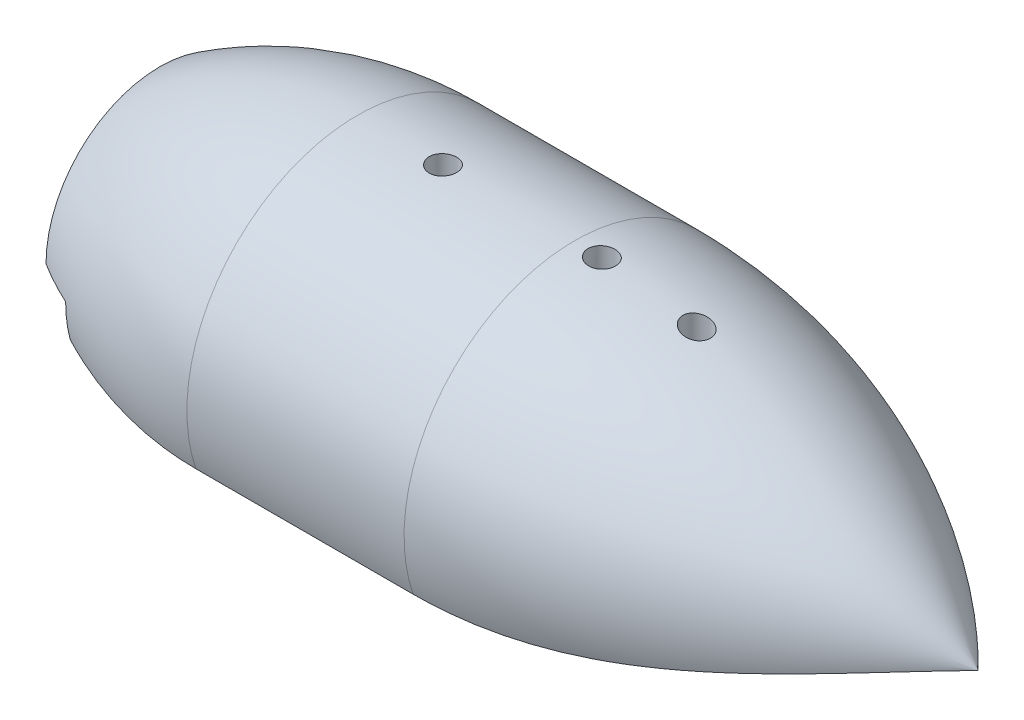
ISO-10303-21;
HEADER;
FILE_DESCRIPTION(('STEP AP214'),'2;1');
FILE_NAME('part.step','',(''),(''),'','','');
FILE_SCHEMA(('AUTOMOTIVE_DESIGN { 1 0 10303 214 1 1 1 1 }'));
ENDSEC;
DATA;
#1=APPLICATION_CONTEXT('core data for automotive mechanical design processes');
#2=APPLICATION_PROTOCOL_DEFINITION('international standard','automotive_design',2000,#1);
#3=PRODUCT_CONTEXT('',#1,'mechanical');
#4=PRODUCT('Part','Part','',(#3));
#5=PRODUCT_RELATED_PRODUCT_CATEGORY('part','',(#4));
#6=PRODUCT_DEFINITION_FORMATION('','',#4);
#7=PRODUCT_DEFINITION_CONTEXT('part definition',#1,'design');
#8=PRODUCT_DEFINITION('design','',#6,#7);
#9=PRODUCT_DEFINITION_SHAPE('','',#8);
#10=(LENGTH_UNIT() NAMED_UNIT(*) SI_UNIT(.MILLI.,.METRE.));
#11=(NAMED_UNIT(*) PLANE_ANGLE_UNIT() SI_UNIT($,.RADIAN.));
#12=(NAMED_UNIT(*) SI_UNIT($,.STERADIAN.) SOLID_ANGLE_UNIT());
#13=UNCERTAINTY_MEASURE_WITH_UNIT(LENGTH_MEASURE(1.E-05),#10,'distance_accuracy_value','');
#14=(GEOMETRIC_REPRESENTATION_CONTEXT(3) GLOBAL_UNCERTAINTY_ASSIGNED_CONTEXT((#13)) GLOBAL_UNIT_ASSIGNED_CONTEXT((#10,
#11,#12)) REPRESENTATION_CONTEXT('',''));
#15=CARTESIAN_POINT('',(0.,0.,0.));
#16=DIRECTION('',(0.,0.,1.));
#17=DIRECTION('',(1.,0.,0.));
#18=AXIS2_PLACEMENT_3D('',#15,#16,#17);
#19=CARTESIAN_POINT('',(42.3417985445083,12.954,-11.8035781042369));
#20=DIRECTION('',(-1.,0.,0.));
#21=DIRECTION('',(0.,0.,1.));
#22=AXIS2_PLACEMENT_3D('',#19,#20,#21);
#23=PLANE('',#22);
#24=CARTESIAN_POINT('',(42.3417985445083,-28.575,0.));
#25=DIRECTION('',(-1.,0.,0.));
#26=DIRECTION('',(0.,0.,1.));
#27=AXIS2_PLACEMENT_3D('',#24,#25,#26);
#28=CIRCLE('',#27,28.575);
#29=CARTESIAN_POINT('',(42.3417985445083,-0.176107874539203,-3.1675781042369));
#30=VERTEX_POINT('',#29);
#31=CARTESIAN_POINT('',(42.3417985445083,-1.88862944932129,-10.2160781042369));
#32=VERTEX_POINT('',#31);
#33=EDGE_CURVE('E917',#30,#32,#28,.T.);
#34=ORIENTED_EDGE('',*,*,#33,.F.);
#35=DIRECTION('',(0.,-1.,0.));
#36=VECTOR('',#35,1.);
#37=CARTESIAN_POINT('',(42.3417985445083,10.16,-3.16757810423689));
#38=LINE('',#37,#36);
#39=CARTESIAN_POINT('',(42.3417985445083,10.16,-3.16757810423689));
#40=VERTEX_POINT('',#39);
#41=EDGE_CURVE('E873',#40,#30,#38,.T.);
#42=ORIENTED_EDGE('',*,*,#41,.F.);
#43=DIRECTION('',(0.,-1.,0.));
#44=VECTOR('',#43,1.);
#45=CARTESIAN_POINT('',(42.3417985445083,29.9803841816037,-3.1675781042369));
#46=LINE('',#45,#44);
#47=CARTESIAN_POINT('',(42.3417985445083,12.954,-3.1675781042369));
#48=VERTEX_POINT('',#47);
#49=EDGE_CURVE('E996',#48,#40,#46,.T.);
#50=ORIENTED_EDGE('',*,*,#49,.F.);
#51=DIRECTION('',(0.,0.,-1.));
#52=VECTOR('',#51,1.);
#53=CARTESIAN_POINT('',(42.3417985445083,12.954,-11.8035781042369));
#54=LINE('',#53,#52);
#55=CARTESIAN_POINT('',(42.3417985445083,12.954,-10.2160781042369));
#56=VERTEX_POINT('',#55);
#57=EDGE_CURVE('E900',#48,#56,#54,.T.);
#58=ORIENTED_EDGE('',*,*,#57,.T.);
#59=DIRECTION('',(0.,-1.,0.));
#60=VECTOR('',#59,1.);
#61=CARTESIAN_POINT('',(42.3417985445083,-8.10299076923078,-10.2160781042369));
#62=LINE('',#61,#60);
#63=EDGE_CURVE('E407',#56,#32,#62,.T.);
#64=ORIENTED_EDGE('',*,*,#63,.T.);
#65=EDGE_LOOP('',(#34,#42,#50,#58,#64));
#66=FACE_BOUND('',#65,.T.);
#67=ADVANCED_FACE('F34',(#66),#23,.T.);
#68=CARTESIAN_POINT('',(42.3417985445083,-28.575,0.));
#69=DIRECTION('',(-1.,0.,0.));
#70=DIRECTION('',(0.,0.,1.));
#71=AXIS2_PLACEMENT_3D('',#68,#69,#70);
#72=CIRCLE('',#71,28.575);
#73=CARTESIAN_POINT('',(42.3417985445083,-1.8943166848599,10.2309218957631));
#74=VERTEX_POINT('',#73);
#75=CARTESIAN_POINT('',(42.3417985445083,-0.177767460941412,3.1824218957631));
#76=VERTEX_POINT('',#75);
#77=EDGE_CURVE('E932',#74,#76,#72,.T.);
#78=ORIENTED_EDGE('',*,*,#77,.F.);
#79=DIRECTION('',(0.,-1.,0.));
#80=VECTOR('',#79,1.);
#81=CARTESIAN_POINT('',(42.3417985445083,12.954,10.2309218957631));
#82=LINE('',#81,#80);
#83=CARTESIAN_POINT('',(42.3417985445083,12.954,10.2309218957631));
#84=VERTEX_POINT('',#83);
#85=EDGE_CURVE('E405',#74,#84,#82,.F.);
#86=ORIENTED_EDGE('',*,*,#85,.T.);
#87=CARTESIAN_POINT('',(42.3417985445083,12.954,3.18242189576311));
#88=VERTEX_POINT('',#87);
#89=EDGE_CURVE('E901',#84,#88,#54,.T.);
#90=ORIENTED_EDGE('',*,*,#89,.T.);
#91=DIRECTION('',(0.,-1.,0.));
#92=VECTOR('',#91,1.);
#93=CARTESIAN_POINT('',(42.3417985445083,29.9803841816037,3.18242189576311));
#94=LINE('',#93,#92);
#95=CARTESIAN_POINT('',(42.3417985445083,10.16,3.1824218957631));
#96=VERTEX_POINT('',#95);
#97=EDGE_CURVE('E966',#96,#88,#94,.F.);
#98=ORIENTED_EDGE('',*,*,#97,.F.);
#99=DIRECTION('',(0.,-1.,0.));
#100=VECTOR('',#99,1.);
#101=CARTESIAN_POINT('',(42.3417985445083,10.16,3.1824218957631));
#102=LINE('',#101,#100);
#103=EDGE_CURVE('E870',#96,#76,#102,.T.);
#104=ORIENTED_EDGE('',*,*,#103,.T.);
#105=EDGE_LOOP('',(#78,#86,#90,#98,#104));
#106=FACE_BOUND('',#105,.T.);
#107=ADVANCED_FACE('F734',(#106),#23,.T.);
#108=CARTESIAN_POINT('',(24.13,0.,0.));
#109=DIRECTION('',(-1.,0.,0.));
#110=DIRECTION('',(0.,0.,1.));
#111=AXIS2_PLACEMENT_3D('',#108,#109,#110);
#112=CYLINDRICAL_SURFACE('',#111,7.9375);
#113=CARTESIAN_POINT('',(10.9132781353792,0.,0.));
#114=DIRECTION('',(1.,0.,0.));
#115=DIRECTION('',(0.,0.,-1.));
#116=AXIS2_PLACEMENT_3D('',#113,#114,#115);
#117=CIRCLE('',#116,7.9375);
#118=CARTESIAN_POINT('',(10.9132781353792,0.,-7.9375));
#119=VERTEX_POINT('',#118);
#120=CARTESIAN_POINT('',(10.9132781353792,-1.00201309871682,-7.874));
#121=VERTEX_POINT('',#120);
#122=EDGE_CURVE('E482',#119,#121,#117,.F.);
#123=ORIENTED_EDGE('',*,*,#122,.T.);
#124=DIRECTION('',(-1.,0.,0.));
#125=VECTOR('',#124,1.);
#126=CARTESIAN_POINT('',(24.13,-1.00201309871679,-7.874));
#127=LINE('',#126,#125);
#128=CARTESIAN_POINT('',(18.9229985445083,-1.00201309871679,-7.874));
#129=VERTEX_POINT('',#128);
#130=EDGE_CURVE('E855',#121,#129,#127,.F.);
#131=ORIENTED_EDGE('',*,*,#130,.T.);
#132=CARTESIAN_POINT('',(18.9229985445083,0.,0.));
#133=DIRECTION('',(1.,0.,0.));
#134=DIRECTION('',(0.,0.,-1.));
#135=AXIS2_PLACEMENT_3D('',#132,#133,#134);
#136=CIRCLE('',#135,7.9375);
#137=CARTESIAN_POINT('',(18.9229985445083,1.00201309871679,-7.874));
#138=VERTEX_POINT('',#137);
#139=EDGE_CURVE('E808',#138,#129,#136,.F.);
#140=ORIENTED_EDGE('',*,*,#139,.F.);
#141=DIRECTION('',(-1.,0.,0.));
#142=VECTOR('',#141,1.);
#143=CARTESIAN_POINT('',(24.13,1.00201309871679,-7.874));
#144=LINE('',#143,#142);
#145=CARTESIAN_POINT('',(16.5099985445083,1.00201309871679,-7.874));
#146=VERTEX_POINT('',#145);
#147=EDGE_CURVE('E851',#138,#146,#144,.T.);
#148=ORIENTED_EDGE('',*,*,#147,.T.);
#149=CARTESIAN_POINT('',(16.5099985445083,1.00201309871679,-7.874));
#150=CARTESIAN_POINT('',(16.4805623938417,1.0018736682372,-7.87401307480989));
#151=CARTESIAN_POINT('',(16.451390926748,1.0052282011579,-7.87359153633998));
#152=CARTESIAN_POINT('',(16.3948993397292,1.01738307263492,-7.87203223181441));
#153=CARTESIAN_POINT('',(16.3675518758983,1.02605419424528,-7.87091144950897));
#154=CARTESIAN_POINT('',(16.30293734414,1.0521291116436,-7.867474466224));
#155=CARTESIAN_POINT('',(16.2666031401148,1.07169678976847,-7.86484921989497));
#156=CARTESIAN_POINT('',(16.1967752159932,1.11585203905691,-7.8587081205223));
#157=CARTESIAN_POINT('',(16.1633221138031,1.14049861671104,-7.85518166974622));
#158=CARTESIAN_POINT('',(16.074983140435,1.21191107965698,-7.84456834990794));
#159=CARTESIAN_POINT('',(16.0225546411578,1.26154945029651,-7.83677777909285));
#160=CARTESIAN_POINT('',(15.9219246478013,1.3647198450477,-7.8194776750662));
#161=CARTESIAN_POINT('',(15.8737356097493,1.41826254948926,-7.80996331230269));
#162=CARTESIAN_POINT('',(15.7800189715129,1.52759368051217,-7.78931731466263));
#163=CARTESIAN_POINT('',(15.7344992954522,1.58338803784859,-7.7781811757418));
#164=CARTESIAN_POINT('',(15.6454872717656,1.69610975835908,-7.75438201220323));
#165=CARTESIAN_POINT('',(15.6019923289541,1.75303552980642,-7.74172102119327));
#166=CARTESIAN_POINT('',(15.4874008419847,1.90655157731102,-7.70575882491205));
#167=CARTESIAN_POINT('',(15.4176308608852,2.00381087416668,-7.68107329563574));
#168=CARTESIAN_POINT('',(15.2810463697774,2.19922926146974,-7.62742364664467));
#169=CARTESIAN_POINT('',(15.2142326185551,2.29738857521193,-7.59845843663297));
#170=CARTESIAN_POINT('',(15.0173110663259,2.59254800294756,-7.50501065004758));
#171=CARTESIAN_POINT('',(14.8908863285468,2.79000316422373,-7.43402801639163));
#172=CARTESIAN_POINT('',(14.6474919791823,3.18304104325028,-7.27441743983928));
#173=CARTESIAN_POINT('',(14.5305060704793,3.37862645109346,-7.18582086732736));
#174=CARTESIAN_POINT('',(14.3071545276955,3.76650188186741,-6.99031281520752));
#175=CARTESIAN_POINT('',(14.2007789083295,3.95879485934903,-6.88341881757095));
#176=CARTESIAN_POINT('',(14.035605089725,4.27266997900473,-6.69099032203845));
#177=CARTESIAN_POINT('',(13.9730995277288,4.39565070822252,-6.61090182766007));
#178=CARTESIAN_POINT('',(13.8545239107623,4.63900831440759,-6.4424717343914));
#179=CARTESIAN_POINT('',(13.7984541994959,4.75938505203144,-6.35412969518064));
#180=CARTESIAN_POINT('',(13.6419011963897,5.11478183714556,-6.07722221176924));
#181=CARTESIAN_POINT('',(13.5524138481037,5.34529622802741,-5.87603248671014));
#182=CARTESIAN_POINT('',(13.4372691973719,5.71454077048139,-5.51282211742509));
#183=CARTESIAN_POINT('',(13.4002971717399,5.85850664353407,-5.35970766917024));
#184=CARTESIAN_POINT('',(13.3619395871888,6.06664060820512,-5.11967704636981));
#185=CARTESIAN_POINT('',(13.3519997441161,6.13492009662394,-5.03766363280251));
#186=CARTESIAN_POINT('',(13.3385280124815,6.26842329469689,-4.87055002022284));
#187=CARTESIAN_POINT('',(13.3350025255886,6.33364388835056,-4.78544682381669));
#188=CARTESIAN_POINT('',(13.3349985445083,6.39713258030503,-4.699));
#189=B_SPLINE_CURVE_WITH_KNOTS('',3,(#149,#150,#151,#152,#153,#154,#155,#156,#157,#158,#159,
#160,#161,#162,#163,#164,#165,#166,#167,#168,#169,#170,#171,#172,#173,#174,#175,#176,#177,#178,
#179,#180,#181,#182,#183,#184,#185,#186,#187,#188),.UNSPECIFIED.,.F.,.F.,(4,2,2,2,2,2,2,2,2,2,2,
2,2,2,2,2,2,2,2,4),(0.,0.0876972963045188,0.173343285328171,0.296691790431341,0.421563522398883,
0.638834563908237,0.856724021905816,1.07523057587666,1.29344888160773,1.65994206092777,
2.02652877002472,2.76055177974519,3.4932790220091,4.22531006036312,4.7035100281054,
5.18173552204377,6.13348655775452,6.77194976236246,7.09322556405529,7.41482183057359),.UNSPECIFIED.);
#190=CARTESIAN_POINT('',(13.3349985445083,6.39713258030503,-4.699));
#191=VERTEX_POINT('',#190);
#192=EDGE_CURVE('E506',#146,#191,#189,.T.);
#193=ORIENTED_EDGE('',*,*,#192,.T.);
#194=CARTESIAN_POINT('',(13.3349985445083,0.,0.));
#195=DIRECTION('',(1.,0.,0.));
#196=DIRECTION('',(0.,0.,-1.));
#197=AXIS2_PLACEMENT_3D('',#194,#195,#196);
#198=CIRCLE('',#197,7.9375);
#199=CARTESIAN_POINT('',(13.3349985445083,7.874,-1.00201309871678));
#200=VERTEX_POINT('',#199);
#201=EDGE_CURVE('E471',#200,#191,#198,.F.);
#202=ORIENTED_EDGE('',*,*,#201,.F.);
#203=DIRECTION('',(-1.,0.,0.));
#204=VECTOR('',#203,1.);
#205=CARTESIAN_POINT('',(24.13,7.874,-1.00201309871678));
#206=LINE('',#205,#204);
#207=CARTESIAN_POINT('',(18.9229985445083,7.874,-1.00201309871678));
#208=VERTEX_POINT('',#207);
#209=EDGE_CURVE('E861',#200,#208,#206,.F.);
#210=ORIENTED_EDGE('',*,*,#209,.T.);
#211=CARTESIAN_POINT('',(18.9229985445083,7.874,1.00201309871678));
#212=VERTEX_POINT('',#211);
#213=EDGE_CURVE('E810',#212,#208,#136,.F.);
#214=ORIENTED_EDGE('',*,*,#213,.F.);
#215=DIRECTION('',(-1.,0.,0.));
#216=VECTOR('',#215,1.);
#217=CARTESIAN_POINT('',(24.13,7.874,1.00201309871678));
#218=LINE('',#217,#216);
#219=CARTESIAN_POINT('',(13.3349985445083,7.874,1.00201309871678));
#220=VERTEX_POINT('',#219);
#221=EDGE_CURVE('E858',#212,#220,#218,.T.);
#222=ORIENTED_EDGE('',*,*,#221,.T.);
#223=CARTESIAN_POINT('',(13.3349985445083,6.39713258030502,4.699));
#224=VERTEX_POINT('',#223);
#225=EDGE_CURVE('E474',#224,#220,#198,.F.);
#226=ORIENTED_EDGE('',*,*,#225,.F.);
#227=CARTESIAN_POINT('',(13.3349985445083,6.39713258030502,4.699));
#228=CARTESIAN_POINT('',(13.3350089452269,6.31655620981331,4.80873725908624));
#229=CARTESIAN_POINT('',(13.3406846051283,6.2331812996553,4.91628571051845));
#230=CARTESIAN_POINT('',(13.3621034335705,6.06169493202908,5.1262062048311));
#231=CARTESIAN_POINT('',(13.3778294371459,5.97359178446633,5.22858675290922));
#232=CARTESIAN_POINT('',(13.4178047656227,5.79452782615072,5.42631768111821));
#233=CARTESIAN_POINT('',(13.4419281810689,5.70362638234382,5.52174802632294));
#234=CARTESIAN_POINT('',(13.4976803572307,5.51833678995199,5.7069281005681));
#235=CARTESIAN_POINT('',(13.5293131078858,5.42394681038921,5.79667477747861));
#236=CARTESIAN_POINT('',(13.6130043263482,5.19410732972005,6.00481628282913));
#237=CARTESIAN_POINT('',(13.6681834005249,5.05725406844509,6.12041420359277));
#238=CARTESIAN_POINT('',(13.7891030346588,4.77901553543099,6.34006031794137));
#239=CARTESIAN_POINT('',(13.8548478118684,4.63762847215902,6.444103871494));
#240=CARTESIAN_POINT('',(13.995848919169,4.34980924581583,6.64182718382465));
#241=CARTESIAN_POINT('',(14.0711993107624,4.20333933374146,6.7353844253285));
#242=CARTESIAN_POINT('',(14.2293454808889,3.90777721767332,6.91105882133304));
#243=CARTESIAN_POINT('',(14.3121369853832,3.75868655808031,6.99318247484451));
#244=CARTESIAN_POINT('',(14.5085530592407,3.41587750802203,7.16815689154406));
#245=CARTESIAN_POINT('',(14.6242564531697,3.2215102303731,7.25743009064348));
#246=CARTESIAN_POINT('',(14.8048385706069,2.92860703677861,7.37823641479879));
#247=CARTESIAN_POINT('',(14.8662972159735,2.83060539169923,7.41636662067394));
#248=CARTESIAN_POINT('',(14.9915123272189,2.63449934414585,7.488272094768));
#249=CARTESIAN_POINT('',(15.0552681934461,2.53639497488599,7.52204848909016));
#250=CARTESIAN_POINT('',(15.1844568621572,2.34155782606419,7.58494336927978));
#251=CARTESIAN_POINT('',(15.2498614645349,2.24482238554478,7.61411154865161));
#252=CARTESIAN_POINT('',(15.383514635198,2.05202487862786,7.66832047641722));
#253=CARTESIAN_POINT('',(15.4517657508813,1.95596350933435,7.69335742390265));
#254=CARTESIAN_POINT('',(15.5916333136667,1.76594777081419,7.73917321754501));
#255=CARTESIAN_POINT('',(15.6632326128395,1.67198567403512,7.75997134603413));
#256=CARTESIAN_POINT('',(15.7750033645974,1.53405047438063,7.78799117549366));
#257=CARTESIAN_POINT('',(15.8129588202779,1.48860635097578,7.79679614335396));
#258=CARTESIAN_POINT('',(15.8909141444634,1.39931230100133,7.81331439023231));
#259=CARTESIAN_POINT('',(15.9309129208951,1.35546154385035,7.82102824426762));
#260=CARTESIAN_POINT('',(16.0043140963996,1.28028378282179,7.8336377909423));
#261=CARTESIAN_POINT('',(16.0371049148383,1.24840434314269,7.8387727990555));
#262=CARTESIAN_POINT('',(16.1052402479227,1.18714378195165,7.84828333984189));
#263=CARTESIAN_POINT('',(16.1405897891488,1.15776783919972,7.85265731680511));
#264=CARTESIAN_POINT('',(16.2067638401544,1.10937898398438,7.8596214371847));
#265=CARTESIAN_POINT('',(16.2369210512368,1.08949723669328,7.86239286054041));
#266=CARTESIAN_POINT('',(16.2997068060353,1.05434623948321,7.86718311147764));
#267=CARTESIAN_POINT('',(16.3323146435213,1.03904281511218,7.86920754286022));
#268=CARTESIAN_POINT('',(16.3891309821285,1.01933880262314,7.87178031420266));
#269=CARTESIAN_POINT('',(16.4126371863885,1.01301213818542,7.87259439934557));
#270=CARTESIAN_POINT('',(16.4607126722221,1.00427739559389,7.87371207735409));
#271=CARTESIAN_POINT('',(16.4852924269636,1.00192747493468,7.87400809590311));
#272=CARTESIAN_POINT('',(16.5099985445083,1.00201309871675,7.874));
#273=B_SPLINE_CURVE_WITH_KNOTS('',3,(#227,#228,#229,#230,#231,#232,#233,#234,#235,#236,#237,
#238,#239,#240,#241,#242,#243,#244,#245,#246,#247,#248,#249,#250,#251,#252,#253,#254,#255,#256,
#257,#258,#259,#260,#261,#262,#263,#264,#265,#266,#267,#268,#269,#270,#271,#272),.UNSPECIFIED.,
.F.,.F.,(4,2,2,2,2,2,2,2,2,2,2,2,2,2,2,2,2,2,2,2,2,2,4),(0.,0.408109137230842,0.815523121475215,
1.21707430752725,1.61883932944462,2.18034368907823,2.74207272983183,3.3097994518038,
3.87720214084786,4.60575189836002,4.97107870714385,5.33631083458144,5.69728677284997,
6.05859299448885,6.41821703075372,6.59775998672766,6.7772079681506,6.91518883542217,
7.05344853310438,7.16190292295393,7.26952631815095,7.34227431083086,7.41607728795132),.UNSPECIFIED.);
#274=CARTESIAN_POINT('',(16.5099985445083,1.00201309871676,7.874));
#275=VERTEX_POINT('',#274);
#276=EDGE_CURVE('E499',#224,#275,#273,.T.);
#277=ORIENTED_EDGE('',*,*,#276,.T.);
#278=DIRECTION('',(-1.,0.,0.));
#279=VECTOR('',#278,1.);
#280=CARTESIAN_POINT('',(24.13,1.00201309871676,7.874));
#281=LINE('',#280,#279);
#282=CARTESIAN_POINT('',(18.9229985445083,1.00201309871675,7.874));
#283=VERTEX_POINT('',#282);
#284=EDGE_CURVE('E829',#275,#283,#281,.F.);
#285=ORIENTED_EDGE('',*,*,#284,.T.);
#286=CARTESIAN_POINT('',(18.9229985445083,-1.00201309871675,7.874));
#287=VERTEX_POINT('',#286);
#288=EDGE_CURVE('E396',#287,#283,#136,.F.);
#289=ORIENTED_EDGE('',*,*,#288,.F.);
#290=DIRECTION('',(-1.,0.,0.));
#291=VECTOR('',#290,1.);
#292=CARTESIAN_POINT('',(24.13,-1.00201309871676,7.874));
#293=LINE('',#292,#291);
#294=CARTESIAN_POINT('',(10.9132781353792,-1.00201309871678,7.874));
#295=VERTEX_POINT('',#294);
#296=EDGE_CURVE('E826',#287,#295,#293,.T.);
#297=ORIENTED_EDGE('',*,*,#296,.T.);
#298=CARTESIAN_POINT('',(10.9132781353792,0.,0.));
#299=DIRECTION('',(1.,0.,0.));
#300=DIRECTION('',(0.,0.,-1.));
#301=AXIS2_PLACEMENT_3D('',#298,#299,#300);
#302=CIRCLE('',#301,7.9375);
#303=CARTESIAN_POINT('',(10.9132781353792,0.,7.9375));
#304=VERTEX_POINT('',#303);
#305=EDGE_CURVE('E479',#295,#304,#302,.F.);
#306=ORIENTED_EDGE('',*,*,#305,.T.);
#307=DIRECTION('',(-1.,0.,0.));
#308=VECTOR('',#307,1.);
#309=CARTESIAN_POINT('',(24.13,0.,7.9375));
#310=LINE('',#309,#308);
#311=CARTESIAN_POINT('',(0.,0.,7.9375));
#312=VERTEX_POINT('',#311);
#313=EDGE_CURVE('E841',#304,#312,#310,.T.);
#314=ORIENTED_EDGE('',*,*,#313,.T.);
#315=CARTESIAN_POINT('',(0.,0.,0.));
#316=DIRECTION('',(-1.,0.,0.));
#317=DIRECTION('',(0.,0.,1.));
#318=AXIS2_PLACEMENT_3D('',#315,#316,#317);
#319=CIRCLE('',#318,7.9375);
#320=CARTESIAN_POINT('',(0.,0.,-7.9375));
#321=VERTEX_POINT('',#320);
#322=EDGE_CURVE('E391',#312,#321,#319,.T.);
#323=ORIENTED_EDGE('',*,*,#322,.T.);
#324=DIRECTION('',(-1.,0.,0.));
#325=VECTOR('',#324,1.);
#326=CARTESIAN_POINT('',(24.13,0.,-7.9375));
#327=LINE('',#326,#325);
#328=EDGE_CURVE('E837',#321,#119,#327,.F.);
#329=ORIENTED_EDGE('',*,*,#328,.T.);
#330=EDGE_LOOP('',(#123,#131,#140,#148,#193,#202,#210,#214,#222,#226,#277,#285,#289,#297,#306,
#314,#323,#329));
#331=FACE_BOUND('',#330,.T.);
#332=ADVANCED_FACE('F512',(#331),#112,.F.);
#333=CARTESIAN_POINT('',(87.63,0.,0.));
#334=DIRECTION('',(-1.,0.,0.));
#335=DIRECTION('',(0.,0.,1.));
#336=AXIS2_PLACEMENT_3D('',#333,#334,#335);
#337=CYLINDRICAL_SURFACE('',#336,18.288);
#338=CARTESIAN_POINT('',(28.8671172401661,18.288,0.));
#339=CARTESIAN_POINT('',(28.8675370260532,18.2879992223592,-0.082606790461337));
#340=CARTESIAN_POINT('',(28.8749213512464,18.2874343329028,-0.165234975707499));
#341=CARTESIAN_POINT('',(28.9034367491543,18.2852379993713,-0.328135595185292));
#342=CARTESIAN_POINT('',(28.9245834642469,18.2836053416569,-0.408405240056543));
#343=CARTESIAN_POINT('',(28.9800086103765,18.2794607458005,-0.564206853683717));
#344=CARTESIAN_POINT('',(29.0142796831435,18.2769493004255,-0.639741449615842));
#345=CARTESIAN_POINT('',(29.0949680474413,18.2713314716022,-0.783968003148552));
#346=CARTESIAN_POINT('',(29.1413827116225,18.2682252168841,-0.852661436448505));
#347=CARTESIAN_POINT('',(29.2451607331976,18.2617604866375,-0.9814379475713));
#348=CARTESIAN_POINT('',(29.3025470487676,18.2584014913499,-1.04150249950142));
#349=CARTESIAN_POINT('',(29.4265899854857,18.2518164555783,-1.15115832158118));
#350=CARTESIAN_POINT('',(29.493247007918,18.2485904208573,-1.20074913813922));
#351=CARTESIAN_POINT('',(29.6340473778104,18.2426326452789,-1.28810906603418));
#352=CARTESIAN_POINT('',(29.7082004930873,18.2399015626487,-1.32586248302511));
#353=CARTESIAN_POINT('',(29.8618188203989,18.235250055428,-1.38837598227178));
#354=CARTESIAN_POINT('',(29.9412839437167,18.2333296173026,-1.41313628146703));
#355=CARTESIAN_POINT('',(30.1030854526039,18.2305220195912,-1.44890840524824));
#356=CARTESIAN_POINT('',(30.185415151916,18.2296326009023,-1.4599502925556));
#357=CARTESIAN_POINT('',(30.350763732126,18.2289809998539,-1.46806444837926));
#358=CARTESIAN_POINT('',(30.4337826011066,18.2292187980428,-1.46513695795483));
#359=CARTESIAN_POINT('',(30.5979530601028,18.2307925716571,-1.44542088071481));
#360=CARTESIAN_POINT('',(30.6791084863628,18.2321260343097,-1.42866400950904));
#361=CARTESIAN_POINT('',(30.8374513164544,18.2357364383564,-1.38181329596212));
#362=CARTESIAN_POINT('',(30.9146386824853,18.2380133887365,-1.35171932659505));
#363=CARTESIAN_POINT('',(31.0629613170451,18.2432563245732,-1.27900986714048));
#364=CARTESIAN_POINT('',(31.1340891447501,18.2462231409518,-1.23637926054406));
#365=CARTESIAN_POINT('',(31.2681920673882,18.2525092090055,-1.13981788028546));
#366=CARTESIAN_POINT('',(31.3311670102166,18.255828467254,-1.08588689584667));
#367=CARTESIAN_POINT('',(31.4473617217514,18.2624548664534,-0.968074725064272));
#368=CARTESIAN_POINT('',(31.5005535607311,18.2657619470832,-0.904165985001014));
#369=CARTESIAN_POINT('',(31.5954574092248,18.2719801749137,-0.768310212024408));
#370=CARTESIAN_POINT('',(31.6371694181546,18.2748913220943,-0.696363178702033));
#371=CARTESIAN_POINT('',(31.7079243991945,18.2799874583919,-0.546461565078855));
#372=CARTESIAN_POINT('',(31.7369671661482,18.2821724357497,-0.468506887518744));
#373=CARTESIAN_POINT('',(31.7815446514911,18.2855668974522,-0.308806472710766));
#374=CARTESIAN_POINT('',(31.7970796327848,18.2867764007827,-0.227060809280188));
#375=CARTESIAN_POINT('',(31.8141668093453,18.2880786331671,-0.0623442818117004));
#376=CARTESIAN_POINT('',(31.8157580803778,18.2881744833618,0.0206225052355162));
#377=CARTESIAN_POINT('',(31.8050143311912,18.2872439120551,0.185642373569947));
#378=CARTESIAN_POINT('',(31.7926794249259,18.2862174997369,0.267695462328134));
#379=CARTESIAN_POINT('',(31.7544650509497,18.2831569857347,0.428455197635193));
#380=CARTESIAN_POINT('',(31.728602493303,18.281124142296,0.507165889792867));
#381=CARTESIAN_POINT('',(31.6640841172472,18.276276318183,0.659130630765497));
#382=CARTESIAN_POINT('',(31.625428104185,18.2734613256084,0.73238459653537));
#383=CARTESIAN_POINT('',(31.5363181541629,18.2673543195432,0.87153810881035));
#384=CARTESIAN_POINT('',(31.4858377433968,18.2640612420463,0.937420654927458));
#385=CARTESIAN_POINT('',(31.3745512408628,18.2573697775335,1.05979047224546));
#386=CARTESIAN_POINT('',(31.3137449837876,18.2539713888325,1.11627759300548));
#387=CARTESIAN_POINT('',(31.1833657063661,18.2474413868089,1.21838328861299));
#388=CARTESIAN_POINT('',(31.1137730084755,18.2443103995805,1.26397678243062));
#389=CARTESIAN_POINT('',(30.967895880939,18.2386765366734,1.34282973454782));
#390=CARTESIAN_POINT('',(30.8916115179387,18.23617365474,1.3760893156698));
#391=CARTESIAN_POINT('',(30.7346138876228,18.2320817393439,1.42928490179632));
#392=CARTESIAN_POINT('',(30.6539063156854,18.2304915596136,1.44923762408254));
#393=CARTESIAN_POINT('',(30.4902733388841,18.2284004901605,1.47530789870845));
#394=CARTESIAN_POINT('',(30.4073479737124,18.227899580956,1.48142569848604));
#395=CARTESIAN_POINT('',(30.2418870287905,18.2280436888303,1.47965118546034));
#396=CARTESIAN_POINT('',(30.159351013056,18.2286854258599,1.47179897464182));
#397=CARTESIAN_POINT('',(29.9967739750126,18.2310358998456,1.44238991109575));
#398=CARTESIAN_POINT('',(29.9167329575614,18.232744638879,1.42083303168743));
#399=CARTESIAN_POINT('',(29.7614097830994,18.2370366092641,1.36463492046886));
#400=CARTESIAN_POINT('',(29.6861276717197,18.2396198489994,1.32999356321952));
#401=CARTESIAN_POINT('',(29.5424410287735,18.2453709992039,1.24861435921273));
#402=CARTESIAN_POINT('',(29.4740363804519,18.2485388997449,1.20187671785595));
#403=CARTESIAN_POINT('',(29.3458402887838,18.255114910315,1.09747851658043));
#404=CARTESIAN_POINT('',(29.2860731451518,18.2585236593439,1.03978815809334));
#405=CARTESIAN_POINT('',(29.1770469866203,18.2651931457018,0.915176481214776));
#406=CARTESIAN_POINT('',(29.127790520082,18.2684538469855,0.848252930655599));
#407=CARTESIAN_POINT('',(29.0411239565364,18.2744675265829,0.706955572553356));
#408=CARTESIAN_POINT('',(29.0037346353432,18.2772196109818,0.632568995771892));
#409=CARTESIAN_POINT('',(28.9420246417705,18.2818979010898,0.478602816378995));
#410=CARTESIAN_POINT('',(28.917688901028,18.2838250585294,0.399029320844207));
#411=CARTESIAN_POINT('',(28.8889516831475,18.2861429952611,0.26582011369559));
#412=CARTESIAN_POINT('',(28.8805390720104,18.2868364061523,0.213020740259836));
#413=CARTESIAN_POINT('',(28.8694861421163,18.2877651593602,0.106817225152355));
#414=CARTESIAN_POINT('',(28.8668458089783,18.2880005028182,0.0534130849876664));
#415=CARTESIAN_POINT('',(28.8671172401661,18.288,0.));
#416=B_SPLINE_CURVE_WITH_KNOTS('',3,(#338,#339,#340,#341,#342,#343,#344,#345,#346,#347,#348,
#349,#350,#351,#352,#353,#354,#355,#356,#357,#358,#359,#360,#361,#362,#363,#364,#365,#366,#367,
#368,#369,#370,#371,#372,#373,#374,#375,#376,#377,#378,#379,#380,#381,#382,#383,#384,#385,#386,
#387,#388,#389,#390,#391,#392,#393,#394,#395,#396,#397,#398,#399,#400,#401,#402,#403,#404,#405,
#406,#407,#408,#409,#410,#411,#412,#413,#414,#415),.UNSPECIFIED.,.T.,.F.,(4,2,2,2,2,2,2,2,2,2,2,
2,2,2,2,2,2,2,2,2,2,2,2,2,2,2,2,2,2,2,2,2,2,2,2,2,2,2,4),(0.,0.247628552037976,
0.495539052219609,0.743310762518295,0.991028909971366,1.23927119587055,1.4875242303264,
1.73610502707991,1.98468167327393,2.23271261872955,2.48073928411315,2.72819871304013,
2.9756604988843,3.22342190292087,3.47118792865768,3.71965067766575,3.9681134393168,
4.21658022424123,4.46504217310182,4.71280761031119,4.96057102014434,5.20802545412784,
5.45548365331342,5.70350127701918,5.95152287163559,6.20011011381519,6.44869488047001,
6.69696676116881,6.94523420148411,7.19279012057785,7.44034652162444,7.68790529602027,
7.93545986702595,8.18369785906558,8.43199596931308,8.68072640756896,8.92916910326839,
9.08928472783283,9.24939995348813),.UNSPECIFIED.);
#417=CARTESIAN_POINT('',(28.8671172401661,18.288,0.));
#418=VERTEX_POINT('',#417);
#419=EDGE_CURVE('E1008',#418,#418,#416,.T.);
#420=ORIENTED_EDGE('',*,*,#419,.T.);
#421=EDGE_LOOP('',(#420));
#422=FACE_BOUND('',#421,.T.);
#423=CARTESIAN_POINT('',(21.1848567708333,0.,0.));
#424=DIRECTION('',(-1.,0.,0.));
#425=DIRECTION('',(0.,0.,1.));
#426=AXIS2_PLACEMENT_3D('',#423,#424,#425);
#427=CIRCLE('',#426,18.288);
#428=CARTESIAN_POINT('',(21.1848567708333,-5.85215999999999,17.3263720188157));
#429=VERTEX_POINT('',#428);
#430=CARTESIAN_POINT('',(21.1848567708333,-5.85215999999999,-17.3263720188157));
#431=VERTEX_POINT('',#430);
#432=EDGE_CURVE('E393',#429,#431,#427,.T.);
#433=ORIENTED_EDGE('',*,*,#432,.F.);
#434=DIRECTION('',(-1.,0.,0.));
#435=VECTOR('',#434,1.);
#436=CARTESIAN_POINT('',(43.815,-5.85216,17.3263720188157));
#437=LINE('',#436,#435);
#438=CARTESIAN_POINT('',(44.45,-5.85216000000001,17.3263720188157));
#439=VERTEX_POINT('',#438);
#440=EDGE_CURVE('E1462',#429,#439,#437,.F.);
#441=ORIENTED_EDGE('',*,*,#440,.T.);
#442=CARTESIAN_POINT('',(44.45,0.,0.));
#443=DIRECTION('',(-1.,0.,0.));
#444=DIRECTION('',(0.,0.,1.));
#445=AXIS2_PLACEMENT_3D('',#442,#443,#444);
#446=CIRCLE('',#445,18.288);
#447=CARTESIAN_POINT('',(44.45,-5.85215999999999,-17.3263720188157));
#448=VERTEX_POINT('',#447);
#449=EDGE_CURVE('E386',#439,#448,#446,.T.);
#450=ORIENTED_EDGE('',*,*,#449,.T.);
#451=DIRECTION('',(-1.,0.,0.));
#452=VECTOR('',#451,1.);
#453=CARTESIAN_POINT('',(43.815,-5.85216,-17.3263720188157));
#454=LINE('',#453,#452);
#455=EDGE_CURVE('E712',#448,#431,#454,.T.);
#456=ORIENTED_EDGE('',*,*,#455,.T.);
#457=EDGE_LOOP('',(#433,#441,#450,#456));
#458=FACE_BOUND('',#457,.T.);
#459=ADVANCED_FACE('F36',(#422,#458),#337,.T.);
#460=CARTESIAN_POINT('',(21.1848567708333,0.,0.));
#461=DIRECTION('',(-1.,0.,0.));
#462=DIRECTION('',(0.,0.,1.));
#463=AXIS2_PLACEMENT_3D('',#460,#461,#462);
#464=DEGENERATE_TOROIDAL_SURFACE('',#463,21.5708724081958,39.8588724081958,.F.);
#465=ORIENTED_EDGE('',*,*,#432,.T.);
#466=CARTESIAN_POINT('',(21.1850567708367,-5.85215999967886,-17.3263720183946));
#467=CARTESIAN_POINT('',(20.643243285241,-5.85219525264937,-17.326367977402));
#468=CARTESIAN_POINT('',(20.1014324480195,-5.84509423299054,-17.3171038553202));
#469=CARTESIAN_POINT('',(19.0188201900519,-5.81686102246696,-17.2800099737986));
#470=CARTESIAN_POINT('',(18.4780187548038,-5.79572903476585,-17.252180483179));
#471=CARTESIAN_POINT('',(17.3984921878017,-5.73967932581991,-17.1779157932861));
#472=CARTESIAN_POINT('',(16.8597667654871,-5.70476361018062,-17.1314833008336));
#473=CARTESIAN_POINT('',(15.7852910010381,-5.62161962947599,-17.01992438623));
#474=CARTESIAN_POINT('',(15.2495406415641,-5.57339144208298,-16.9547980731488));
#475=CARTESIAN_POINT('',(14.1942211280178,-5.46551107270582,-16.807447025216));
#476=CARTESIAN_POINT('',(13.6745628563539,-5.40614657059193,-16.7256491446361));
#477=CARTESIAN_POINT('',(12.6398000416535,-5.27605979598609,-16.5439564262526));
#478=CARTESIAN_POINT('',(12.124695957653,-5.20533639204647,-16.4440597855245));
#479=CARTESIAN_POINT('',(11.1000417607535,-5.05344425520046,-16.2260496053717));
#480=CARTESIAN_POINT('',(10.5904903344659,-4.97227805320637,-16.1079404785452));
#481=CARTESIAN_POINT('',(9.57760391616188,-4.80051327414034,-15.8533266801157));
#482=CARTESIAN_POINT('',(9.07426922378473,-4.70991424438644,-15.7168211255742));
#483=CARTESIAN_POINT('',(7.82834827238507,-4.47374475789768,-15.3534225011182));
#484=CARTESIAN_POINT('',(7.09001451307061,-4.32307582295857,-15.1151233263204));
#485=CARTESIAN_POINT('',(5.63149009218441,-4.00755649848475,-14.5966898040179));
#486=CARTESIAN_POINT('',(4.91129637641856,-3.8427085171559,-14.3165625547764));
#487=CARTESIAN_POINT('',(3.47859410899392,-3.5005631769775,-13.7086466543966));
#488=CARTESIAN_POINT('',(2.76644244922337,-3.32309806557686,-13.3801076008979));
#489=CARTESIAN_POINT('',(1.71562197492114,-3.0536564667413,-12.8541992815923));
#490=CARTESIAN_POINT('',(1.36818726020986,-2.96328499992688,-12.6733435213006));
#491=CARTESIAN_POINT('',(0.679385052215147,-2.78218454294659,-12.300577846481));
#492=CARTESIAN_POINT('',(0.33801768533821,-2.69145554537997,-12.1086677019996));
#493=CARTESIAN_POINT('',(-0.000199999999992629,-2.60090645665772,-11.9112169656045));
#494=B_SPLINE_CURVE_WITH_KNOTS('',3,(#466,#467,#468,#469,#470,#471,#472,#473,#474,#475,#476,
#477,#478,#479,#480,#481,#482,#483,#484,#485,#486,#487,#488,#489,#490,#491,#492,#493),
.UNSPECIFIED.,.F.,.F.,(4,2,2,2,2,2,2,2,2,2,2,2,2,4),(0.,1.62531046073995,3.2505973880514,
4.87564791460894,6.50068895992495,8.08842372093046,9.6763167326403,11.2638256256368,
12.8514107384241,15.2208624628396,17.5899125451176,20.0005535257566,21.2063182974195,
22.4121081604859),.UNSPECIFIED.);
#495=CARTESIAN_POINT('',(4.572,-3.76102436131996,-14.1702942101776));
#496=VERTEX_POINT('',#495);
#497=EDGE_CURVE('E705',#431,#496,#494,.T.);
#498=ORIENTED_EDGE('',*,*,#497,.T.);
#499=CARTESIAN_POINT('',(4.572,0.,0.));
#500=DIRECTION('',(1.,0.,0.));
#501=DIRECTION('',(0.,1.,0.));
#502=AXIS2_PLACEMENT_3D('',#499,#500,#501);
#503=CIRCLE('',#502,14.6609188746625);
#504=CARTESIAN_POINT('',(4.572,0.,-14.6609188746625));
#505=VERTEX_POINT('',#504);
#506=EDGE_CURVE('E1052',#496,#505,#503,.T.);
#507=ORIENTED_EDGE('',*,*,#506,.T.);
#508=CARTESIAN_POINT('',(21.1848567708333,0.,21.5708724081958));
#509=DIRECTION('',(0.,1.,0.));
#510=DIRECTION('',(0.,0.,1.));
#511=AXIS2_PLACEMENT_3D('',#508,#509,#510);
#512=CIRCLE('',#511,39.8588724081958);
#513=CARTESIAN_POINT('',(0.,0.,-12.192));
#514=VERTEX_POINT('',#513);
#515=EDGE_CURVE('E1072',#505,#514,#512,.T.);
#516=ORIENTED_EDGE('',*,*,#515,.T.);
#517=CARTESIAN_POINT('',(0.,0.,0.));
#518=DIRECTION('',(-1.,0.,0.));
#519=DIRECTION('',(0.,0.,1.));
#520=AXIS2_PLACEMENT_3D('',#517,#518,#519);
#521=CIRCLE('',#520,12.192);
#522=CARTESIAN_POINT('',(0.,0.,12.192));
#523=VERTEX_POINT('',#522);
#524=EDGE_CURVE('E402',#523,#514,#521,.T.);
#525=ORIENTED_EDGE('',*,*,#524,.F.);
#526=CARTESIAN_POINT('',(21.1848567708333,0.,-21.5708724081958));
#527=DIRECTION('',(0.,1.,0.));
#528=DIRECTION('',(0.,0.,1.));
#529=AXIS2_PLACEMENT_3D('',#526,#527,#528);
#530=CIRCLE('',#529,39.8588724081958);
#531=CARTESIAN_POINT('',(4.572,0.,14.6609188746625));
#532=VERTEX_POINT('',#531);
#533=EDGE_CURVE('E1069',#523,#532,#530,.T.);
#534=ORIENTED_EDGE('',*,*,#533,.T.);
#535=CARTESIAN_POINT('',(4.572,-3.76102436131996,14.1702942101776));
#536=VERTEX_POINT('',#535);
#537=EDGE_CURVE('E1055',#532,#536,#503,.T.);
#538=ORIENTED_EDGE('',*,*,#537,.T.);
#539=CARTESIAN_POINT('',(-0.000200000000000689,-2.60090645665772,11.9112169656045));
#540=CARTESIAN_POINT('',(0.466508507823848,-2.72586694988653,12.1836915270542));
#541=CARTESIAN_POINT('',(0.939258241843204,-2.85116327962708,12.4456212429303));
#542=CARTESIAN_POINT('',(1.8961113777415,-3.10055272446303,12.9484374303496));
#543=CARTESIAN_POINT('',(2.38021441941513,-3.22464587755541,13.1893245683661));
#544=CARTESIAN_POINT('',(3.35914567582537,-3.4697799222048,13.6501525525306));
#545=CARTESIAN_POINT('',(3.85397542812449,-3.59082037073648,13.8700903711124));
#546=CARTESIAN_POINT('',(4.85347751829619,-3.82806806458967,14.2890829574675));
#547=CARTESIAN_POINT('',(5.35814983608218,-3.9442753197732,14.4881377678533));
#548=CARTESIAN_POINT('',(6.8617230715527,-4.27776953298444,15.0452682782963));
#549=CARTESIAN_POINT('',(7.87369651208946,-4.48595327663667,15.3743057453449));
#550=CARTESIAN_POINT('',(9.412567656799,-4.77121044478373,15.8094930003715));
#551=CARTESIAN_POINT('',(9.92899458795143,-4.86179085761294,15.9448241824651));
#552=CARTESIAN_POINT('',(10.9681709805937,-5.03281980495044,16.1962815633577));
#553=CARTESIAN_POINT('',(11.4909200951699,-5.11326889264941,16.3124088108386));
#554=CARTESIAN_POINT('',(12.7591090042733,-5.29389371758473,16.5696930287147));
#555=CARTESIAN_POINT('',(13.5072916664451,-5.38848023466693,16.7013580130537));
#556=CARTESIAN_POINT('',(15.0119350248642,-5.55273902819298,16.9270686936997));
#557=CARTESIAN_POINT('',(15.7683944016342,-5.62241521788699,17.0211202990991));
#558=CARTESIAN_POINT('',(16.9137236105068,-5.70737281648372,17.1348895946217));
#559=CARTESIAN_POINT('',(17.3005552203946,-5.73255859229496,17.1684236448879));
#560=CARTESIAN_POINT('',(18.0753380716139,-5.77586193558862,17.2258887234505));
#561=CARTESIAN_POINT('',(18.4632893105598,-5.79397951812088,17.249819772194));
#562=CARTESIAN_POINT('',(19.2400222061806,-5.82301932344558,17.2881058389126));
#563=CARTESIAN_POINT('',(19.6288040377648,-5.83393984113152,17.3024585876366));
#564=CARTESIAN_POINT('',(20.4067421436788,-5.84851517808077,17.3215916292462));
#565=CARTESIAN_POINT('',(20.7958984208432,-5.85216994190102,17.3263718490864));
#566=CARTESIAN_POINT('',(21.1850567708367,-5.85215999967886,17.3263720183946));
#567=B_SPLINE_CURVE_WITH_KNOTS('',3,(#539,#540,#541,#542,#543,#544,#545,#546,#547,#548,#549,
#550,#551,#552,#553,#554,#555,#556,#557,#558,#559,#560,#561,#562,#563,#564,#565,#566),
.UNSPECIFIED.,.F.,.F.,(4,2,2,2,2,2,2,2,2,2,2,2,2,4),(0.,1.66388590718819,3.32771909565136,
4.99179237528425,6.6558622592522,9.90429269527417,11.5284137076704,13.1524460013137,
15.4476971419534,17.7425875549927,18.9097292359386,20.07686843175,21.2442840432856,
22.4117085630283),.UNSPECIFIED.);
#568=EDGE_CURVE('E613',#536,#429,#567,.T.);
#569=ORIENTED_EDGE('',*,*,#568,.T.);
#570=EDGE_LOOP('',(#465,#498,#507,#516,#525,#534,#538,#569));
#571=FACE_BOUND('',#570,.T.);
#572=ADVANCED_FACE('F714',(#571),#464,.F.);
#573=CARTESIAN_POINT('',(0.,0.,0.));
#574=DIRECTION('',(1.,0.,0.));
#575=DIRECTION('',(0.,0.,-1.));
#576=AXIS2_PLACEMENT_3D('',#573,#574,#575);
#577=PLANE('',#576);
#578=ORIENTED_EDGE('',*,*,#524,.T.);
#579=DIRECTION('',(0.,0.,1.));
#580=VECTOR('',#579,1.);
#581=CARTESIAN_POINT('',(0.,0.,0.));
#582=LINE('',#581,#580);
#583=EDGE_CURVE('E478',#514,#321,#582,.T.);
#584=ORIENTED_EDGE('',*,*,#583,.T.);
#585=ORIENTED_EDGE('',*,*,#322,.F.);
#586=EDGE_CURVE('E475',#312,#523,#582,.T.);
#587=ORIENTED_EDGE('',*,*,#586,.T.);
#588=EDGE_LOOP('',(#578,#584,#585,#587));
#589=FACE_BOUND('',#588,.T.);
#590=ADVANCED_FACE('F718',(#589),#577,.F.);
#591=CARTESIAN_POINT('',(44.45,0.,0.));
#592=DIRECTION('',(-1.,0.,0.));
#593=DIRECTION('',(0.,0.,1.));
#594=AXIS2_PLACEMENT_3D('',#591,#592,#593);
#595=DEGENERATE_TOROIDAL_SURFACE('',#594,41.8524678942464,60.1404678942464,.F.);
#596=CARTESIAN_POINT('',(87.6302,-1.28409690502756E-06,0.00856657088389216));
#597=CARTESIAN_POINT('',(87.6278861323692,-1.9996392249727E-06,0.0109533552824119));
#598=CARTESIAN_POINT('',(87.6255720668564,-3.01416285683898E-06,0.0133399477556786));
#599=CARTESIAN_POINT('',(87.6140007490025,-9.58097351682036E-06,0.0252719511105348));
#600=CARTESIAN_POINT('',(87.6047405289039,-1.96158373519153E-05,0.034814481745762));
#601=CARTESIAN_POINT('',(87.5584235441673,-9.36516009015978E-05,0.0825118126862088));
#602=CARTESIAN_POINT('',(87.5213193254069,-0.000229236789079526,0.120620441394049));
#603=CARTESIAN_POINT('',(87.3355416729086,-0.00128599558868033,0.310919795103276));
#604=CARTESIAN_POINT('',(87.186111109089,-0.00334366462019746,0.462366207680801));
#605=CARTESIAN_POINT('',(86.7352835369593,-0.0130430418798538,0.914393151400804));
#606=CARTESIAN_POINT('',(86.4314864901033,-0.0242124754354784,1.21251920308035));
#607=CARTESIAN_POINT('',(85.8176543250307,-0.0553404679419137,1.80187505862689));
#608=CARTESIAN_POINT('',(85.5076182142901,-0.0753004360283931,2.09310374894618));
#609=CARTESIAN_POINT('',(84.5644187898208,-0.147745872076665,2.9595990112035));
#610=CARTESIAN_POINT('',(83.9219866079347,-0.212699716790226,3.52383685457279));
#611=CARTESIAN_POINT('',(82.6139020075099,-0.370633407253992,4.62077477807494));
#612=CARTESIAN_POINT('',(81.9482435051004,-0.463620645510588,5.15346649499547));
#613=CARTESIAN_POINT('',(80.5941789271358,-0.672703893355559,6.18631577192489));
#614=CARTESIAN_POINT('',(79.9057421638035,-0.788832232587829,6.68642650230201));
#615=CARTESIAN_POINT('',(78.5082569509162,-1.03914127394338,7.65218865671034));
#616=CARTESIAN_POINT('',(77.7992071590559,-1.17332315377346,8.11783782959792));
#617=CARTESIAN_POINT('',(76.4246432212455,-1.44258560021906,8.97476514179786));
#618=CARTESIAN_POINT('',(75.7607424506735,-1.57656199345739,9.36898614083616));
#619=CARTESIAN_POINT('',(74.4177065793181,-1.85199280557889,10.1279065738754));
#620=CARTESIAN_POINT('',(73.7385698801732,-1.9934480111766,10.4926028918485));
#621=CARTESIAN_POINT('',(72.3658212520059,-2.28047654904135,11.1924875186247));
#622=CARTESIAN_POINT('',(71.6722044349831,-2.4260512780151,11.5276656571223));
#623=CARTESIAN_POINT('',(70.2715585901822,-2.71805570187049,12.1685279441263));
#624=CARTESIAN_POINT('',(69.5645279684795,-2.86448549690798,12.4742085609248));
#625=CARTESIAN_POINT('',(68.1368667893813,-3.15537027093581,13.0567697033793));
#626=CARTESIAN_POINT('',(67.4162153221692,-3.29982150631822,13.3336008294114));
#627=CARTESIAN_POINT('',(65.9635103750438,-3.5836024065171,13.8581962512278));
#628=CARTESIAN_POINT('',(65.2314581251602,-3.72293261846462,14.10596365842));
#629=CARTESIAN_POINT('',(63.7569092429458,-3.99381019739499,14.5728714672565));
#630=CARTESIAN_POINT('',(63.0144132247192,-4.12535801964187,14.7920135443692));
#631=CARTESIAN_POINT('',(61.519964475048,-4.37823496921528,15.2021456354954));
#632=CARTESIAN_POINT('',(60.7680117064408,-4.49956405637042,15.3931355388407));
#633=CARTESIAN_POINT('',(59.2275569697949,-4.73408631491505,15.7540312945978));
#634=CARTESIAN_POINT('',(58.4387368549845,-4.84680813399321,15.92288688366));
#635=CARTESIAN_POINT('',(56.8533377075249,-5.05671746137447,16.2313221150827));
#636=CARTESIAN_POINT('',(56.0567586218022,-5.15390486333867,16.3709015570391));
#637=CARTESIAN_POINT('',(54.4571457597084,-5.33090169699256,16.6212523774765));
#638=CARTESIAN_POINT('',(53.6541118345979,-5.41071072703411,16.732023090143));
#639=CARTESIAN_POINT('',(52.0429900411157,-5.55144404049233,16.9251522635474));
#640=CARTESIAN_POINT('',(51.2349021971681,-5.6123684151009,17.0075108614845));
#641=CARTESIAN_POINT('',(49.6143503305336,-5.71423748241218,17.1441955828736));
#642=CARTESIAN_POINT('',(48.8018829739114,-5.75516379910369,17.1984959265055));
#643=CARTESIAN_POINT('',(47.1747872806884,-5.81618773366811,17.2791679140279));
#644=CARTESIAN_POINT('',(46.3601589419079,-5.83628533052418,17.3055395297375));
#645=CARTESIAN_POINT('',(44.7299858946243,-5.85527567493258,17.3304652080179));
#646=CARTESIAN_POINT('',(43.9144410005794,-5.85416280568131,17.3290119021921));
#647=CARTESIAN_POINT('',(42.691796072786,-5.83660272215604,17.3059515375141));
#648=CARTESIAN_POINT('',(42.2843462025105,-5.82810034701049,17.2947839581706));
#649=CARTESIAN_POINT('',(41.4698386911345,-5.8058466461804,17.2654738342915));
#650=CARTESIAN_POINT('',(41.0627810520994,-5.79209529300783,17.2473312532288));
#651=CARTESIAN_POINT('',(40.6560011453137,-5.77574377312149,17.2256941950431));
#652=B_SPLINE_CURVE_WITH_KNOTS('',3,(#596,#597,#598,#599,#600,#601,#602,#603,#604,#605,#606,
#607,#608,#609,#610,#611,#612,#613,#614,#615,#616,#617,#618,#619,#620,#621,#622,#623,#624,#625,
#626,#627,#628,#629,#630,#631,#632,#633,#634,#635,#636,#637,#638,#639,#640,#641,#642,#643,#644,
#645,#646,#647,#648,#649,#650,#651),.UNSPECIFIED.,.F.,.F.,(4,2,2,2,2,2,2,2,2,2,2,2,2,2,2,2,2,2,
2,2,2,2,2,2,2,2,2,4),(0.,0.00997278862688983,0.0498639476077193,0.209428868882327,
0.847706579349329,2.12485169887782,3.40220162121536,5.97312807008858,8.54473307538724,
11.1199562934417,13.6953475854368,16.0455814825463,18.3960631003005,20.747351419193,
23.0989209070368,25.4544530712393,27.8097328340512,30.1648746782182,32.5200257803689,
34.9628977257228,37.4057863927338,39.8487315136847,42.2916648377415,44.7368387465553,
47.1820151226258,49.6278390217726,50.8508328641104,52.0738331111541),.UNSPECIFIED.);
#653=CARTESIAN_POINT('',(87.63,-1.34668930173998E-06,0.00877287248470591));
#654=VERTEX_POINT('',#653);
#655=EDGE_CURVE('E371',#654,#439,#652,.T.);
#656=ORIENTED_EDGE('',*,*,#655,.F.);
#657=CARTESIAN_POINT('',(87.63,0.,0.));
#658=DIRECTION('',(-1.,0.,0.));
#659=DIRECTION('',(0.,0.,1.));
#660=AXIS2_PLACEMENT_3D('',#657,#658,#659);
#661=CIRCLE('',#660,0.00877287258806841);
#662=CARTESIAN_POINT('',(87.63,-1.34668930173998E-06,-0.00877287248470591));
#663=VERTEX_POINT('',#662);
#664=EDGE_CURVE('E384',#654,#663,#661,.T.);
#665=ORIENTED_EDGE('',*,*,#664,.T.);
#666=CARTESIAN_POINT('',(40.6560011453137,-5.77574377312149,-17.2256941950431));
#667=CARTESIAN_POINT('',(41.3782407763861,-5.80481507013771,-17.2641007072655));
#668=CARTESIAN_POINT('',(42.1013983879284,-5.82562422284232,-17.2915093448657));
#669=CARTESIAN_POINT('',(43.5484938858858,-5.85060477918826,-17.3243634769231));
#670=CARTESIAN_POINT('',(44.2724317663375,-5.85477630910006,-17.3298091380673));
#671=CARTESIAN_POINT('',(45.7198594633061,-5.84636967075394,-17.3187719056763));
#672=CARTESIAN_POINT('',(46.4433493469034,-5.83379575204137,-17.3022945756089));
#673=CARTESIAN_POINT('',(47.8890164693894,-5.79210484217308,-17.2473635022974));
#674=CARTESIAN_POINT('',(48.6111937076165,-5.76298784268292,-17.2089097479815));
#675=CARTESIAN_POINT('',(50.0519836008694,-5.68869924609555,-17.1099873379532));
#676=CARTESIAN_POINT('',(50.7706002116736,-5.64355478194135,-17.0495558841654));
#677=CARTESIAN_POINT('',(52.2044827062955,-5.53786887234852,-16.906481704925));
#678=CARTESIAN_POINT('',(52.919748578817,-5.47732737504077,-16.8238389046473));
#679=CARTESIAN_POINT('',(54.3459947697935,-5.34173684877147,-16.6360907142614));
#680=CARTESIAN_POINT('',(55.0569747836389,-5.26668680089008,-16.5309837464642));
#681=CARTESIAN_POINT('',(56.473653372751,-5.1031973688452,-16.2980165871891));
#682=CARTESIAN_POINT('',(57.1793518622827,-5.01475776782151,-16.1701560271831));
#683=CARTESIAN_POINT('',(58.6667745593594,-4.81475415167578,-15.8750355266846));
#684=CARTESIAN_POINT('',(59.4477322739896,-4.70169519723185,-15.7049160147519));
#685=CARTESIAN_POINT('',(61.0006953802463,-4.46265235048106,-15.3353748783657));
#686=CARTESIAN_POINT('',(61.7727005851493,-4.33666818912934,-15.1359526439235));
#687=CARTESIAN_POINT('',(63.3067058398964,-4.07417999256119,-14.7072640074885));
#688=CARTESIAN_POINT('',(64.0687042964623,-3.93767430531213,-14.4779929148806));
#689=CARTESIAN_POINT('',(65.581450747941,-3.65685315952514,-13.9891397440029));
#690=CARTESIAN_POINT('',(66.3321988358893,-3.51253776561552,-13.7295579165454));
#691=CARTESIAN_POINT('',(67.8218551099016,-3.2189420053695,-13.1794613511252));
#692=CARTESIAN_POINT('',(68.5607554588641,-3.06965853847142,-12.8889270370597));
#693=CARTESIAN_POINT('',(70.0251826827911,-2.76938999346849,-12.2766995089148));
#694=CARTESIAN_POINT('',(70.7507096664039,-2.6184049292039,-11.9550065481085));
#695=CARTESIAN_POINT('',(72.1871870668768,-2.31816111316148,-11.280307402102));
#696=CARTESIAN_POINT('',(72.8981412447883,-2.16890192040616,-10.9273094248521));
#697=CARTESIAN_POINT('',(74.3046381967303,-1.87565715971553,-10.1898552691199));
#698=CARTESIAN_POINT('',(75.0001817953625,-1.73167130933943,-9.80540077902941));
#699=CARTESIAN_POINT('',(76.2273817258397,-1.4826599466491,-9.09101174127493));
#700=CARTESIAN_POINT('',(76.7621860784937,-1.37590288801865,-8.76707452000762));
#701=CARTESIAN_POINT('',(77.8211737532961,-1.1698585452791,-8.10004232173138));
#702=CARTESIAN_POINT('',(78.3453574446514,-1.07057100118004,-7.75694801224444));
#703=CARTESIAN_POINT('',(79.3827257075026,-0.881388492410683,-7.05179346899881));
#704=CARTESIAN_POINT('',(79.8959078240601,-0.791495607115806,-6.68972906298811));
#705=CARTESIAN_POINT('',(80.9105905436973,-0.623129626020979,-5.94714157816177));
#706=CARTESIAN_POINT('',(81.4120923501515,-0.544655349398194,-5.56662041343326));
#707=CARTESIAN_POINT('',(82.4011956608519,-0.401398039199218,-4.78900063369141));
#708=CARTESIAN_POINT('',(82.8888399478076,-0.336567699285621,-4.39196521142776));
#709=CARTESIAN_POINT('',(83.8514804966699,-0.222288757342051,-3.58079920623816));
#710=CARTESIAN_POINT('',(84.3264781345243,-0.172838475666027,-3.16667049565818));
#711=CARTESIAN_POINT('',(85.2630076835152,-0.0913790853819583,-2.32243292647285));
#712=CARTESIAN_POINT('',(85.7245485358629,-0.0593581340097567,-1.89233513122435));
#713=CARTESIAN_POINT('',(86.6338911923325,-0.0147417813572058,-1.01698258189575));
#714=CARTESIAN_POINT('',(87.0816959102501,-0.00214223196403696,-0.571731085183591));
#715=CARTESIAN_POINT('',(87.5583326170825,-9.54805419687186E-05,-0.0826033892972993));
#716=CARTESIAN_POINT('',(87.5942903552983,-1.23617252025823E-05,-0.0456079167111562));
#717=CARTESIAN_POINT('',(87.6302,-1.28409687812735E-06,-0.00856657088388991));
#718=B_SPLINE_CURVE_WITH_KNOTS('',3,(#666,#667,#668,#669,#670,#671,#672,#673,#674,#675,#676,
#677,#678,#679,#680,#681,#682,#683,#684,#685,#686,#687,#688,#689,#690,#691,#692,#693,#694,#695,
#696,#697,#698,#699,#700,#701,#702,#703,#704,#705,#706,#707,#708,#709,#710,#711,#712,#713,#714,
#715,#716,#717),.UNSPECIFIED.,.F.,.F.,(4,2,2,2,2,2,2,2,2,2,2,2,2,2,2,2,2,2,2,2,2,2,2,2,2,4),(0.,
2.17140235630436,4.34278823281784,6.51362317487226,8.68445921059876,10.8516376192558,
13.0188233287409,15.1861612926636,17.3535343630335,19.7745191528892,22.1955543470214,
24.6169704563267,27.0383665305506,29.4613032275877,31.8842202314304,34.3065038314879,
36.7286575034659,38.6311932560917,40.5336627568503,42.4365524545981,44.3392452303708,
46.2352281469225,48.1310039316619,50.0254899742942,51.9195713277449,52.0743439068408),.UNSPECIFIED.);
#719=EDGE_CURVE('E374',#448,#663,#718,.T.);
#720=ORIENTED_EDGE('',*,*,#719,.F.);
#721=ORIENTED_EDGE('',*,*,#449,.F.);
#722=EDGE_LOOP('',(#656,#665,#720,#721));
#723=FACE_BOUND('',#722,.T.);
#724=CARTESIAN_POINT('',(46.3377180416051,18.2278612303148,-1.05499689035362));
#725=CARTESIAN_POINT('',(46.278150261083,18.233046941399,-0.997770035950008));
#726=CARTESIAN_POINT('',(46.2233548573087,18.2380149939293,-0.935472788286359));
#727=CARTESIAN_POINT('',(46.1249185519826,18.2471763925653,-0.802485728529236));
#728=CARTESIAN_POINT('',(46.0812903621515,18.2513688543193,-0.731786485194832));
#729=CARTESIAN_POINT('',(46.0065047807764,18.2586773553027,-0.584036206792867));
#730=CARTESIAN_POINT('',(45.975344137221,18.2617936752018,-0.506986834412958));
#731=CARTESIAN_POINT('',(45.9264006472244,18.2667228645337,-0.34873210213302));
#732=CARTESIAN_POINT('',(45.9086143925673,18.2685360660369,-0.267527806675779));
#733=CARTESIAN_POINT('',(45.8869650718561,18.270721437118,-0.103541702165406));
#734=CARTESIAN_POINT('',(45.8830555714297,18.2710984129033,-0.0207660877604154));
#735=CARTESIAN_POINT('',(45.8891457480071,18.2703951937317,0.144267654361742));
#736=CARTESIAN_POINT('',(45.8991457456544,18.2693149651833,0.226525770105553));
#737=CARTESIAN_POINT('',(45.9327253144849,18.2657792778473,0.388008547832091));
#738=CARTESIAN_POINT('',(45.9562762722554,18.2633267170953,0.467239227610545));
#739=CARTESIAN_POINT('',(46.0162517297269,18.2572249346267,0.620617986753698));
#740=CARTESIAN_POINT('',(46.0526763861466,18.2535756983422,0.694766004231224));
#741=CARTESIAN_POINT('',(46.1374749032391,18.2453260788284,0.836107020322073));
#742=CARTESIAN_POINT('',(46.1858820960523,18.240723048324,0.903279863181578));
#743=CARTESIAN_POINT('',(46.2932180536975,18.2308875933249,1.02856168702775));
#744=CARTESIAN_POINT('',(46.3521470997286,18.2256551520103,1.08667042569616));
#745=CARTESIAN_POINT('',(46.4791725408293,18.2148777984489,1.19246178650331));
#746=CARTESIAN_POINT('',(46.5473109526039,18.2093315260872,1.24009382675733));
#747=CARTESIAN_POINT('',(46.6906212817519,18.1982928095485,1.32324426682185));
#748=CARTESIAN_POINT('',(46.7657933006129,18.1928003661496,1.35876249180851));
#749=CARTESIAN_POINT('',(46.9212137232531,18.1821689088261,1.41673652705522));
#750=CARTESIAN_POINT('',(47.0014720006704,18.177030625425,1.43916601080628));
#751=CARTESIAN_POINT('',(47.1646548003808,18.1673723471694,1.47019940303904));
#752=CARTESIAN_POINT('',(47.2475792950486,18.1628523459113,1.47880345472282));
#753=CARTESIAN_POINT('',(47.4135828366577,18.1546114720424,1.48191880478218));
#754=CARTESIAN_POINT('',(47.496661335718,18.1508891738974,1.47645547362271));
#755=CARTESIAN_POINT('',(47.660749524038,18.1443163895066,1.45162640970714));
#756=CARTESIAN_POINT('',(47.7417592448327,18.1414658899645,1.43226088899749));
#757=CARTESIAN_POINT('',(47.8991768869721,18.1366358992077,1.38023733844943));
#758=CARTESIAN_POINT('',(47.9755965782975,18.134654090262,1.34761513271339));
#759=CARTESIAN_POINT('',(48.121889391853,18.1314633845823,1.27000003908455));
#760=CARTESIAN_POINT('',(48.1917625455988,18.1302544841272,1.22500721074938));
#761=CARTESIAN_POINT('',(48.3229122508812,18.1284625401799,1.12397229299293));
#762=CARTESIAN_POINT('',(48.3841963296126,18.1278789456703,1.06793998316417));
#763=CARTESIAN_POINT('',(48.4965007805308,18.1271525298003,0.94638975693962));
#764=CARTESIAN_POINT('',(48.5475211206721,18.127009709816,0.880871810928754));
#765=CARTESIAN_POINT('',(48.6378778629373,18.1269740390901,0.742166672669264));
#766=CARTESIAN_POINT('',(48.6772073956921,18.1270813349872,0.668975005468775));
#767=CARTESIAN_POINT('',(48.7430269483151,18.1273750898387,0.5170299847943));
#768=CARTESIAN_POINT('',(48.7695169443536,18.12756154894,0.438276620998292));
#769=CARTESIAN_POINT('',(48.8089153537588,18.1278865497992,0.277403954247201));
#770=CARTESIAN_POINT('',(48.821817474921,18.1280250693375,0.19528311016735));
#771=CARTESIAN_POINT('',(48.8336520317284,18.1281881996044,0.0300407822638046));
#772=CARTESIAN_POINT('',(48.8325844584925,18.1282128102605,-0.0530807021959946));
#773=CARTESIAN_POINT('',(48.8165099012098,18.1281526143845,-0.217964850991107));
#774=CARTESIAN_POINT('',(48.8015028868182,18.1280678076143,-0.299727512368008));
#775=CARTESIAN_POINT('',(48.757975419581,18.1278629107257,-0.459572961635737));
#776=CARTESIAN_POINT('',(48.7294549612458,18.1277428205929,-0.537655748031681));
#777=CARTESIAN_POINT('',(48.6597092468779,18.1276009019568,-0.687926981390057));
#778=CARTESIAN_POINT('',(48.618483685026,18.127579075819,-0.760115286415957));
#779=CARTESIAN_POINT('',(48.5244983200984,18.127808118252,-0.896545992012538));
#780=CARTESIAN_POINT('',(48.4717385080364,18.1280589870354,-0.960788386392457));
#781=CARTESIAN_POINT('',(48.3561942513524,18.1290239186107,-1.07949182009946));
#782=CARTESIAN_POINT('',(48.2934115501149,18.1297379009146,-1.13395455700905));
#783=CARTESIAN_POINT('',(48.1596021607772,18.1318076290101,-1.23156512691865));
#784=CARTESIAN_POINT('',(48.0885755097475,18.1331633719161,-1.27471301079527));
#785=CARTESIAN_POINT('',(47.9403509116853,18.1366543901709,-1.34844711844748));
#786=CARTESIAN_POINT('',(47.8631569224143,18.1387891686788,-1.37904132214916));
#787=CARTESIAN_POINT('',(47.7047611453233,18.1439130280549,-1.42684627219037));
#788=CARTESIAN_POINT('',(47.6235595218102,18.1469020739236,-1.44405756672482));
#789=CARTESIAN_POINT('',(47.4594664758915,18.1537275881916,-1.46462439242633));
#790=CARTESIAN_POINT('',(47.3765752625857,18.1575639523,-1.46798162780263));
#791=CARTESIAN_POINT('',(47.211418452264,18.1659899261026,-1.46076662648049));
#792=CARTESIAN_POINT('',(47.1291530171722,18.1705797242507,-1.45019090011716));
#793=CARTESIAN_POINT('',(46.9674004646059,18.1803402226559,-1.41538523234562));
#794=CARTESIAN_POINT('',(46.8879204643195,18.185512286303,-1.39112268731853));
#795=CARTESIAN_POINT('',(46.7342417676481,18.196165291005,-1.32962949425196));
#796=CARTESIAN_POINT('',(46.6600371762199,18.2016458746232,-1.29241360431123));
#797=CARTESIAN_POINT('',(46.5442036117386,18.2106404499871,-1.22155987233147));
#798=CARTESIAN_POINT('',(46.5004101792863,18.2141572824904,-1.19139650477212));
#799=CARTESIAN_POINT('',(46.4163256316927,18.2210998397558,-1.12652037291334));
#800=CARTESIAN_POINT('',(46.3760345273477,18.2245255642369,-1.09180759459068));
#801=CARTESIAN_POINT('',(46.3377180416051,18.2278612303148,-1.05499689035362));
#802=B_SPLINE_CURVE_WITH_KNOTS('',3,(#724,#725,#726,#727,#728,#729,#730,#731,#732,#733,#734,
#735,#736,#737,#738,#739,#740,#741,#742,#743,#744,#745,#746,#747,#748,#749,#750,#751,#752,#753,
#754,#755,#756,#757,#758,#759,#760,#761,#762,#763,#764,#765,#766,#767,#768,#769,#770,#771,#772,
#773,#774,#775,#776,#777,#778,#779,#780,#781,#782,#783,#784,#785,#786,#787,#788,#789,#790,#791,
#792,#793,#794,#795,#796,#797,#798,#799,#800,#801),.UNSPECIFIED.,.T.,.F.,(4,2,2,2,2,2,2,2,2,2,2,
2,2,2,2,2,2,2,2,2,2,2,2,2,2,2,2,2,2,2,2,2,2,2,2,2,2,2,4),(0.,0.248103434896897,
0.496488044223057,0.744807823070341,0.993064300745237,1.24048927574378,1.48791995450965,
1.73483008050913,1.98174321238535,2.22935106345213,2.47696553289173,2.72575045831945,
2.97453897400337,3.22382618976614,3.47311082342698,3.72194618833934,3.97077775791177,
4.21894132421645,4.46710369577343,4.71504720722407,4.96299149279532,5.2110811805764,
5.45917132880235,5.70737631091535,5.95558145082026,6.20378713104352,6.45199291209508,
6.70020466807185,6.94841661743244,7.19658543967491,7.44475314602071,7.69276285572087,
7.9407624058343,8.18873144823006,8.43676260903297,8.68538711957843,8.93372928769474,
9.09331929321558,9.25290979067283),.UNSPECIFIED.);
#803=CARTESIAN_POINT('',(46.3377180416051,18.2278612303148,-1.05499689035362));
#804=VERTEX_POINT('',#803);
#805=EDGE_CURVE('E1030',#804,#804,#802,.T.);
#806=ORIENTED_EDGE('',*,*,#805,.F.);
#807=EDGE_LOOP('',(#806));
#808=FACE_BOUND('',#807,.T.);
#809=CARTESIAN_POINT('',(56.5133876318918,17.032134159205,-1.06983029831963));
#810=CARTESIAN_POINT('',(56.4540100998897,17.0477947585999,-1.01443637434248));
#811=CARTESIAN_POINT('',(56.3990509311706,17.0624947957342,-0.953964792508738));
#812=CARTESIAN_POINT('',(56.2996361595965,17.0893375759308,-0.824358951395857));
#813=CARTESIAN_POINT('',(56.2551890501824,17.1014782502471,-0.755217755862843));
#814=CARTESIAN_POINT('',(56.178219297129,17.1226379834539,-0.61004038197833));
#815=CARTESIAN_POINT('',(56.1457087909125,17.1316538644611,-0.53399728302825));
#816=CARTESIAN_POINT('',(56.093812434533,17.1460892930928,-0.377247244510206));
#817=CARTESIAN_POINT('',(56.0744227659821,17.1515098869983,-0.296541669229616));
#818=CARTESIAN_POINT('',(56.0497480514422,17.1583905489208,-0.134764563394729));
#819=CARTESIAN_POINT('',(56.0441454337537,17.159939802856,-0.0537452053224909));
#820=CARTESIAN_POINT('',(56.0463165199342,17.1592568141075,0.10809500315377));
#821=CARTESIAN_POINT('',(56.0540892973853,17.1570248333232,0.188915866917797));
#822=CARTESIAN_POINT('',(56.0825286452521,17.1489524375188,0.346883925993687));
#823=CARTESIAN_POINT('',(56.1030125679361,17.1431631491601,0.424066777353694));
#824=CARTESIAN_POINT('',(56.1560203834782,17.1283038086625,0.573838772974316));
#825=CARTESIAN_POINT('',(56.1885448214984,17.1192336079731,0.646427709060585));
#826=CARTESIAN_POINT('',(56.2651420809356,17.0980814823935,0.786107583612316));
#827=CARTESIAN_POINT('',(56.3093719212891,17.0859587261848,0.853106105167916));
#828=CARTESIAN_POINT('',(56.4078124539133,17.0593025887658,0.978767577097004));
#829=CARTESIAN_POINT('',(56.46202466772,17.0447688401,1.03742925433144));
#830=CARTESIAN_POINT('',(56.580807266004,17.0133761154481,1.14678773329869));
#831=CARTESIAN_POINT('',(56.6456569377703,16.9964569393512,1.19716387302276));
#832=CARTESIAN_POINT('',(56.7825582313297,16.961340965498,1.2863598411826));
#833=CARTESIAN_POINT('',(56.8546110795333,16.9431439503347,1.32517769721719));
#834=CARTESIAN_POINT('',(57.0063007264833,16.9055566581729,1.39134024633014));
#835=CARTESIAN_POINT('',(57.0861023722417,16.8861469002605,1.41829643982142));
#836=CARTESIAN_POINT('',(57.2491328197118,16.8473388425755,1.45825391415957));
#837=CARTESIAN_POINT('',(57.3323619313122,16.8279405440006,1.4712539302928));
#838=CARTESIAN_POINT('',(57.500999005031,16.7895339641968,1.48297228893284));
#839=CARTESIAN_POINT('',(57.5864211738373,16.7705334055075,1.48151315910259));
#840=CARTESIAN_POINT('',(57.7559878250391,16.7337295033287,1.46381728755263));
#841=CARTESIAN_POINT('',(57.840132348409,16.7159261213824,1.44758102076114));
#842=CARTESIAN_POINT('',(58.00392007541,16.6821257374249,1.40086285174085));
#843=CARTESIAN_POINT('',(58.0835964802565,16.6661141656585,1.37050807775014));
#844=CARTESIAN_POINT('',(58.23681995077,16.6360640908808,1.29633135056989));
#845=CARTESIAN_POINT('',(58.3103676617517,16.6220253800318,1.25251081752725));
#846=CARTESIAN_POINT('',(58.447651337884,16.5964171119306,1.15356327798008));
#847=CARTESIAN_POINT('',(58.511552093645,16.5848043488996,1.09867609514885));
#848=CARTESIAN_POINT('',(58.6292452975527,16.563844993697,0.978596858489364));
#849=CARTESIAN_POINT('',(58.6830387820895,16.5544981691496,0.913405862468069));
#850=CARTESIAN_POINT('',(58.7779249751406,16.5382881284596,0.775869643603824));
#851=CARTESIAN_POINT('',(58.8192326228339,16.5313824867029,0.703677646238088));
#852=CARTESIAN_POINT('',(58.8891724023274,16.5198376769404,0.553227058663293));
#853=CARTESIAN_POINT('',(58.9178053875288,16.515198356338,0.474968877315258));
#854=CARTESIAN_POINT('',(58.9612508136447,16.5082215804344,0.315568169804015));
#855=CARTESIAN_POINT('',(58.9762166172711,16.5058585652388,0.234468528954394));
#856=CARTESIAN_POINT('',(58.9924244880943,16.5033348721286,0.0708762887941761));
#857=CARTESIAN_POINT('',(58.9936670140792,16.5031741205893,-0.0116162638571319));
#858=CARTESIAN_POINT('',(58.9824171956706,16.5050485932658,-0.175254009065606));
#859=CARTESIAN_POINT('',(58.9699874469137,16.5070738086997,-0.25640362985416));
#860=CARTESIAN_POINT('',(58.9318732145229,16.5133095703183,-0.415438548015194));
#861=CARTESIAN_POINT('',(58.9061888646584,16.5175200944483,-0.493323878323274));
#862=CARTESIAN_POINT('',(58.8423167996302,16.5281353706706,-0.643711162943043));
#863=CARTESIAN_POINT('',(58.8041172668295,16.5345421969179,-0.716207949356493));
#864=CARTESIAN_POINT('',(58.7163788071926,16.5495356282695,-0.85372546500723));
#865=CARTESIAN_POINT('',(58.666839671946,16.558122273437,-0.918746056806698));
#866=CARTESIAN_POINT('',(58.5575403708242,16.5774889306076,-1.03995493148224));
#867=CARTESIAN_POINT('',(58.4977144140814,16.588283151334,-1.09608159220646));
#868=CARTESIAN_POINT('',(58.3698513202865,16.6119184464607,-1.19749978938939));
#869=CARTESIAN_POINT('',(58.3018137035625,16.6247596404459,-1.24279069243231));
#870=CARTESIAN_POINT('',(58.1585308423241,16.6524902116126,-1.32194248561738));
#871=CARTESIAN_POINT('',(58.0832005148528,16.6674049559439,-1.35564039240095));
#872=CARTESIAN_POINT('',(57.9282910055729,16.6988650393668,-1.40995711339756));
#873=CARTESIAN_POINT('',(57.8487115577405,16.7154104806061,-1.43057510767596));
#874=CARTESIAN_POINT('',(57.6859516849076,16.750091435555,-1.45857929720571));
#875=CARTESIAN_POINT('',(57.6027314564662,16.7682513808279,-1.46570381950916));
#876=CARTESIAN_POINT('',(57.4364413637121,16.8054019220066,-1.46585126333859));
#877=CARTESIAN_POINT('',(57.3533715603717,16.8243927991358,-1.45886937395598));
#878=CARTESIAN_POINT('',(57.1881370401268,16.8629894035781,-1.43079415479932));
#879=CARTESIAN_POINT('',(57.1060173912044,16.8826000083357,-1.4094425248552));
#880=CARTESIAN_POINT('',(56.94662524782,16.9214136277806,-1.35296171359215));
#881=CARTESIAN_POINT('',(56.8693479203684,16.9406170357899,-1.31784653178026));
#882=CARTESIAN_POINT('',(56.7447969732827,16.9720912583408,-1.24773436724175));
#883=CARTESIAN_POINT('',(56.6956725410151,16.9846590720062,-1.21610420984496));
#884=CARTESIAN_POINT('',(56.6013942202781,17.0090294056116,-1.14714097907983));
#885=CARTESIAN_POINT('',(56.5562402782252,17.0208319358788,-1.10980798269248));
#886=CARTESIAN_POINT('',(56.5133876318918,17.032134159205,-1.06983029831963));
#887=B_SPLINE_CURVE_WITH_KNOTS('',3,(#809,#810,#811,#812,#813,#814,#815,#816,#817,#818,#819,
#820,#821,#822,#823,#824,#825,#826,#827,#828,#829,#830,#831,#832,#833,#834,#835,#836,#837,#838,
#839,#840,#841,#842,#843,#844,#845,#846,#847,#848,#849,#850,#851,#852,#853,#854,#855,#856,#857,
#858,#859,#860,#861,#862,#863,#864,#865,#866,#867,#868,#869,#870,#871,#872,#873,#874,#875,#876,
#877,#878,#879,#880,#881,#882,#883,#884,#885,#886),.UNSPECIFIED.,.T.,.F.,(4,2,2,2,2,2,2,2,2,2,2,
2,2,2,2,2,2,2,2,2,2,2,2,2,2,2,2,2,2,2,2,2,2,2,2,2,2,2,4),(0.,0.247895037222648,0.49598968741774,
0.744335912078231,0.992609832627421,1.23510911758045,1.47759160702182,1.71666803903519,
1.95575529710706,2.19822837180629,2.44073843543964,2.69112682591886,2.94155792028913,
3.19967161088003,3.45780868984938,3.71911804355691,3.98041899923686,4.23941134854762,
4.49837639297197,4.75223823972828,5.00607404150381,5.25525211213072,5.50441340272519,
5.75074315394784,5.99706467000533,6.2422631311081,6.48745911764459,6.73288730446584,
6.97832000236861,7.22538512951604,7.47246469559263,7.72288811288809,7.97332722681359,
8.22857516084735,8.48391016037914,8.74396200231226,9.0037500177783,9.18265778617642,
9.36156313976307),.UNSPECIFIED.);
#888=CARTESIAN_POINT('',(56.5133876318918,17.032134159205,-1.06983029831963));
#889=VERTEX_POINT('',#888);
#890=EDGE_CURVE('E1038',#889,#889,#887,.T.);
#891=ORIENTED_EDGE('',*,*,#890,.F.);
#892=EDGE_LOOP('',(#891));
#893=FACE_BOUND('',#892,.T.);
#894=ADVANCED_FACE('F382',(#723,#808,#893),#595,.F.);
#895=CARTESIAN_POINT('',(87.63,0.,0.));
#896=DIRECTION('',(1.,0.,0.));
#897=DIRECTION('',(0.,0.,-1.));
#898=AXIS2_PLACEMENT_3D('',#895,#896,#897);
#899=PLANE('',#898);
#900=CARTESIAN_POINT('',(87.63,-28.575,0.));
#901=DIRECTION('',(-1.,0.,0.));
#902=DIRECTION('',(0.,0.,1.));
#903=AXIS2_PLACEMENT_3D('',#900,#901,#902);
#904=CIRCLE('',#903,28.575);
#905=EDGE_CURVE('E368',#654,#663,#904,.T.);
#906=ORIENTED_EDGE('',*,*,#905,.T.);
#907=ORIENTED_EDGE('',*,*,#664,.F.);
#908=EDGE_LOOP('',(#906,#907));
#909=FACE_BOUND('',#908,.T.);
#910=ADVANCED_FACE('F390',(#909),#899,.T.);
#911=CARTESIAN_POINT('',(18.9229985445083,12.954,-11.8035781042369));
#912=DIRECTION('',(1.,0.,0.));
#913=DIRECTION('',(0.,0.,-1.));
#914=AXIS2_PLACEMENT_3D('',#911,#912,#913);
#915=PLANE('',#914);
#916=CARTESIAN_POINT('',(18.9229985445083,-28.575,0.));
#917=DIRECTION('',(1.,0.,0.));
#918=DIRECTION('',(0.,0.,-1.));
#919=AXIS2_PLACEMENT_3D('',#916,#917,#918);
#920=CIRCLE('',#919,28.575);
#921=CARTESIAN_POINT('',(18.9229985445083,-1.88862944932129,-10.2160781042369));
#922=VERTEX_POINT('',#921);
#923=CARTESIAN_POINT('',(18.9229985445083,-1.10627689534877,-7.874));
#924=VERTEX_POINT('',#923);
#925=EDGE_CURVE('E1102',#922,#924,#920,.T.);
#926=ORIENTED_EDGE('',*,*,#925,.F.);
#927=DIRECTION('',(0.,-1.,0.));
#928=VECTOR('',#927,1.);
#929=CARTESIAN_POINT('',(18.9229985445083,12.954,-10.2160781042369));
#930=LINE('',#929,#928);
#931=CARTESIAN_POINT('',(18.9229985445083,12.954,-10.2160781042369));
#932=VERTEX_POINT('',#931);
#933=EDGE_CURVE('E445',#922,#932,#930,.F.);
#934=ORIENTED_EDGE('',*,*,#933,.T.);
#935=DIRECTION('',(0.,0.,1.));
#936=VECTOR('',#935,1.);
#937=CARTESIAN_POINT('',(18.9229985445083,12.954,-11.8035781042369));
#938=LINE('',#937,#936);
#939=CARTESIAN_POINT('',(18.9229985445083,12.954,10.2309218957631));
#940=VERTEX_POINT('',#939);
#941=EDGE_CURVE('E884',#932,#940,#938,.T.);
#942=ORIENTED_EDGE('',*,*,#941,.T.);
#943=DIRECTION('',(0.,-1.,0.));
#944=VECTOR('',#943,1.);
#945=CARTESIAN_POINT('',(18.9229985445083,-8.10299076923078,10.2309218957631));
#946=LINE('',#945,#944);
#947=CARTESIAN_POINT('',(18.9229985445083,-1.8943166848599,10.2309218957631));
#948=VERTEX_POINT('',#947);
#949=EDGE_CURVE('E442',#940,#948,#946,.T.);
#950=ORIENTED_EDGE('',*,*,#949,.T.);
#951=CARTESIAN_POINT('',(18.9229985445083,-1.10627689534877,7.87399999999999));
#952=VERTEX_POINT('',#951);
#953=EDGE_CURVE('E1105',#952,#948,#920,.T.);
#954=ORIENTED_EDGE('',*,*,#953,.F.);
#955=DIRECTION('',(0.,-1.,0.));
#956=VECTOR('',#955,1.);
#957=CARTESIAN_POINT('',(18.9229985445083,12.954,7.874));
#958=LINE('',#957,#956);
#959=EDGE_CURVE('E462',#287,#952,#958,.T.);
#960=ORIENTED_EDGE('',*,*,#959,.F.);
#961=ORIENTED_EDGE('',*,*,#288,.T.);
#962=DIRECTION('',(0.,-1.,0.));
#963=VECTOR('',#962,1.);
#964=CARTESIAN_POINT('',(18.9229985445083,7.874,7.874));
#965=LINE('',#964,#963);
#966=CARTESIAN_POINT('',(18.9229985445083,7.874,7.874));
#967=VERTEX_POINT('',#966);
#968=EDGE_CURVE('E822',#967,#283,#965,.T.);
#969=ORIENTED_EDGE('',*,*,#968,.F.);
#970=DIRECTION('',(0.,0.,1.));
#971=VECTOR('',#970,1.);
#972=CARTESIAN_POINT('',(18.9229985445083,7.874,-11.8035781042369));
#973=LINE('',#972,#971);
#974=EDGE_CURVE('E466',#212,#967,#973,.T.);
#975=ORIENTED_EDGE('',*,*,#974,.F.);
#976=ORIENTED_EDGE('',*,*,#213,.T.);
#977=DIRECTION('',(0.,0.,1.));
#978=VECTOR('',#977,1.);
#979=CARTESIAN_POINT('',(18.9229985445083,7.874,7.874));
#980=LINE('',#979,#978);
#981=CARTESIAN_POINT('',(18.9229985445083,7.874,-7.874));
#982=VERTEX_POINT('',#981);
#983=EDGE_CURVE('E839',#982,#208,#980,.T.);
#984=ORIENTED_EDGE('',*,*,#983,.F.);
#985=DIRECTION('',(0.,1.,0.));
#986=VECTOR('',#985,1.);
#987=CARTESIAN_POINT('',(18.9229985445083,12.954,-7.874));
#988=LINE('',#987,#986);
#989=EDGE_CURVE('E463',#138,#982,#988,.T.);
#990=ORIENTED_EDGE('',*,*,#989,.F.);
#991=ORIENTED_EDGE('',*,*,#139,.T.);
#992=DIRECTION('',(0.,1.,0.));
#993=VECTOR('',#992,1.);
#994=CARTESIAN_POINT('',(18.9229985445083,7.874,-7.874));
#995=LINE('',#994,#993);
#996=EDGE_CURVE('E836',#924,#129,#995,.T.);
#997=ORIENTED_EDGE('',*,*,#996,.F.);
#998=EDGE_LOOP('',(#926,#934,#942,#950,#954,#960,#961,#969,#975,#976,#984,#990,#991,#997));
#999=FACE_BOUND('',#998,.T.);
#1000=ADVANCED_FACE('F725',(#999),#915,.T.);
#1001=CARTESIAN_POINT('',(26.2127985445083,12.954,-3.29457810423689));
#1002=DIRECTION('',(0.,0.,1.));
#1003=DIRECTION('',(1.,0.,0.));
#1004=AXIS2_PLACEMENT_3D('',#1001,#1002,#1003);
#1005=PLANE('',#1004);
#1006=DIRECTION('',(-1.,0.,0.));
#1007=VECTOR('',#1006,1.);
#1008=CARTESIAN_POINT('',(87.63,-0.190560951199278,-3.29457810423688));
#1009=LINE('',#1008,#1007);
#1010=CARTESIAN_POINT('',(34.4677985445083,-0.190560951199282,-3.29457810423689));
#1011=VERTEX_POINT('',#1010);
#1012=CARTESIAN_POINT('',(26.2127985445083,-0.190560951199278,-3.29457810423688));
#1013=VERTEX_POINT('',#1012);
#1014=EDGE_CURVE('E780',#1011,#1013,#1009,.T.);
#1015=ORIENTED_EDGE('',*,*,#1014,.F.);
#1016=DIRECTION('',(0.,-1.,0.));
#1017=VECTOR('',#1016,1.);
#1018=CARTESIAN_POINT('',(34.4677985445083,12.954,-3.29457810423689));
#1019=LINE('',#1018,#1017);
#1020=CARTESIAN_POINT('',(34.4677985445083,12.954,-3.29457810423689));
#1021=VERTEX_POINT('',#1020);
#1022=EDGE_CURVE('E783',#1021,#1011,#1019,.T.);
#1023=ORIENTED_EDGE('',*,*,#1022,.F.);
#1024=DIRECTION('',(-1.,0.,0.));
#1025=VECTOR('',#1024,1.);
#1026=CARTESIAN_POINT('',(26.2127985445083,12.954,-3.29457810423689));
#1027=LINE('',#1026,#1025);
#1028=CARTESIAN_POINT('',(26.2127985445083,12.954,-3.29457810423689));
#1029=VERTEX_POINT('',#1028);
#1030=EDGE_CURVE('E876',#1021,#1029,#1027,.T.);
#1031=ORIENTED_EDGE('',*,*,#1030,.T.);
#1032=DIRECTION('',(0.,-1.,0.));
#1033=VECTOR('',#1032,1.);
#1034=CARTESIAN_POINT('',(26.2127985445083,12.954,-3.29457810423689));
#1035=LINE('',#1034,#1033);
#1036=EDGE_CURVE('E786',#1029,#1013,#1035,.T.);
#1037=ORIENTED_EDGE('',*,*,#1036,.T.);
#1038=EDGE_LOOP('',(#1015,#1023,#1031,#1037));
#1039=FACE_BOUND('',#1038,.T.);
#1040=ADVANCED_FACE('F730',(#1039),#1005,.T.);
#1041=CARTESIAN_POINT('',(26.2127985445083,12.954,-3.29457810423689));
#1042=DIRECTION('',(-1.,0.,0.));
#1043=DIRECTION('',(0.,0.,1.));
#1044=AXIS2_PLACEMENT_3D('',#1041,#1042,#1043);
#1045=PLANE('',#1044);
#1046=CARTESIAN_POINT('',(26.2127985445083,-28.575,0.));
#1047=DIRECTION('',(-1.,0.,0.));
#1048=DIRECTION('',(0.,0.,1.));
#1049=AXIS2_PLACEMENT_3D('',#1046,#1047,#1048);
#1050=CIRCLE('',#1049,28.575);
#1051=CARTESIAN_POINT('',(26.2127985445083,-1.88862944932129,-10.2160781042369));
#1052=VERTEX_POINT('',#1051);
#1053=EDGE_CURVE('E788',#1013,#1052,#1050,.T.);
#1054=ORIENTED_EDGE('',*,*,#1053,.F.);
#1055=ORIENTED_EDGE('',*,*,#1036,.F.);
#1056=DIRECTION('',(0.,0.,-1.));
#1057=VECTOR('',#1056,1.);
#1058=CARTESIAN_POINT('',(26.2127985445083,12.954,-3.29457810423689));
#1059=LINE('',#1058,#1057);
#1060=CARTESIAN_POINT('',(26.2127985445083,12.954,-10.2160781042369));
#1061=VERTEX_POINT('',#1060);
#1062=EDGE_CURVE('E878',#1029,#1061,#1059,.T.);
#1063=ORIENTED_EDGE('',*,*,#1062,.T.);
#1064=DIRECTION('',(0.,-1.,0.));
#1065=VECTOR('',#1064,1.);
#1066=CARTESIAN_POINT('',(26.2127985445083,-8.10299076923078,-10.2160781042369));
#1067=LINE('',#1066,#1065);
#1068=EDGE_CURVE('E434',#1061,#1052,#1067,.T.);
#1069=ORIENTED_EDGE('',*,*,#1068,.T.);
#1070=EDGE_LOOP('',(#1054,#1055,#1063,#1069));
#1071=FACE_BOUND('',#1070,.T.);
#1072=ADVANCED_FACE('F769',(#1071),#1045,.T.);
#1073=CARTESIAN_POINT('',(18.9229985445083,12.954,-11.8035781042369));
#1074=DIRECTION('',(0.,0.,1.));
#1075=DIRECTION('',(1.,0.,0.));
#1076=AXIS2_PLACEMENT_3D('',#1073,#1074,#1075);
#1077=PLANE('',#1076);
#1078=DIRECTION('',(-1.,0.,0.));
#1079=VECTOR('',#1078,1.);
#1080=CARTESIAN_POINT('',(87.63,-2.55181478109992,-11.8035781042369));
#1081=LINE('',#1080,#1079);
#1082=CARTESIAN_POINT('',(24.6252985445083,-2.55181478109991,-11.8035781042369));
#1083=VERTEX_POINT('',#1082);
#1084=CARTESIAN_POINT('',(20.5104985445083,-2.55181478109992,-11.8035781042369));
#1085=VERTEX_POINT('',#1084);
#1086=EDGE_CURVE('E1115',#1083,#1085,#1081,.T.);
#1087=ORIENTED_EDGE('',*,*,#1086,.F.);
#1088=DIRECTION('',(0.,-1.,0.));
#1089=VECTOR('',#1088,1.);
#1090=CARTESIAN_POINT('',(24.6252985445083,12.954,-11.8035781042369));
#1091=LINE('',#1090,#1089);
#1092=CARTESIAN_POINT('',(24.6252985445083,12.954,-11.8035781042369));
#1093=VERTEX_POINT('',#1092);
#1094=EDGE_CURVE('E440',#1083,#1093,#1091,.F.);
#1095=ORIENTED_EDGE('',*,*,#1094,.T.);
#1096=DIRECTION('',(-1.,0.,0.));
#1097=VECTOR('',#1096,1.);
#1098=CARTESIAN_POINT('',(18.9229985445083,12.954,-11.8035781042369));
#1099=LINE('',#1098,#1097);
#1100=CARTESIAN_POINT('',(20.5104985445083,12.954,-11.8035781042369));
#1101=VERTEX_POINT('',#1100);
#1102=EDGE_CURVE('E881',#1093,#1101,#1099,.T.);
#1103=ORIENTED_EDGE('',*,*,#1102,.T.);
#1104=DIRECTION('',(0.,-1.,0.));
#1105=VECTOR('',#1104,1.);
#1106=CARTESIAN_POINT('',(20.5104985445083,-8.10299076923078,-11.8035781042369));
#1107=LINE('',#1106,#1105);
#1108=EDGE_CURVE('E437',#1101,#1085,#1107,.T.);
#1109=ORIENTED_EDGE('',*,*,#1108,.T.);
#1110=EDGE_LOOP('',(#1087,#1095,#1103,#1109));
#1111=FACE_BOUND('',#1110,.T.);
#1112=ADVANCED_FACE('F764',(#1111),#1077,.T.);
#1113=CARTESIAN_POINT('',(18.9229985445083,12.954,11.8184218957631));
#1114=DIRECTION('',(0.,0.,-1.));
#1115=DIRECTION('',(-1.,0.,0.));
#1116=AXIS2_PLACEMENT_3D('',#1113,#1114,#1115);
#1117=PLANE('',#1116);
#1118=DIRECTION('',(-1.,0.,0.));
#1119=VECTOR('',#1118,1.);
#1120=CARTESIAN_POINT('',(87.63,-2.55855272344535,11.8184218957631));
#1121=LINE('',#1120,#1119);
#1122=CARTESIAN_POINT('',(20.5104985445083,-2.55855272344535,11.8184218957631));
#1123=VERTEX_POINT('',#1122);
#1124=CARTESIAN_POINT('',(24.6252985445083,-2.55855272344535,11.8184218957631));
#1125=VERTEX_POINT('',#1124);
#1126=EDGE_CURVE('E598',#1123,#1125,#1121,.F.);
#1127=ORIENTED_EDGE('',*,*,#1126,.F.);
#1128=DIRECTION('',(0.,-1.,0.));
#1129=VECTOR('',#1128,1.);
#1130=CARTESIAN_POINT('',(20.5104985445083,12.954,11.8184218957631));
#1131=LINE('',#1130,#1129);
#1132=CARTESIAN_POINT('',(20.5104985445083,12.954,11.8184218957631));
#1133=VERTEX_POINT('',#1132);
#1134=EDGE_CURVE('E455',#1123,#1133,#1131,.F.);
#1135=ORIENTED_EDGE('',*,*,#1134,.T.);
#1136=DIRECTION('',(1.,0.,0.));
#1137=VECTOR('',#1136,1.);
#1138=CARTESIAN_POINT('',(18.9229985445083,12.954,11.8184218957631));
#1139=LINE('',#1138,#1137);
#1140=CARTESIAN_POINT('',(24.6252985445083,12.954,11.8184218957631));
#1141=VERTEX_POINT('',#1140);
#1142=EDGE_CURVE('E887',#1133,#1141,#1139,.T.);
#1143=ORIENTED_EDGE('',*,*,#1142,.T.);
#1144=DIRECTION('',(0.,-1.,0.));
#1145=VECTOR('',#1144,1.);
#1146=CARTESIAN_POINT('',(24.6252985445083,-8.10299076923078,11.8184218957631));
#1147=LINE('',#1146,#1145);
#1148=EDGE_CURVE('E457',#1141,#1125,#1147,.T.);
#1149=ORIENTED_EDGE('',*,*,#1148,.T.);
#1150=EDGE_LOOP('',(#1127,#1135,#1143,#1149));
#1151=FACE_BOUND('',#1150,.T.);
#1152=ADVANCED_FACE('F761',(#1151),#1117,.T.);
#1153=CARTESIAN_POINT('',(26.2127985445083,12.954,11.8184218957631));
#1154=DIRECTION('',(-1.,0.,0.));
#1155=DIRECTION('',(0.,0.,1.));
#1156=AXIS2_PLACEMENT_3D('',#1153,#1154,#1155);
#1157=PLANE('',#1156);
#1158=CARTESIAN_POINT('',(26.2127985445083,-28.575,0.));
#1159=DIRECTION('',(-1.,0.,0.));
#1160=DIRECTION('',(0.,0.,1.));
#1161=AXIS2_PLACEMENT_3D('',#1158,#1159,#1160);
#1162=CIRCLE('',#1161,28.575);
#1163=CARTESIAN_POINT('',(26.2127985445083,-1.89431668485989,10.2309218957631));
#1164=VERTEX_POINT('',#1163);
#1165=CARTESIAN_POINT('',(26.2127985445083,-0.19228780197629,3.30942189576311));
#1166=VERTEX_POINT('',#1165);
#1167=EDGE_CURVE('E388',#1164,#1166,#1162,.T.);
#1168=ORIENTED_EDGE('',*,*,#1167,.F.);
#1169=DIRECTION('',(0.,-1.,0.));
#1170=VECTOR('',#1169,1.);
#1171=CARTESIAN_POINT('',(26.2127985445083,12.954,10.2309218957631));
#1172=LINE('',#1171,#1170);
#1173=CARTESIAN_POINT('',(26.2127985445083,12.954,10.2309218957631));
#1174=VERTEX_POINT('',#1173);
#1175=EDGE_CURVE('E460',#1164,#1174,#1172,.F.);
#1176=ORIENTED_EDGE('',*,*,#1175,.T.);
#1177=DIRECTION('',(0.,0.,-1.));
#1178=VECTOR('',#1177,1.);
#1179=CARTESIAN_POINT('',(26.2127985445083,12.954,11.8184218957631));
#1180=LINE('',#1179,#1178);
#1181=CARTESIAN_POINT('',(26.2127985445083,12.954,3.30942189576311));
#1182=VERTEX_POINT('',#1181);
#1183=EDGE_CURVE('E890',#1174,#1182,#1180,.T.);
#1184=ORIENTED_EDGE('',*,*,#1183,.T.);
#1185=DIRECTION('',(0.,-1.,0.));
#1186=VECTOR('',#1185,1.);
#1187=CARTESIAN_POINT('',(26.2127985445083,12.954,3.30942189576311));
#1188=LINE('',#1187,#1186);
#1189=EDGE_CURVE('E800',#1182,#1166,#1188,.T.);
#1190=ORIENTED_EDGE('',*,*,#1189,.T.);
#1191=EDGE_LOOP('',(#1168,#1176,#1184,#1190));
#1192=FACE_BOUND('',#1191,.T.);
#1193=ADVANCED_FACE('F757',(#1192),#1157,.T.);
#1194=CARTESIAN_POINT('',(26.2127985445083,12.954,3.30942189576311));
#1195=DIRECTION('',(0.,0.,-1.));
#1196=DIRECTION('',(-1.,0.,0.));
#1197=AXIS2_PLACEMENT_3D('',#1194,#1195,#1196);
#1198=PLANE('',#1197);
#1199=DIRECTION('',(-1.,0.,0.));
#1200=VECTOR('',#1199,1.);
#1201=CARTESIAN_POINT('',(87.63,-0.192287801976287,3.3094218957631));
#1202=LINE('',#1201,#1200);
#1203=CARTESIAN_POINT('',(34.4677985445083,-0.192287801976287,3.3094218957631));
#1204=VERTEX_POINT('',#1203);
#1205=EDGE_CURVE('E387',#1166,#1204,#1202,.F.);
#1206=ORIENTED_EDGE('',*,*,#1205,.F.);
#1207=ORIENTED_EDGE('',*,*,#1189,.F.);
#1208=DIRECTION('',(1.,0.,0.));
#1209=VECTOR('',#1208,1.);
#1210=CARTESIAN_POINT('',(26.2127985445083,12.954,3.30942189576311));
#1211=LINE('',#1210,#1209);
#1212=CARTESIAN_POINT('',(34.4677985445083,12.954,3.30942189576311));
#1213=VERTEX_POINT('',#1212);
#1214=EDGE_CURVE('E892',#1182,#1213,#1211,.T.);
#1215=ORIENTED_EDGE('',*,*,#1214,.T.);
#1216=DIRECTION('',(0.,-1.,0.));
#1217=VECTOR('',#1216,1.);
#1218=CARTESIAN_POINT('',(34.4677985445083,12.954,3.30942189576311));
#1219=LINE('',#1218,#1217);
#1220=EDGE_CURVE('E797',#1213,#1204,#1219,.T.);
#1221=ORIENTED_EDGE('',*,*,#1220,.T.);
#1222=EDGE_LOOP('',(#1206,#1207,#1215,#1221));
#1223=FACE_BOUND('',#1222,.T.);
#1224=ADVANCED_FACE('F753',(#1223),#1198,.T.);
#1225=CARTESIAN_POINT('',(34.4677985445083,12.954,11.8184218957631));
#1226=DIRECTION('',(1.,0.,0.));
#1227=DIRECTION('',(0.,0.,-1.));
#1228=AXIS2_PLACEMENT_3D('',#1225,#1226,#1227);
#1229=PLANE('',#1228);
#1230=CARTESIAN_POINT('',(34.4677985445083,-28.575,0.));
#1231=DIRECTION('',(1.,0.,0.));
#1232=DIRECTION('',(0.,0.,-1.));
#1233=AXIS2_PLACEMENT_3D('',#1230,#1231,#1232);
#1234=CIRCLE('',#1233,28.575);
#1235=CARTESIAN_POINT('',(34.4677985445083,-1.8943166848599,10.2309218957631));
#1236=VERTEX_POINT('',#1235);
#1237=EDGE_CURVE('E942',#1204,#1236,#1234,.T.);
#1238=ORIENTED_EDGE('',*,*,#1237,.F.);
#1239=ORIENTED_EDGE('',*,*,#1220,.F.);
#1240=DIRECTION('',(0.,0.,1.));
#1241=VECTOR('',#1240,1.);
#1242=CARTESIAN_POINT('',(34.4677985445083,12.954,11.8184218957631));
#1243=LINE('',#1242,#1241);
#1244=CARTESIAN_POINT('',(34.4677985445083,12.954,10.2309218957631));
#1245=VERTEX_POINT('',#1244);
#1246=EDGE_CURVE('E894',#1213,#1245,#1243,.T.);
#1247=ORIENTED_EDGE('',*,*,#1246,.T.);
#1248=DIRECTION('',(0.,-1.,0.));
#1249=VECTOR('',#1248,1.);
#1250=CARTESIAN_POINT('',(34.4677985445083,-8.10299076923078,10.2309218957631));
#1251=LINE('',#1250,#1249);
#1252=EDGE_CURVE('E452',#1245,#1236,#1251,.T.);
#1253=ORIENTED_EDGE('',*,*,#1252,.T.);
#1254=EDGE_LOOP('',(#1238,#1239,#1247,#1253));
#1255=FACE_BOUND('',#1254,.T.);
#1256=ADVANCED_FACE('F749',(#1255),#1229,.T.);
#1257=CARTESIAN_POINT('',(34.4677985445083,12.954,11.8184218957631));
#1258=DIRECTION('',(0.,0.,-1.));
#1259=DIRECTION('',(-1.,0.,0.));
#1260=AXIS2_PLACEMENT_3D('',#1257,#1258,#1259);
#1261=PLANE('',#1260);
#1262=DIRECTION('',(-1.,0.,0.));
#1263=VECTOR('',#1262,1.);
#1264=CARTESIAN_POINT('',(87.63,-2.55855272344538,11.8184218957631));
#1265=LINE('',#1264,#1263);
#1266=CARTESIAN_POINT('',(36.0552985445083,-2.55855272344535,11.8184218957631));
#1267=VERTEX_POINT('',#1266);
#1268=CARTESIAN_POINT('',(40.7542985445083,-2.55855272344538,11.8184218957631));
#1269=VERTEX_POINT('',#1268);
#1270=EDGE_CURVE('E936',#1267,#1269,#1265,.F.);
#1271=ORIENTED_EDGE('',*,*,#1270,.F.);
#1272=DIRECTION('',(0.,-1.,0.));
#1273=VECTOR('',#1272,1.);
#1274=CARTESIAN_POINT('',(36.0552985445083,12.954,11.8184218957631));
#1275=LINE('',#1274,#1273);
#1276=CARTESIAN_POINT('',(36.0552985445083,12.954,11.8184218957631));
#1277=VERTEX_POINT('',#1276);
#1278=EDGE_CURVE('E447',#1267,#1277,#1275,.F.);
#1279=ORIENTED_EDGE('',*,*,#1278,.T.);
#1280=DIRECTION('',(1.,0.,0.));
#1281=VECTOR('',#1280,1.);
#1282=CARTESIAN_POINT('',(34.4677985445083,12.954,11.8184218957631));
#1283=LINE('',#1282,#1281);
#1284=CARTESIAN_POINT('',(40.7542985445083,12.954,11.8184218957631));
#1285=VERTEX_POINT('',#1284);
#1286=EDGE_CURVE('E897',#1277,#1285,#1283,.T.);
#1287=ORIENTED_EDGE('',*,*,#1286,.T.);
#1288=DIRECTION('',(0.,-1.,0.));
#1289=VECTOR('',#1288,1.);
#1290=CARTESIAN_POINT('',(40.7542985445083,-8.10299076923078,11.8184218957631));
#1291=LINE('',#1290,#1289);
#1292=EDGE_CURVE('E449',#1285,#1269,#1291,.T.);
#1293=ORIENTED_EDGE('',*,*,#1292,.T.);
#1294=EDGE_LOOP('',(#1271,#1279,#1287,#1293));
#1295=FACE_BOUND('',#1294,.T.);
#1296=ADVANCED_FACE('F746',(#1295),#1261,.T.);
#1297=CARTESIAN_POINT('',(34.4677985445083,12.954,-11.8035781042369));
#1298=DIRECTION('',(0.,0.,1.));
#1299=DIRECTION('',(1.,0.,0.));
#1300=AXIS2_PLACEMENT_3D('',#1297,#1298,#1299);
#1301=PLANE('',#1300);
#1302=DIRECTION('',(-1.,0.,0.));
#1303=VECTOR('',#1302,1.);
#1304=CARTESIAN_POINT('',(87.63,-2.55181478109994,-11.8035781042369));
#1305=LINE('',#1304,#1303);
#1306=CARTESIAN_POINT('',(40.7542985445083,-2.55181478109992,-11.8035781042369));
#1307=VERTEX_POINT('',#1306);
#1308=CARTESIAN_POINT('',(36.0552985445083,-2.55181478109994,-11.8035781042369));
#1309=VERTEX_POINT('',#1308);
#1310=EDGE_CURVE('E915',#1307,#1309,#1305,.T.);
#1311=ORIENTED_EDGE('',*,*,#1310,.F.);
#1312=DIRECTION('',(0.,-1.,0.));
#1313=VECTOR('',#1312,1.);
#1314=CARTESIAN_POINT('',(40.7542985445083,12.954,-11.8035781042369));
#1315=LINE('',#1314,#1313);
#1316=CARTESIAN_POINT('',(40.7542985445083,12.954,-11.8035781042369));
#1317=VERTEX_POINT('',#1316);
#1318=EDGE_CURVE('E413',#1307,#1317,#1315,.F.);
#1319=ORIENTED_EDGE('',*,*,#1318,.T.);
#1320=DIRECTION('',(-1.,0.,0.));
#1321=VECTOR('',#1320,1.);
#1322=CARTESIAN_POINT('',(34.4677985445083,12.954,-11.8035781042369));
#1323=LINE('',#1322,#1321);
#1324=CARTESIAN_POINT('',(36.0552985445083,12.954,-11.8035781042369));
#1325=VERTEX_POINT('',#1324);
#1326=EDGE_CURVE('E802',#1317,#1325,#1323,.T.);
#1327=ORIENTED_EDGE('',*,*,#1326,.T.);
#1328=DIRECTION('',(0.,-1.,0.));
#1329=VECTOR('',#1328,1.);
#1330=CARTESIAN_POINT('',(36.0552985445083,-8.10299076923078,-11.8035781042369));
#1331=LINE('',#1330,#1329);
#1332=EDGE_CURVE('E410',#1325,#1309,#1331,.T.);
#1333=ORIENTED_EDGE('',*,*,#1332,.T.);
#1334=EDGE_LOOP('',(#1311,#1319,#1327,#1333));
#1335=FACE_BOUND('',#1334,.T.);
#1336=ADVANCED_FACE('F744',(#1335),#1301,.T.);
#1337=CARTESIAN_POINT('',(34.4677985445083,12.954,-3.29457810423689));
#1338=DIRECTION('',(1.,0.,0.));
#1339=DIRECTION('',(0.,0.,-1.));
#1340=AXIS2_PLACEMENT_3D('',#1337,#1338,#1339);
#1341=PLANE('',#1340);
#1342=CARTESIAN_POINT('',(34.4677985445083,-28.575,0.));
#1343=DIRECTION('',(1.,0.,0.));
#1344=DIRECTION('',(0.,0.,-1.));
#1345=AXIS2_PLACEMENT_3D('',#1342,#1343,#1344);
#1346=CIRCLE('',#1345,28.575);
#1347=CARTESIAN_POINT('',(34.4677985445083,-1.88862944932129,-10.2160781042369));
#1348=VERTEX_POINT('',#1347);
#1349=EDGE_CURVE('E789',#1348,#1011,#1346,.T.);
#1350=ORIENTED_EDGE('',*,*,#1349,.F.);
#1351=DIRECTION('',(0.,-1.,0.));
#1352=VECTOR('',#1351,1.);
#1353=CARTESIAN_POINT('',(34.4677985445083,12.954,-10.2160781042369));
#1354=LINE('',#1353,#1352);
#1355=CARTESIAN_POINT('',(34.4677985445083,12.954,-10.2160781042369));
#1356=VERTEX_POINT('',#1355);
#1357=EDGE_CURVE('E432',#1348,#1356,#1354,.F.);
#1358=ORIENTED_EDGE('',*,*,#1357,.T.);
#1359=DIRECTION('',(0.,0.,1.));
#1360=VECTOR('',#1359,1.);
#1361=CARTESIAN_POINT('',(34.4677985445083,12.954,-3.29457810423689));
#1362=LINE('',#1361,#1360);
#1363=EDGE_CURVE('E796',#1356,#1021,#1362,.T.);
#1364=ORIENTED_EDGE('',*,*,#1363,.T.);
#1365=ORIENTED_EDGE('',*,*,#1022,.T.);
#1366=EDGE_LOOP('',(#1350,#1358,#1364,#1365));
#1367=FACE_BOUND('',#1366,.T.);
#1368=ADVANCED_FACE('F793',(#1367),#1341,.T.);
#1369=CARTESIAN_POINT('',(34.4677985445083,12.954,-3.29457810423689));
#1370=DIRECTION('',(0.,1.,0.));
#1371=DIRECTION('',(0.,0.,1.));
#1372=AXIS2_PLACEMENT_3D('',#1369,#1370,#1371);
#1373=PLANE('',#1372);
#1374=CARTESIAN_POINT('',(30.3402985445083,12.954,0.00742189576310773));
#1375=DIRECTION('',(0.,-1.,0.));
#1376=DIRECTION('',(0.,0.,-1.));
#1377=AXIS2_PLACEMENT_3D('',#1374,#1375,#1376);
#1378=CIRCLE('',#1377,1.47319999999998);
#1379=CARTESIAN_POINT('',(30.3402985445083,12.954,-1.46577810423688));
#1380=VERTEX_POINT('',#1379);
#1381=EDGE_CURVE('E1000',#1380,#1380,#1378,.T.);
#1382=ORIENTED_EDGE('',*,*,#1381,.F.);
#1383=EDGE_LOOP('',(#1382));
#1384=FACE_BOUND('',#1383,.T.);
#1385=ORIENTED_EDGE('',*,*,#57,.F.);
#1386=CARTESIAN_POINT('',(38.7920406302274,12.954,0.00742189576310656));
#1387=DIRECTION('',(0.,1.,0.));
#1388=DIRECTION('',(0.,0.,1.));
#1389=AXIS2_PLACEMENT_3D('',#1386,#1387,#1388);
#1390=CIRCLE('',#1389,4.7625);
#1391=EDGE_CURVE('E998',#48,#88,#1390,.T.);
#1392=ORIENTED_EDGE('',*,*,#1391,.T.);
#1393=ORIENTED_EDGE('',*,*,#89,.F.);
#1394=CARTESIAN_POINT('',(40.7542985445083,12.954,10.2309218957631));
#1395=DIRECTION('',(0.,1.,0.));
#1396=DIRECTION('',(0.,0.,1.));
#1397=AXIS2_PLACEMENT_3D('',#1394,#1395,#1396);
#1398=CIRCLE('',#1397,1.5875);
#1399=EDGE_CURVE('E421',#84,#1285,#1398,.F.);
#1400=ORIENTED_EDGE('',*,*,#1399,.T.);
#1401=ORIENTED_EDGE('',*,*,#1286,.F.);
#1402=CARTESIAN_POINT('',(36.0552985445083,12.954,10.2309218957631));
#1403=DIRECTION('',(0.,1.,0.));
#1404=DIRECTION('',(0.,0.,1.));
#1405=AXIS2_PLACEMENT_3D('',#1402,#1403,#1404);
#1406=CIRCLE('',#1405,1.5875);
#1407=EDGE_CURVE('E419',#1277,#1245,#1406,.F.);
#1408=ORIENTED_EDGE('',*,*,#1407,.T.);
#1409=ORIENTED_EDGE('',*,*,#1246,.F.);
#1410=ORIENTED_EDGE('',*,*,#1214,.F.);
#1411=ORIENTED_EDGE('',*,*,#1183,.F.);
#1412=CARTESIAN_POINT('',(24.6252985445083,12.954,10.2309218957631));
#1413=DIRECTION('',(0.,1.,0.));
#1414=DIRECTION('',(0.,0.,1.));
#1415=AXIS2_PLACEMENT_3D('',#1412,#1413,#1414);
#1416=CIRCLE('',#1415,1.5875);
#1417=EDGE_CURVE('E417',#1174,#1141,#1416,.F.);
#1418=ORIENTED_EDGE('',*,*,#1417,.T.);
#1419=ORIENTED_EDGE('',*,*,#1142,.F.);
#1420=CARTESIAN_POINT('',(20.5104985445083,12.954,10.2309218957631));
#1421=DIRECTION('',(0.,1.,0.));
#1422=DIRECTION('',(0.,0.,1.));
#1423=AXIS2_PLACEMENT_3D('',#1420,#1421,#1422);
#1424=CIRCLE('',#1423,1.5875);
#1425=EDGE_CURVE('E415',#1133,#940,#1424,.F.);
#1426=ORIENTED_EDGE('',*,*,#1425,.T.);
#1427=ORIENTED_EDGE('',*,*,#941,.F.);
#1428=CARTESIAN_POINT('',(20.5104985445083,12.954,-10.2160781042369));
#1429=DIRECTION('',(0.,1.,0.));
#1430=DIRECTION('',(0.,0.,1.));
#1431=AXIS2_PLACEMENT_3D('',#1428,#1429,#1430);
#1432=CIRCLE('',#1431,1.5875);
#1433=EDGE_CURVE('E423',#932,#1101,#1432,.F.);
#1434=ORIENTED_EDGE('',*,*,#1433,.T.);
#1435=ORIENTED_EDGE('',*,*,#1102,.F.);
#1436=CARTESIAN_POINT('',(24.6252985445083,12.954,-10.2160781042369));
#1437=DIRECTION('',(0.,1.,0.));
#1438=DIRECTION('',(0.,0.,1.));
#1439=AXIS2_PLACEMENT_3D('',#1436,#1437,#1438);
#1440=CIRCLE('',#1439,1.5875);
#1441=EDGE_CURVE('E425',#1093,#1061,#1440,.F.);
#1442=ORIENTED_EDGE('',*,*,#1441,.T.);
#1443=ORIENTED_EDGE('',*,*,#1062,.F.);
#1444=ORIENTED_EDGE('',*,*,#1030,.F.);
#1445=ORIENTED_EDGE('',*,*,#1363,.F.);
#1446=CARTESIAN_POINT('',(36.0552985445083,12.954,-10.2160781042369));
#1447=DIRECTION('',(0.,1.,0.));
#1448=DIRECTION('',(0.,0.,1.));
#1449=AXIS2_PLACEMENT_3D('',#1446,#1447,#1448);
#1450=CIRCLE('',#1449,1.5875);
#1451=EDGE_CURVE('E427',#1356,#1325,#1450,.F.);
#1452=ORIENTED_EDGE('',*,*,#1451,.T.);
#1453=ORIENTED_EDGE('',*,*,#1326,.F.);
#1454=CARTESIAN_POINT('',(40.7542985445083,12.954,-10.2160781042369));
#1455=DIRECTION('',(0.,1.,0.));
#1456=DIRECTION('',(0.,0.,1.));
#1457=AXIS2_PLACEMENT_3D('',#1454,#1455,#1456);
#1458=CIRCLE('',#1457,1.5875);
#1459=EDGE_CURVE('E429',#1317,#56,#1458,.F.);
#1460=ORIENTED_EDGE('',*,*,#1459,.T.);
#1461=EDGE_LOOP('',(#1385,#1392,#1393,#1400,#1401,#1408,#1409,#1410,#1411,#1418,#1419,#1426,
#1427,#1434,#1435,#1442,#1443,#1444,#1445,#1452,#1453,#1460));
#1462=FACE_BOUND('',#1461,.T.);
#1463=ADVANCED_FACE('F955',(#1384,#1462),#1373,.F.);
#1464=CARTESIAN_POINT('',(40.7542985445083,12.954,-10.2160781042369));
#1465=DIRECTION('',(0.,1.,0.));
#1466=DIRECTION('',(0.,0.,1.));
#1467=AXIS2_PLACEMENT_3D('',#1464,#1465,#1466);
#1468=CYLINDRICAL_SURFACE('',#1467,1.5875);
#1469=ORIENTED_EDGE('',*,*,#1318,.F.);
#1470=CARTESIAN_POINT('',(40.7542985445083,-2.55181478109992,-11.8035781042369));
#1471=CARTESIAN_POINT('',(40.7962118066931,-2.55181616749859,-11.8035797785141));
#1472=CARTESIAN_POINT('',(40.838103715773,-2.5510612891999,-11.8019170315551));
#1473=CARTESIAN_POINT('',(40.921561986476,-2.54805974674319,-11.7952967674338));
#1474=CARTESIAN_POINT('',(40.9631284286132,-2.54581346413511,-11.7903400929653));
#1475=CARTESIAN_POINT('',(41.0866017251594,-2.53689302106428,-11.7706341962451));
#1476=CARTESIAN_POINT('',(41.1676383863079,-2.52803688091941,-11.7510484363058));
#1477=CARTESIAN_POINT('',(41.3248756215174,-2.50497954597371,-11.6998049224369));
#1478=CARTESIAN_POINT('',(41.4010786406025,-2.49078107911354,-11.668153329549));
#1479=CARTESIAN_POINT('',(41.5469281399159,-2.45772440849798,-11.5939719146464));
#1480=CARTESIAN_POINT('',(41.6165707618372,-2.43886348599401,-11.5514357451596));
#1481=CARTESIAN_POINT('',(41.7503900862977,-2.39646752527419,-11.4550396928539));
#1482=CARTESIAN_POINT('',(41.8142422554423,-2.3727772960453,-11.4007989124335));
#1483=CARTESIAN_POINT('',(41.93205031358,-2.32216551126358,-11.2837657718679));
#1484=CARTESIAN_POINT('',(41.9860030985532,-2.29524294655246,-11.2209707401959));
#1485=CARTESIAN_POINT('',(42.0872000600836,-2.23671766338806,-11.0829406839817));
#1486=CARTESIAN_POINT('',(42.1335069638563,-2.20491185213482,-11.0071046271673));
#1487=CARTESIAN_POINT('',(42.2126839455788,-2.13962474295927,-10.8493711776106));
#1488=CARTESIAN_POINT('',(42.2455503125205,-2.10614298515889,-10.7674721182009));
#1489=CARTESIAN_POINT('',(42.2947228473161,-2.04181530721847,-10.6078912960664));
#1490=CARTESIAN_POINT('',(42.3123366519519,-2.01103278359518,-10.5305832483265));
#1491=CARTESIAN_POINT('',(42.3358766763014,-1.94958906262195,-10.3742619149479));
#1492=CARTESIAN_POINT('',(42.3418157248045,-1.91892776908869,-10.295250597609));
#1493=CARTESIAN_POINT('',(42.3417985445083,-1.88862944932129,-10.2160781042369));
#1494=B_SPLINE_CURVE_WITH_KNOTS('',3,(#1470,#1471,#1472,#1473,#1474,#1475,#1476,#1477,#1478,
#1479,#1480,#1481,#1482,#1483,#1484,#1485,#1486,#1487,#1488,#1489,#1490,#1491,#1492,#1493),
.UNSPECIFIED.,.F.,.F.,(4,2,2,2,2,2,2,2,2,2,2,4),(0.,0.125658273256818,0.251284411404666,
0.501483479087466,0.751554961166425,1.00177260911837,1.26187316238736,1.52205513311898,
1.80397771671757,2.08597808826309,2.34033166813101,2.59440559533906),.UNSPECIFIED.);
#1495=EDGE_CURVE('E664',#1307,#32,#1494,.T.);
#1496=ORIENTED_EDGE('',*,*,#1495,.T.);
#1497=ORIENTED_EDGE('',*,*,#63,.F.);
#1498=ORIENTED_EDGE('',*,*,#1459,.F.);
#1499=EDGE_LOOP('',(#1469,#1496,#1497,#1498));
#1500=FACE_BOUND('',#1499,.T.);
#1501=ADVANCED_FACE('F997',(#1500),#1468,.F.);
#1502=CARTESIAN_POINT('',(36.0552985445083,12.954,-10.2160781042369));
#1503=DIRECTION('',(0.,1.,0.));
#1504=DIRECTION('',(0.,0.,1.));
#1505=AXIS2_PLACEMENT_3D('',#1502,#1503,#1504);
#1506=CYLINDRICAL_SURFACE('',#1505,1.5875);
#1507=ORIENTED_EDGE('',*,*,#1357,.F.);
#1508=CARTESIAN_POINT('',(34.4677985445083,-1.88862944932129,-10.2160781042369));
#1509=CARTESIAN_POINT('',(34.467756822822,-1.92513110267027,-10.3114861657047));
#1510=CARTESIAN_POINT('',(34.4763965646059,-1.96217720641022,-10.4066685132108));
#1511=CARTESIAN_POINT('',(34.510528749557,-2.03623793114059,-10.5940820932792));
#1512=CARTESIAN_POINT('',(34.5360368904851,-2.07325249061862,-10.6863104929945));
#1513=CARTESIAN_POINT('',(34.6034163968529,-2.14608185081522,-10.8651890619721));
#1514=CARTESIAN_POINT('',(34.6452987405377,-2.18189582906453,-10.9518354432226));
#1515=CARTESIAN_POINT('',(34.7445648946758,-2.25097664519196,-11.1168519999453));
#1516=CARTESIAN_POINT('',(34.8019412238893,-2.28424470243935,-11.1952261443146));
#1517=CARTESIAN_POINT('',(34.9293444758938,-2.34602121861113,-11.3391927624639));
#1518=CARTESIAN_POINT('',(34.9990098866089,-2.37462973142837,-11.4050611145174));
#1519=CARTESIAN_POINT('',(35.1503189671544,-2.42668275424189,-11.5239034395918));
#1520=CARTESIAN_POINT('',(35.2319604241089,-2.45012821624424,-11.5768797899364));
#1521=CARTESIAN_POINT('',(35.3981673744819,-2.48891189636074,-11.6639932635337));
#1522=CARTESIAN_POINT('',(35.4820251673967,-2.5047349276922,-11.699265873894));
#1523=CARTESIAN_POINT('',(35.6553625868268,-2.52984260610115,-11.7550565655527));
#1524=CARTESIAN_POINT('',(35.7448305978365,-2.53914030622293,-11.7756041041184));
#1525=CARTESIAN_POINT('',(35.8718835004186,-2.54719028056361,-11.7933781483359));
#1526=CARTESIAN_POINT('',(35.9084658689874,-2.54892346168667,-11.797201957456));
#1527=CARTESIAN_POINT('',(35.9817915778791,-2.5512347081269,-11.8022994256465));
#1528=CARTESIAN_POINT('',(36.0185346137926,-2.55181441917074,-11.8035767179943));
#1529=CARTESIAN_POINT('',(36.0552985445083,-2.55181478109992,-11.8035781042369));
#1530=B_SPLINE_CURVE_WITH_KNOTS('',3,(#1508,#1509,#1510,#1511,#1512,#1513,#1514,#1515,#1516,
#1517,#1518,#1519,#1520,#1521,#1522,#1523,#1524,#1525,#1526,#1527,#1528,#1529),.UNSPECIFIED.,
.F.,.F.,(4,2,2,2,2,2,2,2,2,2,4),(0.,0.306075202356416,0.612435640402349,0.919001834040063,
1.22542026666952,1.52399331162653,1.82251125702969,2.09807227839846,2.37308049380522,
2.48346179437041,2.59368549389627),.UNSPECIFIED.);
#1531=EDGE_CURVE('E673',#1348,#1309,#1530,.T.);
#1532=ORIENTED_EDGE('',*,*,#1531,.T.);
#1533=ORIENTED_EDGE('',*,*,#1332,.F.);
#1534=ORIENTED_EDGE('',*,*,#1451,.F.);
#1535=EDGE_LOOP('',(#1507,#1532,#1533,#1534));
#1536=FACE_BOUND('',#1535,.T.);
#1537=ADVANCED_FACE('F914',(#1536),#1506,.F.);
#1538=CARTESIAN_POINT('',(24.6252985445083,12.954,-10.2160781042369));
#1539=DIRECTION('',(0.,1.,0.));
#1540=DIRECTION('',(0.,0.,1.));
#1541=AXIS2_PLACEMENT_3D('',#1538,#1539,#1540);
#1542=CYLINDRICAL_SURFACE('',#1541,1.5875);
#1543=ORIENTED_EDGE('',*,*,#1094,.F.);
#1544=CARTESIAN_POINT('',(24.6252985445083,-2.55181478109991,-11.8035781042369));
#1545=CARTESIAN_POINT('',(24.6672118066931,-2.55181616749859,-11.803579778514));
#1546=CARTESIAN_POINT('',(24.709103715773,-2.5510612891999,-11.8019170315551));
#1547=CARTESIAN_POINT('',(24.7925619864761,-2.54805974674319,-11.7952967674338));
#1548=CARTESIAN_POINT('',(24.8341284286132,-2.5458134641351,-11.7903400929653));
#1549=CARTESIAN_POINT('',(24.9576017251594,-2.53689302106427,-11.7706341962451));
#1550=CARTESIAN_POINT('',(25.0386383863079,-2.52803688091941,-11.7510484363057));
#1551=CARTESIAN_POINT('',(25.1958756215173,-2.50497954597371,-11.6998049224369));
#1552=CARTESIAN_POINT('',(25.2720786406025,-2.49078107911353,-11.668153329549));
#1553=CARTESIAN_POINT('',(25.4179281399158,-2.45772440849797,-11.5939719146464));
#1554=CARTESIAN_POINT('',(25.4875707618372,-2.438863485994,-11.5514357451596));
#1555=CARTESIAN_POINT('',(25.6213900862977,-2.39646752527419,-11.4550396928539));
#1556=CARTESIAN_POINT('',(25.6852422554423,-2.3727772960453,-11.4007989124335));
#1557=CARTESIAN_POINT('',(25.80305031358,-2.32216551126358,-11.2837657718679));
#1558=CARTESIAN_POINT('',(25.8570030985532,-2.29524294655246,-11.2209707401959));
#1559=CARTESIAN_POINT('',(25.9582000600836,-2.23671766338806,-11.0829406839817));
#1560=CARTESIAN_POINT('',(26.0045069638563,-2.20491185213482,-11.0071046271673));
#1561=CARTESIAN_POINT('',(26.0836839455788,-2.13962474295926,-10.8493711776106));
#1562=CARTESIAN_POINT('',(26.1165503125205,-2.10614298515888,-10.7674721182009));
#1563=CARTESIAN_POINT('',(26.1657228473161,-2.04181530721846,-10.6078912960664));
#1564=CARTESIAN_POINT('',(26.1833366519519,-2.01103278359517,-10.5305832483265));
#1565=CARTESIAN_POINT('',(26.2068766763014,-1.94958906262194,-10.3742619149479));
#1566=CARTESIAN_POINT('',(26.2128157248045,-1.91892776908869,-10.295250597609));
#1567=CARTESIAN_POINT('',(26.2127985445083,-1.88862944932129,-10.2160781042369));
#1568=B_SPLINE_CURVE_WITH_KNOTS('',3,(#1544,#1545,#1546,#1547,#1548,#1549,#1550,#1551,#1552,
#1553,#1554,#1555,#1556,#1557,#1558,#1559,#1560,#1561,#1562,#1563,#1564,#1565,#1566,#1567),
.UNSPECIFIED.,.F.,.F.,(4,2,2,2,2,2,2,2,2,2,2,4),(0.,0.125658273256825,0.25128441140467,
0.501483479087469,0.751554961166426,1.00177260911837,1.26187316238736,1.52205513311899,
1.80397771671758,2.0859780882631,2.34033166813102,2.59440559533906),.UNSPECIFIED.);
#1569=EDGE_CURVE('E681',#1083,#1052,#1568,.T.);
#1570=ORIENTED_EDGE('',*,*,#1569,.T.);
#1571=ORIENTED_EDGE('',*,*,#1068,.F.);
#1572=ORIENTED_EDGE('',*,*,#1441,.F.);
#1573=EDGE_LOOP('',(#1543,#1570,#1571,#1572));
#1574=FACE_BOUND('',#1573,.T.);
#1575=ADVANCED_FACE('F1118',(#1574),#1542,.F.);
#1576=CARTESIAN_POINT('',(20.5104985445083,12.954,-10.2160781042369));
#1577=DIRECTION('',(0.,1.,0.));
#1578=DIRECTION('',(0.,0.,1.));
#1579=AXIS2_PLACEMENT_3D('',#1576,#1577,#1578);
#1580=CYLINDRICAL_SURFACE('',#1579,1.5875);
#1581=ORIENTED_EDGE('',*,*,#933,.F.);
#1582=CARTESIAN_POINT('',(18.9229985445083,-1.88862944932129,-10.2160781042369));
#1583=CARTESIAN_POINT('',(18.922956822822,-1.92513110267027,-10.3114861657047));
#1584=CARTESIAN_POINT('',(18.9315965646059,-1.96217720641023,-10.4066685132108));
#1585=CARTESIAN_POINT('',(18.965728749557,-2.03623793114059,-10.5940820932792));
#1586=CARTESIAN_POINT('',(18.9912368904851,-2.07325249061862,-10.6863104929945));
#1587=CARTESIAN_POINT('',(19.0586163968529,-2.14608185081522,-10.8651890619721));
#1588=CARTESIAN_POINT('',(19.1004987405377,-2.18189582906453,-10.9518354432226));
#1589=CARTESIAN_POINT('',(19.1997648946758,-2.25097664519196,-11.1168519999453));
#1590=CARTESIAN_POINT('',(19.2571412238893,-2.28424470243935,-11.1952261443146));
#1591=CARTESIAN_POINT('',(19.3845444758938,-2.34602121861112,-11.3391927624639));
#1592=CARTESIAN_POINT('',(19.4542098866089,-2.37462973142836,-11.4050611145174));
#1593=CARTESIAN_POINT('',(19.6055189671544,-2.42668275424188,-11.5239034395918));
#1594=CARTESIAN_POINT('',(19.6871604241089,-2.45012821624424,-11.5768797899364));
#1595=CARTESIAN_POINT('',(19.8533673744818,-2.48891189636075,-11.6639932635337));
#1596=CARTESIAN_POINT('',(19.9372251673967,-2.5047349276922,-11.699265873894));
#1597=CARTESIAN_POINT('',(20.1105625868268,-2.52984260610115,-11.7550565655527));
#1598=CARTESIAN_POINT('',(20.2000305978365,-2.53914030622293,-11.7756041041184));
#1599=CARTESIAN_POINT('',(20.3270835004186,-2.54719028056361,-11.7933781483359));
#1600=CARTESIAN_POINT('',(20.3636658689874,-2.54892346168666,-11.797201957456));
#1601=CARTESIAN_POINT('',(20.4369915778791,-2.5512347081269,-11.8022994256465));
#1602=CARTESIAN_POINT('',(20.4737346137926,-2.55181441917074,-11.8035767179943));
#1603=CARTESIAN_POINT('',(20.5104985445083,-2.55181478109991,-11.8035781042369));
#1604=B_SPLINE_CURVE_WITH_KNOTS('',3,(#1582,#1583,#1584,#1585,#1586,#1587,#1588,#1589,#1590,
#1591,#1592,#1593,#1594,#1595,#1596,#1597,#1598,#1599,#1600,#1601,#1602,#1603),.UNSPECIFIED.,
.F.,.F.,(4,2,2,2,2,2,2,2,2,2,4),(0.,0.306075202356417,0.612435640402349,0.919001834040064,
1.22542026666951,1.52399331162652,1.82251125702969,2.09807227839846,2.37308049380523,
2.48346179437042,2.59368549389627),.UNSPECIFIED.);
#1605=EDGE_CURVE('E690',#922,#1085,#1604,.T.);
#1606=ORIENTED_EDGE('',*,*,#1605,.T.);
#1607=ORIENTED_EDGE('',*,*,#1108,.F.);
#1608=ORIENTED_EDGE('',*,*,#1433,.F.);
#1609=EDGE_LOOP('',(#1581,#1606,#1607,#1608));
#1610=FACE_BOUND('',#1609,.T.);
#1611=ADVANCED_FACE('F1109',(#1610),#1580,.F.);
#1612=CARTESIAN_POINT('',(40.7542985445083,12.954,10.2309218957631));
#1613=DIRECTION('',(0.,1.,0.));
#1614=DIRECTION('',(0.,0.,1.));
#1615=AXIS2_PLACEMENT_3D('',#1612,#1613,#1614);
#1616=CYLINDRICAL_SURFACE('',#1615,1.5875);
#1617=ORIENTED_EDGE('',*,*,#85,.F.);
#1618=CARTESIAN_POINT('',(42.3417985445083,-1.8943166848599,10.2309218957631));
#1619=CARTESIAN_POINT('',(42.3418401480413,-1.93088640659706,10.3263488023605));
#1620=CARTESIAN_POINT('',(42.3331971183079,-1.96800093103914,10.4215495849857));
#1621=CARTESIAN_POINT('',(42.2990515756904,-2.04219751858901,10.6089993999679));
#1622=CARTESIAN_POINT('',(42.2735332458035,-2.07927951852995,10.7012455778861));
#1623=CARTESIAN_POINT('',(42.2061260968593,-2.15224053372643,10.8801579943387));
#1624=CARTESIAN_POINT('',(42.1642262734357,-2.18811872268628,10.966820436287));
#1625=CARTESIAN_POINT('',(42.0649169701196,-2.25732207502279,11.1318659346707));
#1626=CARTESIAN_POINT('',(42.0075149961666,-2.29064846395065,11.2102529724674));
#1627=CARTESIAN_POINT('',(41.8800592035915,-2.35252788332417,11.3542318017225));
#1628=CARTESIAN_POINT('',(41.8103686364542,-2.38118161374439,11.4201007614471));
#1629=CARTESIAN_POINT('',(41.6590032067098,-2.4333142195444,11.5389389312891));
#1630=CARTESIAN_POINT('',(41.5773305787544,-2.45679405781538,11.5919105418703));
#1631=CARTESIAN_POINT('',(41.4110803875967,-2.49562512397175,11.6789955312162));
#1632=CARTESIAN_POINT('',(41.3272130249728,-2.51146370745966,11.7142485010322));
#1633=CARTESIAN_POINT('',(41.1538578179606,-2.53659148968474,11.7699982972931));
#1634=CARTESIAN_POINT('',(41.0643816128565,-2.5458937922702,11.7905246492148));
#1635=CARTESIAN_POINT('',(40.9373862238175,-2.55393777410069,11.8082584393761));
#1636=CARTESIAN_POINT('',(40.9008687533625,-2.5556673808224,11.8120685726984));
#1637=CARTESIAN_POINT('',(40.8276737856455,-2.55797384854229,11.817147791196));
#1638=CARTESIAN_POINT('',(40.7909965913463,-2.55855235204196,11.8184204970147));
#1639=CARTESIAN_POINT('',(40.7542985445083,-2.55855272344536,11.8184218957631));
#1640=B_SPLINE_CURVE_WITH_KNOTS('',3,(#1618,#1619,#1620,#1621,#1622,#1623,#1624,#1625,#1626,
#1627,#1628,#1629,#1630,#1631,#1632,#1633,#1634,#1635,#1636,#1637,#1638,#1639),.UNSPECIFIED.,
.F.,.F.,(4,2,2,2,2,2,2,2,2,2,4),(0.,0.306201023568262,0.612689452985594,0.919384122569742,
1.22593056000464,1.52459510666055,1.82320402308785,2.09877604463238,2.37379401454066,
2.48397760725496,2.59400386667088),.UNSPECIFIED.);
#1641=EDGE_CURVE('E641',#74,#1269,#1640,.T.);
#1642=ORIENTED_EDGE('',*,*,#1641,.T.);
#1643=ORIENTED_EDGE('',*,*,#1292,.F.);
#1644=ORIENTED_EDGE('',*,*,#1399,.F.);
#1645=EDGE_LOOP('',(#1617,#1642,#1643,#1644));
#1646=FACE_BOUND('',#1645,.T.);
#1647=ADVANCED_FACE('F963',(#1646),#1616,.F.);
#1648=CARTESIAN_POINT('',(36.0552985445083,12.954,10.2309218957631));
#1649=DIRECTION('',(0.,1.,0.));
#1650=DIRECTION('',(0.,0.,1.));
#1651=AXIS2_PLACEMENT_3D('',#1648,#1649,#1650);
#1652=CYLINDRICAL_SURFACE('',#1651,1.5875);
#1653=ORIENTED_EDGE('',*,*,#1278,.F.);
#1654=CARTESIAN_POINT('',(36.0552985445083,-2.55855272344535,11.8184218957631));
#1655=CARTESIAN_POINT('',(36.0133925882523,-2.55855411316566,11.8184235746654));
#1656=CARTESIAN_POINT('',(35.9715079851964,-2.55779835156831,11.8167614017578));
#1657=CARTESIAN_POINT('',(35.8880643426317,-2.55479330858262,11.8101434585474));
#1658=CARTESIAN_POINT('',(35.8465052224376,-2.55254441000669,11.8051885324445));
#1659=CARTESIAN_POINT('',(35.7230543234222,-2.54361364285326,11.7854897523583));
#1660=CARTESIAN_POINT('',(35.6420327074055,-2.53474731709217,11.7659112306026));
#1661=CARTESIAN_POINT('',(35.4848251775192,-2.51166377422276,11.7146876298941));
#1662=CARTESIAN_POINT('',(35.4086368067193,-2.4974493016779,11.6830487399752));
#1663=CARTESIAN_POINT('',(35.2628148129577,-2.46435571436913,11.6088984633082));
#1664=CARTESIAN_POINT('',(35.1931850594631,-2.44547386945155,11.5663807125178));
#1665=CARTESIAN_POINT('',(35.059382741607,-2.40302927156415,11.4700237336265));
#1666=CARTESIAN_POINT('',(34.9955353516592,-2.37931079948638,11.4158029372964));
#1667=CARTESIAN_POINT('',(34.8777334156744,-2.32863855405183,11.2988140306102));
#1668=CARTESIAN_POINT('',(34.8237819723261,-2.30168377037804,11.2360432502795));
#1669=CARTESIAN_POINT('',(34.7225714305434,-2.24308157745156,11.0980522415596));
#1670=CARTESIAN_POINT('',(34.6762518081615,-2.21123021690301,11.0222295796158));
#1671=CARTESIAN_POINT('',(34.5970472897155,-2.14584828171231,10.8645230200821));
#1672=CARTESIAN_POINT('',(34.564166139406,-2.11231724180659,10.782637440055));
#1673=CARTESIAN_POINT('',(34.5149432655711,-2.04786780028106,10.6230182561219));
#1674=CARTESIAN_POINT('',(34.4973036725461,-2.01701259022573,10.5456557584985));
#1675=CARTESIAN_POINT('',(34.4737291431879,-1.95542266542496,10.3892220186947));
#1676=CARTESIAN_POINT('',(34.4677813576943,-1.92468785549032,10.3101527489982));
#1677=CARTESIAN_POINT('',(34.4677985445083,-1.8943166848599,10.2309218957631));
#1678=B_SPLINE_CURVE_WITH_KNOTS('',3,(#1654,#1655,#1656,#1657,#1658,#1659,#1660,#1661,#1662,
#1663,#1664,#1665,#1666,#1667,#1668,#1669,#1670,#1671,#1672,#1673,#1674,#1675,#1676,#1677),
.UNSPECIFIED.,.F.,.F.,(4,2,2,2,2,2,2,2,2,2,2,4),(0.,0.125636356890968,0.251240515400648,
0.501394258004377,0.751419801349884,1.00159194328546,1.26166814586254,1.52182575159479,
1.80378103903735,2.08581486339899,2.34041017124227,2.59472552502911),.UNSPECIFIED.);
#1679=EDGE_CURVE('E633',#1267,#1236,#1678,.T.);
#1680=ORIENTED_EDGE('',*,*,#1679,.T.);
#1681=ORIENTED_EDGE('',*,*,#1252,.F.);
#1682=ORIENTED_EDGE('',*,*,#1407,.F.);
#1683=EDGE_LOOP('',(#1653,#1680,#1681,#1682));
#1684=FACE_BOUND('',#1683,.T.);
#1685=ADVANCED_FACE('F959',(#1684),#1652,.F.);
#1686=CARTESIAN_POINT('',(24.6252985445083,12.954,10.2309218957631));
#1687=DIRECTION('',(0.,1.,0.));
#1688=DIRECTION('',(0.,0.,1.));
#1689=AXIS2_PLACEMENT_3D('',#1686,#1687,#1688);
#1690=CYLINDRICAL_SURFACE('',#1689,1.5875);
#1691=ORIENTED_EDGE('',*,*,#1175,.F.);
#1692=CARTESIAN_POINT('',(26.2127985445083,-1.89431668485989,10.2309218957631));
#1693=CARTESIAN_POINT('',(26.2128401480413,-1.93088640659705,10.3263488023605));
#1694=CARTESIAN_POINT('',(26.2041971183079,-1.96800093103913,10.4215495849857));
#1695=CARTESIAN_POINT('',(26.1700515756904,-2.042197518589,10.6089993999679));
#1696=CARTESIAN_POINT('',(26.1445332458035,-2.07927951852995,10.7012455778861));
#1697=CARTESIAN_POINT('',(26.0771260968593,-2.15224053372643,10.8801579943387));
#1698=CARTESIAN_POINT('',(26.0352262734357,-2.18811872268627,10.966820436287));
#1699=CARTESIAN_POINT('',(25.9359169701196,-2.25732207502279,11.1318659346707));
#1700=CARTESIAN_POINT('',(25.8785149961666,-2.29064846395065,11.2102529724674));
#1701=CARTESIAN_POINT('',(25.7510592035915,-2.35252788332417,11.3542318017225));
#1702=CARTESIAN_POINT('',(25.6813686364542,-2.38118161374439,11.4201007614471));
#1703=CARTESIAN_POINT('',(25.5300032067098,-2.43331421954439,11.5389389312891));
#1704=CARTESIAN_POINT('',(25.4483305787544,-2.45679405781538,11.5919105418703));
#1705=CARTESIAN_POINT('',(25.2820803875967,-2.49562512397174,11.6789955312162));
#1706=CARTESIAN_POINT('',(25.1982130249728,-2.51146370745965,11.7142485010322));
#1707=CARTESIAN_POINT('',(25.0248578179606,-2.53659148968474,11.7699982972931));
#1708=CARTESIAN_POINT('',(24.9353816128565,-2.5458937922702,11.7905246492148));
#1709=CARTESIAN_POINT('',(24.8083862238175,-2.55393777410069,11.8082584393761));
#1710=CARTESIAN_POINT('',(24.7718687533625,-2.5556673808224,11.8120685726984));
#1711=CARTESIAN_POINT('',(24.6986737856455,-2.55797384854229,11.817147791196));
#1712=CARTESIAN_POINT('',(24.6619965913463,-2.55855235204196,11.8184204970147));
#1713=CARTESIAN_POINT('',(24.6252985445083,-2.55855272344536,11.8184218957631));
#1714=B_SPLINE_CURVE_WITH_KNOTS('',3,(#1692,#1693,#1694,#1695,#1696,#1697,#1698,#1699,#1700,
#1701,#1702,#1703,#1704,#1705,#1706,#1707,#1708,#1709,#1710,#1711,#1712,#1713),.UNSPECIFIED.,
.F.,.F.,(4,2,2,2,2,2,2,2,2,2,4),(0.,0.306201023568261,0.612689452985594,0.919384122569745,
1.22593056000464,1.52459510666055,1.82320402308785,2.09877604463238,2.37379401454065,
2.48397760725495,2.59400386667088),.UNSPECIFIED.);
#1715=EDGE_CURVE('E621',#1164,#1125,#1714,.T.);
#1716=ORIENTED_EDGE('',*,*,#1715,.T.);
#1717=ORIENTED_EDGE('',*,*,#1148,.F.);
#1718=ORIENTED_EDGE('',*,*,#1417,.F.);
#1719=EDGE_LOOP('',(#1691,#1716,#1717,#1718));
#1720=FACE_BOUND('',#1719,.T.);
#1721=ADVANCED_FACE('F586',(#1720),#1690,.F.);
#1722=CARTESIAN_POINT('',(20.5104985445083,12.954,10.2309218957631));
#1723=DIRECTION('',(0.,1.,0.));
#1724=DIRECTION('',(0.,0.,1.));
#1725=AXIS2_PLACEMENT_3D('',#1722,#1723,#1724);
#1726=CYLINDRICAL_SURFACE('',#1725,1.5875);
#1727=ORIENTED_EDGE('',*,*,#1134,.F.);
#1728=CARTESIAN_POINT('',(20.5104985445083,-2.55855272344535,11.8184218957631));
#1729=CARTESIAN_POINT('',(20.4685925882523,-2.55855411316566,11.8184235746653));
#1730=CARTESIAN_POINT('',(20.4267079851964,-2.55779835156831,11.8167614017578));
#1731=CARTESIAN_POINT('',(20.3432643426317,-2.55479330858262,11.8101434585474));
#1732=CARTESIAN_POINT('',(20.3017052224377,-2.55254441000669,11.8051885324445));
#1733=CARTESIAN_POINT('',(20.1782543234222,-2.54361364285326,11.7854897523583));
#1734=CARTESIAN_POINT('',(20.0972327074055,-2.53474731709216,11.7659112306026));
#1735=CARTESIAN_POINT('',(19.9400251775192,-2.51166377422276,11.7146876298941));
#1736=CARTESIAN_POINT('',(19.8638368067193,-2.4974493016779,11.6830487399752));
#1737=CARTESIAN_POINT('',(19.7180148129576,-2.46435571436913,11.6088984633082));
#1738=CARTESIAN_POINT('',(19.6483850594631,-2.44547386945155,11.5663807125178));
#1739=CARTESIAN_POINT('',(19.514582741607,-2.40302927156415,11.4700237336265));
#1740=CARTESIAN_POINT('',(19.4507353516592,-2.37931079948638,11.4158029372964));
#1741=CARTESIAN_POINT('',(19.3329334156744,-2.32863855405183,11.2988140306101));
#1742=CARTESIAN_POINT('',(19.2789819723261,-2.30168377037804,11.2360432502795));
#1743=CARTESIAN_POINT('',(19.1777714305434,-2.24308157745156,11.0980522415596));
#1744=CARTESIAN_POINT('',(19.1314518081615,-2.21123021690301,11.0222295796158));
#1745=CARTESIAN_POINT('',(19.0522472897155,-2.14584828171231,10.8645230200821));
#1746=CARTESIAN_POINT('',(19.019366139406,-2.1123172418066,10.782637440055));
#1747=CARTESIAN_POINT('',(18.9701432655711,-2.04786780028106,10.6230182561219));
#1748=CARTESIAN_POINT('',(18.952503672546,-2.01701259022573,10.5456557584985));
#1749=CARTESIAN_POINT('',(18.9289291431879,-1.95542266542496,10.3892220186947));
#1750=CARTESIAN_POINT('',(18.9229813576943,-1.92468785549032,10.3101527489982));
#1751=CARTESIAN_POINT('',(18.9229985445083,-1.8943166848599,10.2309218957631));
#1752=B_SPLINE_CURVE_WITH_KNOTS('',3,(#1728,#1729,#1730,#1731,#1732,#1733,#1734,#1735,#1736,
#1737,#1738,#1739,#1740,#1741,#1742,#1743,#1744,#1745,#1746,#1747,#1748,#1749,#1750,#1751),
.UNSPECIFIED.,.F.,.F.,(4,2,2,2,2,2,2,2,2,2,2,4),(0.,0.125636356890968,0.251240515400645,
0.50139425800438,0.751419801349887,1.00159194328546,1.26166814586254,1.5218257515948,
1.80378103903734,2.08581486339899,2.34041017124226,2.59472552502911),.UNSPECIFIED.);
#1753=EDGE_CURVE('E591',#1123,#948,#1752,.T.);
#1754=ORIENTED_EDGE('',*,*,#1753,.T.);
#1755=ORIENTED_EDGE('',*,*,#949,.F.);
#1756=ORIENTED_EDGE('',*,*,#1425,.F.);
#1757=EDGE_LOOP('',(#1727,#1754,#1755,#1756));
#1758=FACE_BOUND('',#1757,.T.);
#1759=ADVANCED_FACE('F581',(#1758),#1726,.F.);
#1760=CARTESIAN_POINT('',(42.3417985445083,10.16,-3.16757810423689));
#1761=DIRECTION('',(0.,0.,1.));
#1762=DIRECTION('',(1.,0.,0.));
#1763=AXIS2_PLACEMENT_3D('',#1760,#1761,#1762);
#1764=PLANE('',#1763);
#1765=DIRECTION('',(-1.,0.,0.));
#1766=VECTOR('',#1765,1.);
#1767=CARTESIAN_POINT('',(87.63,-0.176107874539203,-3.1675781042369));
#1768=LINE('',#1767,#1766);
#1769=CARTESIAN_POINT('',(62.5347985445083,-0.1761078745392,-3.1675781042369));
#1770=VERTEX_POINT('',#1769);
#1771=EDGE_CURVE('E920',#1770,#30,#1768,.T.);
#1772=ORIENTED_EDGE('',*,*,#1771,.F.);
#1773=DIRECTION('',(0.,-1.,0.));
#1774=VECTOR('',#1773,1.);
#1775=CARTESIAN_POINT('',(62.5347985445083,10.16,-3.1675781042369));
#1776=LINE('',#1775,#1774);
#1777=CARTESIAN_POINT('',(62.5347985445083,10.16,-3.1675781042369));
#1778=VERTEX_POINT('',#1777);
#1779=EDGE_CURVE('E975',#1770,#1778,#1776,.F.);
#1780=ORIENTED_EDGE('',*,*,#1779,.T.);
#1781=DIRECTION('',(-1.,0.,0.));
#1782=VECTOR('',#1781,1.);
#1783=CARTESIAN_POINT('',(42.3417985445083,10.16,-3.16757810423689));
#1784=LINE('',#1783,#1782);
#1785=EDGE_CURVE('E832',#1778,#40,#1784,.T.);
#1786=ORIENTED_EDGE('',*,*,#1785,.T.);
#1787=ORIENTED_EDGE('',*,*,#41,.T.);
#1788=EDGE_LOOP('',(#1772,#1780,#1786,#1787));
#1789=FACE_BOUND('',#1788,.T.);
#1790=ADVANCED_FACE('F577',(#1789),#1764,.T.);
#1791=CARTESIAN_POINT('',(42.3417985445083,10.16,3.1824218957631));
#1792=DIRECTION('',(0.,0.,-1.));
#1793=DIRECTION('',(-1.,0.,0.));
#1794=AXIS2_PLACEMENT_3D('',#1791,#1792,#1793);
#1795=PLANE('',#1794);
#1796=DIRECTION('',(-1.,0.,0.));
#1797=VECTOR('',#1796,1.);
#1798=CARTESIAN_POINT('',(87.63,-0.177767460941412,3.1824218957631));
#1799=LINE('',#1798,#1797);
#1800=CARTESIAN_POINT('',(62.5347985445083,-0.177767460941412,3.1824218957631));
#1801=VERTEX_POINT('',#1800);
#1802=EDGE_CURVE('E928',#76,#1801,#1799,.F.);
#1803=ORIENTED_EDGE('',*,*,#1802,.F.);
#1804=ORIENTED_EDGE('',*,*,#103,.F.);
#1805=DIRECTION('',(1.,0.,0.));
#1806=VECTOR('',#1805,1.);
#1807=CARTESIAN_POINT('',(42.3417985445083,10.16,3.1824218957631));
#1808=LINE('',#1807,#1806);
#1809=CARTESIAN_POINT('',(62.5347985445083,10.16,3.1824218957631));
#1810=VERTEX_POINT('',#1809);
#1811=EDGE_CURVE('E867',#96,#1810,#1808,.T.);
#1812=ORIENTED_EDGE('',*,*,#1811,.T.);
#1813=DIRECTION('',(0.,-1.,0.));
#1814=VECTOR('',#1813,1.);
#1815=CARTESIAN_POINT('',(62.5347985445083,-8.10299076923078,3.1824218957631));
#1816=LINE('',#1815,#1814);
#1817=EDGE_CURVE('E968',#1810,#1801,#1816,.T.);
#1818=ORIENTED_EDGE('',*,*,#1817,.T.);
#1819=EDGE_LOOP('',(#1803,#1804,#1812,#1818));
#1820=FACE_BOUND('',#1819,.T.);
#1821=ADVANCED_FACE('F573',(#1820),#1795,.T.);
#1822=CARTESIAN_POINT('',(65.7097985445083,10.16,3.1824218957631));
#1823=DIRECTION('',(0.,1.,0.));
#1824=DIRECTION('',(0.,0.,1.));
#1825=AXIS2_PLACEMENT_3D('',#1822,#1823,#1824);
#1826=PLANE('',#1825);
#1827=CARTESIAN_POINT('',(47.3582985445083,10.16,0.00742189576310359));
#1828=DIRECTION('',(0.,-1.,0.));
#1829=DIRECTION('',(0.,0.,-1.));
#1830=AXIS2_PLACEMENT_3D('',#1827,#1828,#1829);
#1831=CIRCLE('',#1830,1.47319999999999);
#1832=CARTESIAN_POINT('',(47.3582985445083,10.16,-1.46577810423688));
#1833=VERTEX_POINT('',#1832);
#1834=EDGE_CURVE('E1014',#1833,#1833,#1831,.T.);
#1835=ORIENTED_EDGE('',*,*,#1834,.F.);
#1836=EDGE_LOOP('',(#1835));
#1837=FACE_BOUND('',#1836,.T.);
#1838=CARTESIAN_POINT('',(57.5182985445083,10.16,0.00742189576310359));
#1839=DIRECTION('',(0.,-1.,0.));
#1840=DIRECTION('',(0.,0.,-1.));
#1841=AXIS2_PLACEMENT_3D('',#1838,#1839,#1840);
#1842=CIRCLE('',#1841,1.47319999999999);
#1843=CARTESIAN_POINT('',(57.5182985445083,10.16,-1.46577810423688));
#1844=VERTEX_POINT('',#1843);
#1845=EDGE_CURVE('E1035',#1844,#1844,#1842,.T.);
#1846=ORIENTED_EDGE('',*,*,#1845,.F.);
#1847=EDGE_LOOP('',(#1846));
#1848=FACE_BOUND('',#1847,.T.);
#1849=ORIENTED_EDGE('',*,*,#1811,.F.);
#1850=CARTESIAN_POINT('',(38.7920406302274,10.16,0.00742189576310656));
#1851=DIRECTION('',(0.,1.,0.));
#1852=DIRECTION('',(0.,0.,1.));
#1853=AXIS2_PLACEMENT_3D('',#1850,#1851,#1852);
#1854=CIRCLE('',#1853,4.7625);
#1855=EDGE_CURVE('E48',#96,#40,#1854,.T.);
#1856=ORIENTED_EDGE('',*,*,#1855,.T.);
#1857=ORIENTED_EDGE('',*,*,#1785,.F.);
#1858=CARTESIAN_POINT('',(62.5347985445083,10.16,0.00742189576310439));
#1859=DIRECTION('',(0.,1.,0.));
#1860=DIRECTION('',(0.,0.,1.));
#1861=AXIS2_PLACEMENT_3D('',#1858,#1859,#1860);
#1862=CIRCLE('',#1861,3.175);
#1863=CARTESIAN_POINT('',(65.7097985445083,10.16,0.00742189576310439));
#1864=VERTEX_POINT('',#1863);
#1865=EDGE_CURVE('E970',#1778,#1864,#1862,.F.);
#1866=ORIENTED_EDGE('',*,*,#1865,.T.);
#1867=CARTESIAN_POINT('',(62.5347985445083,10.16,0.00742189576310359));
#1868=DIRECTION('',(0.,1.,0.));
#1869=DIRECTION('',(0.,0.,1.));
#1870=AXIS2_PLACEMENT_3D('',#1867,#1868,#1869);
#1871=CIRCLE('',#1870,3.175);
#1872=EDGE_CURVE('E971',#1864,#1810,#1871,.F.);
#1873=ORIENTED_EDGE('',*,*,#1872,.T.);
#1874=EDGE_LOOP('',(#1849,#1856,#1857,#1866,#1873));
#1875=FACE_BOUND('',#1874,.T.);
#1876=ADVANCED_FACE('F566',(#1837,#1848,#1875),#1826,.F.);
#1877=CARTESIAN_POINT('',(13.3349985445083,7.874,-7.874));
#1878=DIRECTION('',(0.,0.,-1.));
#1879=DIRECTION('',(-1.,0.,0.));
#1880=AXIS2_PLACEMENT_3D('',#1877,#1878,#1879);
#1881=PLANE('',#1880);
#1882=DIRECTION('',(0.,1.,0.));
#1883=VECTOR('',#1882,1.);
#1884=CARTESIAN_POINT('',(10.9132781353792,-8.10299076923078,-7.874));
#1885=LINE('',#1884,#1883);
#1886=CARTESIAN_POINT('',(10.9132781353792,-1.10627689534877,-7.87400000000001));
#1887=VERTEX_POINT('',#1886);
#1888=EDGE_CURVE('E1067',#1887,#121,#1885,.T.);
#1889=ORIENTED_EDGE('',*,*,#1888,.F.);
#1890=DIRECTION('',(-1.,0.,0.));
#1891=VECTOR('',#1890,1.);
#1892=CARTESIAN_POINT('',(87.63,-1.10627689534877,-7.87400000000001));
#1893=LINE('',#1892,#1891);
#1894=EDGE_CURVE('E1101',#1887,#924,#1893,.F.);
#1895=ORIENTED_EDGE('',*,*,#1894,.T.);
#1896=ORIENTED_EDGE('',*,*,#996,.T.);
#1897=ORIENTED_EDGE('',*,*,#130,.F.);
#1898=EDGE_LOOP('',(#1889,#1895,#1896,#1897));
#1899=FACE_BOUND('',#1898,.T.);
#1900=ADVANCED_FACE('F562',(#1899),#1881,.F.);
#1901=CARTESIAN_POINT('',(13.3349985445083,7.874,7.874));
#1902=DIRECTION('',(0.,0.,1.));
#1903=DIRECTION('',(1.,0.,0.));
#1904=AXIS2_PLACEMENT_3D('',#1901,#1902,#1903);
#1905=PLANE('',#1904);
#1906=ORIENTED_EDGE('',*,*,#959,.T.);
#1907=DIRECTION('',(-1.,0.,0.));
#1908=VECTOR('',#1907,1.);
#1909=CARTESIAN_POINT('',(87.63,-1.10627689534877,7.87399999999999));
#1910=LINE('',#1909,#1908);
#1911=CARTESIAN_POINT('',(10.9132781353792,-1.10627689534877,7.874));
#1912=VERTEX_POINT('',#1911);
#1913=EDGE_CURVE('E1472',#952,#1912,#1910,.T.);
#1914=ORIENTED_EDGE('',*,*,#1913,.T.);
#1915=DIRECTION('',(0.,1.,0.));
#1916=VECTOR('',#1915,1.);
#1917=CARTESIAN_POINT('',(10.9132781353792,-8.10299076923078,7.874));
#1918=LINE('',#1917,#1916);
#1919=EDGE_CURVE('E1066',#1912,#295,#1918,.T.);
#1920=ORIENTED_EDGE('',*,*,#1919,.T.);
#1921=ORIENTED_EDGE('',*,*,#296,.F.);
#1922=EDGE_LOOP('',(#1906,#1914,#1920,#1921));
#1923=FACE_BOUND('',#1922,.T.);
#1924=ADVANCED_FACE('F565',(#1923),#1905,.F.);
#1925=DIRECTION('',(1.,0.,0.));
#1926=VECTOR('',#1925,1.);
#1927=CARTESIAN_POINT('',(13.3349985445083,7.874,-7.874));
#1928=LINE('',#1927,#1926);
#1929=CARTESIAN_POINT('',(16.5099985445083,7.874,-7.874));
#1930=VERTEX_POINT('',#1929);
#1931=EDGE_CURVE('E849',#1930,#982,#1928,.T.);
#1932=ORIENTED_EDGE('',*,*,#1931,.F.);
#1933=DIRECTION('',(0.,1.,0.));
#1934=VECTOR('',#1933,1.);
#1935=CARTESIAN_POINT('',(16.5099985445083,7.874,-7.874));
#1936=LINE('',#1935,#1934);
#1937=EDGE_CURVE('E497',#1930,#146,#1936,.F.);
#1938=ORIENTED_EDGE('',*,*,#1937,.T.);
#1939=ORIENTED_EDGE('',*,*,#147,.F.);
#1940=ORIENTED_EDGE('',*,*,#989,.T.);
#1941=EDGE_LOOP('',(#1932,#1938,#1939,#1940));
#1942=FACE_BOUND('',#1941,.T.);
#1943=ADVANCED_FACE('F559',(#1942),#1881,.F.);
#1944=CARTESIAN_POINT('',(13.3349985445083,7.874,7.874));
#1945=DIRECTION('',(0.,1.,0.));
#1946=DIRECTION('',(0.,0.,1.));
#1947=AXIS2_PLACEMENT_3D('',#1944,#1945,#1946);
#1948=PLANE('',#1947);
#1949=DIRECTION('',(0.,0.,1.));
#1950=VECTOR('',#1949,1.);
#1951=CARTESIAN_POINT('',(13.3349985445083,7.874,7.874));
#1952=LINE('',#1951,#1950);
#1953=CARTESIAN_POINT('',(13.3349985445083,7.874,-4.699));
#1954=VERTEX_POINT('',#1953);
#1955=EDGE_CURVE('E847',#1954,#200,#1952,.T.);
#1956=ORIENTED_EDGE('',*,*,#1955,.F.);
#1957=CARTESIAN_POINT('',(16.5099985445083,7.874,-4.699));
#1958=DIRECTION('',(0.,1.,0.));
#1959=DIRECTION('',(0.,0.,1.));
#1960=AXIS2_PLACEMENT_3D('',#1957,#1958,#1959);
#1961=CIRCLE('',#1960,3.175);
#1962=EDGE_CURVE('E495',#1954,#1930,#1961,.F.);
#1963=ORIENTED_EDGE('',*,*,#1962,.T.);
#1964=ORIENTED_EDGE('',*,*,#1931,.T.);
#1965=ORIENTED_EDGE('',*,*,#983,.T.);
#1966=ORIENTED_EDGE('',*,*,#209,.F.);
#1967=EDGE_LOOP('',(#1956,#1963,#1964,#1965,#1966));
#1968=FACE_BOUND('',#1967,.T.);
#1969=ADVANCED_FACE('F556',(#1968),#1948,.F.);
#1970=CARTESIAN_POINT('',(13.3349985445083,-2.67621552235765,7.874));
#1971=DIRECTION('',(1.,0.,0.));
#1972=DIRECTION('',(0.,0.,-1.));
#1973=AXIS2_PLACEMENT_3D('',#1970,#1971,#1972);
#1974=PLANE('',#1973);
#1975=ORIENTED_EDGE('',*,*,#201,.T.);
#1976=DIRECTION('',(0.,1.,0.));
#1977=VECTOR('',#1976,1.);
#1978=CARTESIAN_POINT('',(13.3349985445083,-2.67621552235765,-4.699));
#1979=LINE('',#1978,#1977);
#1980=EDGE_CURVE('E492',#191,#1954,#1979,.T.);
#1981=ORIENTED_EDGE('',*,*,#1980,.T.);
#1982=ORIENTED_EDGE('',*,*,#1955,.T.);
#1983=EDGE_LOOP('',(#1975,#1981,#1982));
#1984=FACE_BOUND('',#1983,.T.);
#1985=ADVANCED_FACE('F554',(#1984),#1974,.T.);
#1986=CARTESIAN_POINT('',(13.3349985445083,7.874,4.699));
#1987=VERTEX_POINT('',#1986);
#1988=EDGE_CURVE('E846',#220,#1987,#1952,.T.);
#1989=ORIENTED_EDGE('',*,*,#1988,.T.);
#1990=DIRECTION('',(0.,-1.,0.));
#1991=VECTOR('',#1990,1.);
#1992=CARTESIAN_POINT('',(13.3349985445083,-2.67621552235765,4.699));
#1993=LINE('',#1992,#1991);
#1994=EDGE_CURVE('E485',#1987,#224,#1993,.T.);
#1995=ORIENTED_EDGE('',*,*,#1994,.T.);
#1996=ORIENTED_EDGE('',*,*,#225,.T.);
#1997=EDGE_LOOP('',(#1989,#1995,#1996));
#1998=FACE_BOUND('',#1997,.T.);
#1999=ADVANCED_FACE('F550',(#1998),#1974,.T.);
#2000=ORIENTED_EDGE('',*,*,#284,.F.);
#2001=DIRECTION('',(0.,-1.,0.));
#2002=VECTOR('',#2001,1.);
#2003=CARTESIAN_POINT('',(16.5099985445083,7.874,7.874));
#2004=LINE('',#2003,#2002);
#2005=CARTESIAN_POINT('',(16.5099985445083,7.874,7.874));
#2006=VERTEX_POINT('',#2005);
#2007=EDGE_CURVE('E488',#275,#2006,#2004,.F.);
#2008=ORIENTED_EDGE('',*,*,#2007,.T.);
#2009=DIRECTION('',(1.,0.,0.));
#2010=VECTOR('',#2009,1.);
#2011=CARTESIAN_POINT('',(13.3349985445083,7.874,7.874));
#2012=LINE('',#2011,#2010);
#2013=EDGE_CURVE('E835',#2006,#967,#2012,.T.);
#2014=ORIENTED_EDGE('',*,*,#2013,.T.);
#2015=ORIENTED_EDGE('',*,*,#968,.T.);
#2016=EDGE_LOOP('',(#2000,#2008,#2014,#2015));
#2017=FACE_BOUND('',#2016,.T.);
#2018=ADVANCED_FACE('F553',(#2017),#1905,.F.);
#2019=ORIENTED_EDGE('',*,*,#2013,.F.);
#2020=CARTESIAN_POINT('',(16.5099985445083,7.874,4.699));
#2021=DIRECTION('',(0.,1.,0.));
#2022=DIRECTION('',(0.,0.,1.));
#2023=AXIS2_PLACEMENT_3D('',#2020,#2021,#2022);
#2024=CIRCLE('',#2023,3.175);
#2025=EDGE_CURVE('E490',#2006,#1987,#2024,.F.);
#2026=ORIENTED_EDGE('',*,*,#2025,.T.);
#2027=ORIENTED_EDGE('',*,*,#1988,.F.);
#2028=ORIENTED_EDGE('',*,*,#221,.F.);
#2029=ORIENTED_EDGE('',*,*,#974,.T.);
#2030=EDGE_LOOP('',(#2019,#2026,#2027,#2028,#2029));
#2031=FACE_BOUND('',#2030,.T.);
#2032=ADVANCED_FACE('F561',(#2031),#1948,.F.);
#2033=CARTESIAN_POINT('',(0.,0.,-7.87400000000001));
#2034=DIRECTION('',(0.,1.,0.));
#2035=DIRECTION('',(0.,0.,1.));
#2036=AXIS2_PLACEMENT_3D('',#2033,#2034,#2035);
#2037=PLANE('',#2036);
#2038=DIRECTION('',(0.,0.,-1.));
#2039=VECTOR('',#2038,1.);
#2040=CARTESIAN_POINT('',(10.9132781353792,0.,12.7041856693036));
#2041=LINE('',#2040,#2039);
#2042=CARTESIAN_POINT('',(10.9132781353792,0.,10.1641856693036));
#2043=VERTEX_POINT('',#2042);
#2044=EDGE_CURVE('E1059',#2043,#304,#2041,.T.);
#2045=ORIENTED_EDGE('',*,*,#2044,.F.);
#2046=CARTESIAN_POINT('',(8.37327813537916,0.,10.1641856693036));
#2047=DIRECTION('',(0.,1.,0.));
#2048=DIRECTION('',(0.,0.,1.));
#2049=AXIS2_PLACEMENT_3D('',#2046,#2047,#2048);
#2050=CIRCLE('',#2049,2.54);
#2051=CARTESIAN_POINT('',(8.37327813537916,0.,12.7041856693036));
#2052=VERTEX_POINT('',#2051);
#2053=EDGE_CURVE('E62',#2043,#2052,#2050,.F.);
#2054=ORIENTED_EDGE('',*,*,#2053,.T.);
#2055=DIRECTION('',(1.,0.,0.));
#2056=VECTOR('',#2055,1.);
#2057=CARTESIAN_POINT('',(0.,0.,12.7041856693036));
#2058=LINE('',#2057,#2056);
#2059=CARTESIAN_POINT('',(4.572,0.,12.7041856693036));
#2060=VERTEX_POINT('',#2059);
#2061=EDGE_CURVE('E1057',#2060,#2052,#2058,.T.);
#2062=ORIENTED_EDGE('',*,*,#2061,.F.);
#2063=DIRECTION('',(0.,0.,1.));
#2064=VECTOR('',#2063,1.);
#2065=CARTESIAN_POINT('',(4.572,0.,-20.1886908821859));
#2066=LINE('',#2065,#2064);
#2067=EDGE_CURVE('E1045',#2060,#532,#2066,.T.);
#2068=ORIENTED_EDGE('',*,*,#2067,.T.);
#2069=ORIENTED_EDGE('',*,*,#533,.F.);
#2070=ORIENTED_EDGE('',*,*,#586,.F.);
#2071=ORIENTED_EDGE('',*,*,#313,.F.);
#2072=EDGE_LOOP('',(#2045,#2054,#2062,#2068,#2069,#2070,#2071));
#2073=FACE_BOUND('',#2072,.T.);
#2074=ADVANCED_FACE('F534',(#2073),#2037,.F.);
#2075=CARTESIAN_POINT('',(0.,-8.10299076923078,12.7041856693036));
#2076=DIRECTION('',(0.,0.,1.));
#2077=DIRECTION('',(1.,0.,0.));
#2078=AXIS2_PLACEMENT_3D('',#2075,#2076,#2077);
#2079=PLANE('',#2078);
#2080=DIRECTION('',(0.,1.,0.));
#2081=VECTOR('',#2080,1.);
#2082=CARTESIAN_POINT('',(8.37327813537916,-8.10299076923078,12.7041856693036));
#2083=LINE('',#2082,#2081);
#2084=CARTESIAN_POINT('',(8.37327813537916,-2.97940874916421,12.7041856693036));
#2085=VERTEX_POINT('',#2084);
#2086=EDGE_CURVE('E987',#2052,#2085,#2083,.F.);
#2087=ORIENTED_EDGE('',*,*,#2086,.T.);
#2088=DIRECTION('',(-1.,0.,0.));
#2089=VECTOR('',#2088,1.);
#2090=CARTESIAN_POINT('',(87.63,-2.97940874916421,12.7041856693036));
#2091=LINE('',#2090,#2089);
#2092=CARTESIAN_POINT('',(4.57200000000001,-2.97940874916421,12.7041856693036));
#2093=VERTEX_POINT('',#2092);
#2094=EDGE_CURVE('E55',#2085,#2093,#2091,.T.);
#2095=ORIENTED_EDGE('',*,*,#2094,.T.);
#2096=DIRECTION('',(0.,1.,0.));
#2097=VECTOR('',#2096,1.);
#2098=CARTESIAN_POINT('',(4.572,-8.10299076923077,12.7041856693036));
#2099=LINE('',#2098,#2097);
#2100=EDGE_CURVE('E1054',#2093,#2060,#2099,.T.);
#2101=ORIENTED_EDGE('',*,*,#2100,.T.);
#2102=ORIENTED_EDGE('',*,*,#2061,.T.);
#2103=EDGE_LOOP('',(#2087,#2095,#2101,#2102));
#2104=FACE_BOUND('',#2103,.T.);
#2105=ADVANCED_FACE('F545',(#2104),#2079,.F.);
#2106=CARTESIAN_POINT('',(10.9132781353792,-8.10299076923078,12.7041856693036));
#2107=DIRECTION('',(1.,0.,0.));
#2108=DIRECTION('',(0.,0.,-1.));
#2109=AXIS2_PLACEMENT_3D('',#2106,#2107,#2108);
#2110=PLANE('',#2109);
#2111=ORIENTED_EDGE('',*,*,#1919,.F.);
#2112=CARTESIAN_POINT('',(10.9132781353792,-28.575,0.));
#2113=DIRECTION('',(1.,0.,0.));
#2114=DIRECTION('',(0.,0.,-1.));
#2115=AXIS2_PLACEMENT_3D('',#2112,#2113,#2114);
#2116=CIRCLE('',#2115,28.575);
#2117=CARTESIAN_POINT('',(10.9132781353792,-1.8688217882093,10.1641856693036));
#2118=VERTEX_POINT('',#2117);
#2119=EDGE_CURVE('E378',#1912,#2118,#2116,.T.);
#2120=ORIENTED_EDGE('',*,*,#2119,.T.);
#2121=DIRECTION('',(0.,1.,0.));
#2122=VECTOR('',#2121,1.);
#2123=CARTESIAN_POINT('',(10.9132781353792,0.,10.1641856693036));
#2124=LINE('',#2123,#2122);
#2125=EDGE_CURVE('E984',#2118,#2043,#2124,.T.);
#2126=ORIENTED_EDGE('',*,*,#2125,.T.);
#2127=ORIENTED_EDGE('',*,*,#2044,.T.);
#2128=ORIENTED_EDGE('',*,*,#305,.F.);
#2129=EDGE_LOOP('',(#2111,#2120,#2126,#2127,#2128));
#2130=FACE_BOUND('',#2129,.T.);
#2131=ADVANCED_FACE('F541',(#2130),#2110,.F.);
#2132=CARTESIAN_POINT('',(10.9132781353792,-8.10299076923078,-7.874));
#2133=DIRECTION('',(1.,0.,0.));
#2134=DIRECTION('',(0.,0.,-1.));
#2135=AXIS2_PLACEMENT_3D('',#2132,#2133,#2134);
#2136=PLANE('',#2135);
#2137=DIRECTION('',(0.,1.,0.));
#2138=VECTOR('',#2137,1.);
#2139=CARTESIAN_POINT('',(10.9132781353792,-8.10299076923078,-10.2828143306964));
#2140=LINE('',#2139,#2138);
#2141=CARTESIAN_POINT('',(10.9132781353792,0.,-10.2828143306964));
#2142=VERTEX_POINT('',#2141);
#2143=CARTESIAN_POINT('',(10.9132781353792,-1.9142731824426,-10.2828143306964));
#2144=VERTEX_POINT('',#2143);
#2145=EDGE_CURVE('E981',#2142,#2144,#2140,.F.);
#2146=ORIENTED_EDGE('',*,*,#2145,.T.);
#2147=CARTESIAN_POINT('',(10.9132781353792,-28.575,0.));
#2148=DIRECTION('',(1.,0.,0.));
#2149=DIRECTION('',(0.,0.,-1.));
#2150=AXIS2_PLACEMENT_3D('',#2147,#2148,#2149);
#2151=CIRCLE('',#2150,28.575);
#2152=EDGE_CURVE('E1096',#2144,#1887,#2151,.T.);
#2153=ORIENTED_EDGE('',*,*,#2152,.T.);
#2154=ORIENTED_EDGE('',*,*,#1888,.T.);
#2155=ORIENTED_EDGE('',*,*,#122,.F.);
#2156=DIRECTION('',(0.,0.,-1.));
#2157=VECTOR('',#2156,1.);
#2158=CARTESIAN_POINT('',(10.9132781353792,0.,-7.874));
#2159=LINE('',#2158,#2157);
#2160=EDGE_CURVE('E1061',#119,#2142,#2159,.T.);
#2161=ORIENTED_EDGE('',*,*,#2160,.T.);
#2162=EDGE_LOOP('',(#2146,#2153,#2154,#2155,#2161));
#2163=FACE_BOUND('',#2162,.T.);
#2164=ADVANCED_FACE('F537',(#2163),#2136,.F.);
#2165=CARTESIAN_POINT('',(0.,-8.10299076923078,-12.8228143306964));
#2166=DIRECTION('',(0.,0.,-1.));
#2167=DIRECTION('',(-1.,0.,0.));
#2168=AXIS2_PLACEMENT_3D('',#2165,#2166,#2167);
#2169=PLANE('',#2168);
#2170=DIRECTION('',(0.,-1.,0.));
#2171=VECTOR('',#2170,1.);
#2172=CARTESIAN_POINT('',(4.572,-8.10299076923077,-12.8228143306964));
#2173=LINE('',#2172,#2171);
#2174=CARTESIAN_POINT('',(4.572,0.,-12.8228143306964));
#2175=VERTEX_POINT('',#2174);
#2176=CARTESIAN_POINT('',(4.57199999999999,-3.03863264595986,-12.8228143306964));
#2177=VERTEX_POINT('',#2176);
#2178=EDGE_CURVE('E1049',#2175,#2177,#2173,.T.);
#2179=ORIENTED_EDGE('',*,*,#2178,.T.);
#2180=DIRECTION('',(-1.,0.,0.));
#2181=VECTOR('',#2180,1.);
#2182=CARTESIAN_POINT('',(87.63,-3.03863264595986,-12.8228143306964));
#2183=LINE('',#2182,#2181);
#2184=CARTESIAN_POINT('',(8.37327813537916,-3.03863264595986,-12.8228143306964));
#2185=VERTEX_POINT('',#2184);
#2186=EDGE_CURVE('E1091',#2177,#2185,#2183,.F.);
#2187=ORIENTED_EDGE('',*,*,#2186,.T.);
#2188=DIRECTION('',(0.,1.,0.));
#2189=VECTOR('',#2188,1.);
#2190=CARTESIAN_POINT('',(8.37327813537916,0.,-12.8228143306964));
#2191=LINE('',#2190,#2189);
#2192=CARTESIAN_POINT('',(8.37327813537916,0.,-12.8228143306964));
#2193=VERTEX_POINT('',#2192);
#2194=EDGE_CURVE('E977',#2185,#2193,#2191,.T.);
#2195=ORIENTED_EDGE('',*,*,#2194,.T.);
#2196=DIRECTION('',(-1.,0.,0.));
#2197=VECTOR('',#2196,1.);
#2198=CARTESIAN_POINT('',(0.,0.,-12.8228143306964));
#2199=LINE('',#2198,#2197);
#2200=EDGE_CURVE('E1064',#2193,#2175,#2199,.T.);
#2201=ORIENTED_EDGE('',*,*,#2200,.T.);
#2202=EDGE_LOOP('',(#2179,#2187,#2195,#2201));
#2203=FACE_BOUND('',#2202,.T.);
#2204=ADVANCED_FACE('F532',(#2203),#2169,.F.);
#2205=ORIENTED_EDGE('',*,*,#2200,.F.);
#2206=CARTESIAN_POINT('',(8.37327813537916,0.,-10.2828143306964));
#2207=DIRECTION('',(0.,1.,0.));
#2208=DIRECTION('',(0.,0.,1.));
#2209=AXIS2_PLACEMENT_3D('',#2206,#2207,#2208);
#2210=CIRCLE('',#2209,2.54);
#2211=EDGE_CURVE('E979',#2193,#2142,#2210,.F.);
#2212=ORIENTED_EDGE('',*,*,#2211,.T.);
#2213=ORIENTED_EDGE('',*,*,#2160,.F.);
#2214=ORIENTED_EDGE('',*,*,#328,.F.);
#2215=ORIENTED_EDGE('',*,*,#583,.F.);
#2216=ORIENTED_EDGE('',*,*,#515,.F.);
#2217=EDGE_CURVE('E1048',#505,#2175,#2066,.T.);
#2218=ORIENTED_EDGE('',*,*,#2217,.T.);
#2219=EDGE_LOOP('',(#2205,#2212,#2213,#2214,#2215,#2216,#2218));
#2220=FACE_BOUND('',#2219,.T.);
#2221=ADVANCED_FACE('F529',(#2220),#2037,.F.);
#2222=CARTESIAN_POINT('',(4.572,-7.31774888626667,-20.1886908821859));
#2223=DIRECTION('',(1.,0.,0.));
#2224=DIRECTION('',(0.,1.,0.));
#2225=AXIS2_PLACEMENT_3D('',#2222,#2223,#2224);
#2226=PLANE('',#2225);
#2227=ORIENTED_EDGE('',*,*,#506,.F.);
#2228=CARTESIAN_POINT('',(4.57200000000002,-28.575,0.));
#2229=DIRECTION('',(1.,0.,0.));
#2230=DIRECTION('',(0.,1.,0.));
#2231=AXIS2_PLACEMENT_3D('',#2228,#2229,#2230);
#2232=CIRCLE('',#2231,28.575);
#2233=EDGE_CURVE('E713',#496,#2177,#2232,.T.);
#2234=ORIENTED_EDGE('',*,*,#2233,.T.);
#2235=ORIENTED_EDGE('',*,*,#2178,.F.);
#2236=ORIENTED_EDGE('',*,*,#2217,.F.);
#2237=EDGE_LOOP('',(#2227,#2234,#2235,#2236));
#2238=FACE_BOUND('',#2237,.T.);
#2239=ADVANCED_FACE('F527',(#2238),#2226,.F.);
#2240=ORIENTED_EDGE('',*,*,#2100,.F.);
#2241=CARTESIAN_POINT('',(4.57200000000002,-28.575,0.));
#2242=DIRECTION('',(1.,0.,0.));
#2243=DIRECTION('',(0.,1.,0.));
#2244=AXIS2_PLACEMENT_3D('',#2241,#2242,#2243);
#2245=CIRCLE('',#2244,28.575);
#2246=EDGE_CURVE('E599',#2093,#536,#2245,.T.);
#2247=ORIENTED_EDGE('',*,*,#2246,.T.);
#2248=ORIENTED_EDGE('',*,*,#537,.F.);
#2249=ORIENTED_EDGE('',*,*,#2067,.F.);
#2250=EDGE_LOOP('',(#2240,#2247,#2248,#2249));
#2251=FACE_BOUND('',#2250,.T.);
#2252=ADVANCED_FACE('F521',(#2251),#2226,.F.);
#2253=CARTESIAN_POINT('',(16.5099985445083,-2.67621552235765,4.699));
#2254=DIRECTION('',(0.,-1.,0.));
#2255=DIRECTION('',(0.,0.,-1.));
#2256=AXIS2_PLACEMENT_3D('',#2253,#2254,#2255);
#2257=CYLINDRICAL_SURFACE('',#2256,3.175);
#2258=ORIENTED_EDGE('',*,*,#2025,.F.);
#2259=ORIENTED_EDGE('',*,*,#2007,.F.);
#2260=ORIENTED_EDGE('',*,*,#276,.F.);
#2261=ORIENTED_EDGE('',*,*,#1994,.F.);
#2262=EDGE_LOOP('',(#2258,#2259,#2260,#2261));
#2263=FACE_BOUND('',#2262,.T.);
#2264=ADVANCED_FACE('F516',(#2263),#2257,.F.);
#2265=CARTESIAN_POINT('',(16.5099985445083,-2.67621552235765,-4.699));
#2266=DIRECTION('',(0.,1.,0.));
#2267=DIRECTION('',(0.,0.,1.));
#2268=AXIS2_PLACEMENT_3D('',#2265,#2266,#2267);
#2269=CYLINDRICAL_SURFACE('',#2268,3.175);
#2270=ORIENTED_EDGE('',*,*,#192,.F.);
#2271=ORIENTED_EDGE('',*,*,#1937,.F.);
#2272=ORIENTED_EDGE('',*,*,#1962,.F.);
#2273=ORIENTED_EDGE('',*,*,#1980,.F.);
#2274=EDGE_LOOP('',(#2270,#2271,#2272,#2273));
#2275=FACE_BOUND('',#2274,.T.);
#2276=ADVANCED_FACE('F520',(#2275),#2269,.F.);
#2277=CARTESIAN_POINT('',(62.5347985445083,10.16,0.00742189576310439));
#2278=DIRECTION('',(0.,1.,0.));
#2279=DIRECTION('',(0.,0.,1.));
#2280=AXIS2_PLACEMENT_3D('',#2277,#2278,#2279);
#2281=CYLINDRICAL_SURFACE('',#2280,3.175);
#2282=ORIENTED_EDGE('',*,*,#1779,.F.);
#2283=CARTESIAN_POINT('',(62.5347985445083,-0.1761078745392,-3.1675781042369));
#2284=CARTESIAN_POINT('',(62.6238092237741,-0.17611199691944,-3.16758698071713));
#2285=CARTESIAN_POINT('',(62.7128154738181,-0.175690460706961,-3.16383505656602));
#2286=CARTESIAN_POINT('',(62.8901857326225,-0.174026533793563,-3.14887834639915));
#2287=CARTESIAN_POINT('',(62.9785497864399,-0.172784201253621,-3.13767408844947));
#2288=CARTESIAN_POINT('',(63.1539264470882,-0.169510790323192,-3.10789647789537));
#2289=CARTESIAN_POINT('',(63.2409403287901,-0.167480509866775,-3.08933057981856));
#2290=CARTESIAN_POINT('',(63.413063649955,-0.162693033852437,-3.04498449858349));
#2291=CARTESIAN_POINT('',(63.4981731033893,-0.159935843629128,-3.01920436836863));
#2292=CARTESIAN_POINT('',(63.7498081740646,-0.150682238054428,-2.93126513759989));
#2293=CARTESIAN_POINT('',(63.9127314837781,-0.14320197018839,-2.85849165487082));
#2294=CARTESIAN_POINT('',(64.2239494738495,-0.126468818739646,-2.68683510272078));
#2295=CARTESIAN_POINT('',(64.372245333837,-0.117216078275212,-2.5879541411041));
#2296=CARTESIAN_POINT('',(64.6507665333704,-0.0979370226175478,-2.36640843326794));
#2297=CARTESIAN_POINT('',(64.7809205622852,-0.087907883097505,-2.2436541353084));
#2298=CARTESIAN_POINT('',(65.0188375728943,-0.0682330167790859,-1.97801909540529));
#2299=CARTESIAN_POINT('',(65.1265962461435,-0.0585873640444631,-1.83513448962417));
#2300=CARTESIAN_POINT('',(65.3169241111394,-0.0407399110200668,-1.53283844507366));
#2301=CARTESIAN_POINT('',(65.3994219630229,-0.0325422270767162,-1.37338187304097));
#2302=CARTESIAN_POINT('',(65.5363995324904,-0.0185563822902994,-1.04280524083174));
#2303=CARTESIAN_POINT('',(65.590896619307,-0.0127667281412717,-0.871692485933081));
#2304=CARTESIAN_POINT('',(65.6569140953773,-0.00568757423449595,-0.581724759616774));
#2305=CARTESIAN_POINT('',(65.6767304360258,-0.00353885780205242,-0.464712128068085));
#2306=CARTESIAN_POINT('',(65.7031727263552,-0.000675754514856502,-0.229342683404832));
#2307=CARTESIAN_POINT('',(65.709815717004,4.04853933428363E-05,-0.110987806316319));
#2308=CARTESIAN_POINT('',(65.7097985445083,-9.63858924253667E-07,0.00742189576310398));
#2309=B_SPLINE_CURVE_WITH_KNOTS('',3,(#2283,#2284,#2285,#2286,#2287,#2288,#2289,#2290,#2291,
#2292,#2293,#2294,#2295,#2296,#2297,#2298,#2299,#2300,#2301,#2302,#2303,#2304,#2305,#2306,#2307,
#2308),.UNSPECIFIED.,.F.,.F.,(4,2,2,2,2,2,2,2,2,2,2,2,4),(0.,0.266944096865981,
0.533869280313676,0.800524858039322,1.0671784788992,1.60021225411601,2.13320300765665,
2.66823303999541,3.20336590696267,3.73999640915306,4.2762936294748,4.63168785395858,
4.98662204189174),.UNSPECIFIED.);
#2310=CARTESIAN_POINT('',(65.7097985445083,-9.63858919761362E-07,0.00742189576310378));
#2311=VERTEX_POINT('',#2310);
#2312=EDGE_CURVE('E657',#1770,#2311,#2309,.T.);
#2313=ORIENTED_EDGE('',*,*,#2312,.T.);
#2314=DIRECTION('',(0.,-1.,0.));
#2315=VECTOR('',#2314,1.);
#2316=CARTESIAN_POINT('',(65.7097985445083,-8.10299076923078,0.00742189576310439));
#2317=LINE('',#2316,#2315);
#2318=EDGE_CURVE('E1043',#1864,#2311,#2317,.T.);
#2319=ORIENTED_EDGE('',*,*,#2318,.F.);
#2320=ORIENTED_EDGE('',*,*,#1865,.F.);
#2321=EDGE_LOOP('',(#2282,#2313,#2319,#2320));
#2322=FACE_BOUND('',#2321,.T.);
#2323=ADVANCED_FACE('F1304',(#2322),#2281,.F.);
#2324=CARTESIAN_POINT('',(62.5347985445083,10.16,0.00742189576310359));
#2325=DIRECTION('',(0.,1.,0.));
#2326=DIRECTION('',(0.,0.,1.));
#2327=AXIS2_PLACEMENT_3D('',#2324,#2325,#2326);
#2328=CYLINDRICAL_SURFACE('',#2327,3.175);
#2329=ORIENTED_EDGE('',*,*,#2318,.T.);
#2330=CARTESIAN_POINT('',(65.7097985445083,-9.63858919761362E-07,0.00742189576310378));
#2331=CARTESIAN_POINT('',(65.7098074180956,-2.00579561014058E-05,0.0964343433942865));
#2332=CARTESIAN_POINT('',(65.7060553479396,-0.000463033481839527,0.185442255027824));
#2333=CARTESIAN_POINT('',(65.691098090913,-0.00216683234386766,0.362815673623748));
#2334=CARTESIAN_POINT('',(65.6798934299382,-0.00342759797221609,0.451181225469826));
#2335=CARTESIAN_POINT('',(65.6501147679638,-0.006735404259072,0.626560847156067));
#2336=CARTESIAN_POINT('',(65.6315482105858,-0.00878165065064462,0.713576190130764));
#2337=CARTESIAN_POINT('',(65.5872005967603,-0.0135997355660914,0.885702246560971));
#2338=CARTESIAN_POINT('',(65.5614195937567,-0.0163715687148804,0.97081297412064));
#2339=CARTESIAN_POINT('',(65.4734773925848,-0.0256692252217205,1.22245176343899));
#2340=CARTESIAN_POINT('',(65.4007014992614,-0.0331790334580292,1.38537718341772));
#2341=CARTESIAN_POINT('',(65.2290400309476,-0.0499835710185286,1.69659780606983));
#2342=CARTESIAN_POINT('',(65.1301565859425,-0.0592781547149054,1.84489420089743));
#2343=CARTESIAN_POINT('',(64.9086094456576,-0.0786612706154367,2.12341140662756));
#2344=CARTESIAN_POINT('',(64.7858567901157,-0.0887526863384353,2.25356136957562));
#2345=CARTESIAN_POINT('',(64.5202268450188,-0.108572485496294,2.49147076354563));
#2346=CARTESIAN_POINT('',(64.3773456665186,-0.118300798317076,2.59922585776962));
#2347=CARTESIAN_POINT('',(64.0750493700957,-0.13632537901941,2.78955302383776));
#2348=CARTESIAN_POINT('',(63.9155882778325,-0.144617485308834,2.87205242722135));
#2349=CARTESIAN_POINT('',(63.5850009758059,-0.158787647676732,3.00903182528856));
#2350=CARTESIAN_POINT('',(63.4138820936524,-0.164667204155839,3.06352924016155));
#2351=CARTESIAN_POINT('',(63.1239141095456,-0.171878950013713,3.12954303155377));
#2352=CARTESIAN_POINT('',(63.006908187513,-0.174076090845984,3.14935719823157));
#2353=CARTESIAN_POINT('',(62.7715514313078,-0.177024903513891,3.17579671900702));
#2354=CARTESIAN_POINT('',(62.6532025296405,-0.177778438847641,3.18243907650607));
#2355=CARTESIAN_POINT('',(62.5347985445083,-0.177767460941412,3.1824218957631));
#2356=B_SPLINE_CURVE_WITH_KNOTS('',3,(#2330,#2331,#2332,#2333,#2334,#2335,#2336,#2337,#2338,
#2339,#2340,#2341,#2342,#2343,#2344,#2345,#2346,#2347,#2348,#2349,#2350,#2351,#2352,#2353,#2354,
#2355),.UNSPECIFIED.,.F.,.F.,(4,2,2,2,2,2,2,2,2,2,2,2,4),(0.,0.26694941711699,0.533879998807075,
0.8005413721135,1.06720077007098,1.60024679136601,2.13324933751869,2.66827783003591,
3.20340983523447,3.74006741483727,4.27639073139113,4.63176668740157,4.98668359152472),.UNSPECIFIED.);
#2357=EDGE_CURVE('E649',#2311,#1801,#2356,.T.);
#2358=ORIENTED_EDGE('',*,*,#2357,.T.);
#2359=ORIENTED_EDGE('',*,*,#1817,.F.);
#2360=ORIENTED_EDGE('',*,*,#1872,.F.);
#2361=EDGE_LOOP('',(#2329,#2358,#2359,#2360));
#2362=FACE_BOUND('',#2361,.T.);
#2363=ADVANCED_FACE('F1293',(#2362),#2328,.F.);
#2364=CARTESIAN_POINT('',(57.5182985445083,10.16,0.00742189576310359));
#2365=DIRECTION('',(0.,-1.,0.));
#2366=DIRECTION('',(0.,0.,-1.));
#2367=AXIS2_PLACEMENT_3D('',#2364,#2365,#2366);
#2368=CYLINDRICAL_SURFACE('',#2367,1.47319999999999);
#2369=ORIENTED_EDGE('',*,*,#890,.T.);
#2370=EDGE_LOOP('',(#2369));
#2371=FACE_BOUND('',#2370,.T.);
#2372=ORIENTED_EDGE('',*,*,#1845,.T.);
#2373=EDGE_LOOP('',(#2372));
#2374=FACE_BOUND('',#2373,.T.);
#2375=ADVANCED_FACE('F1027',(#2371,#2374),#2368,.F.);
#2376=CARTESIAN_POINT('',(47.3582985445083,10.16,0.00742189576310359));
#2377=DIRECTION('',(0.,-1.,0.));
#2378=DIRECTION('',(0.,0.,-1.));
#2379=AXIS2_PLACEMENT_3D('',#2376,#2377,#2378);
#2380=CYLINDRICAL_SURFACE('',#2379,1.47319999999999);
#2381=ORIENTED_EDGE('',*,*,#805,.T.);
#2382=EDGE_LOOP('',(#2381));
#2383=FACE_BOUND('',#2382,.T.);
#2384=ORIENTED_EDGE('',*,*,#1834,.T.);
#2385=EDGE_LOOP('',(#2384));
#2386=FACE_BOUND('',#2385,.T.);
#2387=ADVANCED_FACE('F1021',(#2383,#2386),#2380,.F.);
#2388=CARTESIAN_POINT('',(30.3402985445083,12.954,0.00742189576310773));
#2389=DIRECTION('',(0.,-1.,0.));
#2390=DIRECTION('',(0.,0.,-1.));
#2391=AXIS2_PLACEMENT_3D('',#2388,#2389,#2390);
#2392=CYLINDRICAL_SURFACE('',#2391,1.47319999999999);
#2393=ORIENTED_EDGE('',*,*,#1381,.T.);
#2394=EDGE_LOOP('',(#2393));
#2395=FACE_BOUND('',#2394,.T.);
#2396=ORIENTED_EDGE('',*,*,#419,.F.);
#2397=EDGE_LOOP('',(#2396));
#2398=FACE_BOUND('',#2397,.T.);
#2399=ADVANCED_FACE('F1016',(#2395,#2398),#2392,.F.);
#2400=CARTESIAN_POINT('',(8.37327813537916,-8.10299076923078,-10.2828143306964));
#2401=DIRECTION('',(0.,-1.,0.));
#2402=DIRECTION('',(0.,0.,-1.));
#2403=AXIS2_PLACEMENT_3D('',#2400,#2401,#2402);
#2404=CYLINDRICAL_SURFACE('',#2403,2.54);
#2405=ORIENTED_EDGE('',*,*,#2194,.F.);
#2406=CARTESIAN_POINT('',(8.37327813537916,-3.03863264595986,-12.8228143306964));
#2407=CARTESIAN_POINT('',(8.43959879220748,-3.03863995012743,-12.8228247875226));
#2408=CARTESIAN_POINT('',(8.50591315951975,-3.03732852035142,-12.8202170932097));
#2409=CARTESIAN_POINT('',(8.63801537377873,-3.03212361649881,-12.8098459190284));
#2410=CARTESIAN_POINT('',(8.70380337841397,-3.02823094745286,-12.8020840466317));
#2411=CARTESIAN_POINT('',(8.83412884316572,-3.01793882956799,-12.7815247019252));
#2412=CARTESIAN_POINT('',(8.89867015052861,-3.01154911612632,-12.7687467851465));
#2413=CARTESIAN_POINT('',(9.02628889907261,-2.99637163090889,-12.738315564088));
#2414=CARTESIAN_POINT('',(9.08936628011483,-2.98758376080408,-12.7206620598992));
#2415=CARTESIAN_POINT('',(9.27565302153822,-2.95782595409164,-12.6606884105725));
#2416=CARTESIAN_POINT('',(9.39613979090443,-2.93344366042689,-12.6113193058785));
#2417=CARTESIAN_POINT('',(9.62674561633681,-2.87692900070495,-12.4957546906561));
#2418=CARTESIAN_POINT('',(9.73685672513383,-2.84479075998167,-12.4295464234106));
#2419=CARTESIAN_POINT('',(9.94958967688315,-2.77257930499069,-12.2789655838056));
#2420=CARTESIAN_POINT('',(10.0515964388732,-2.7321987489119,-12.1938724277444));
#2421=CARTESIAN_POINT('',(10.2401134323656,-2.64632945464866,-12.0102017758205));
#2422=CARTESIAN_POINT('',(10.3266182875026,-2.60083895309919,-11.9116196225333));
#2423=CARTESIAN_POINT('',(10.4905810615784,-2.50171082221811,-11.6931584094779));
#2424=CARTESIAN_POINT('',(10.5663006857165,-2.44771231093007,-11.5721375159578));
#2425=CARTESIAN_POINT('',(10.6962126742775,-2.33747468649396,-11.319975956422));
#2426=CARTESIAN_POINT('',(10.7503995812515,-2.28123500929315,-11.188832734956));
#2427=CARTESIAN_POINT('',(10.832948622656,-2.17259115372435,-10.9298449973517));
#2428=CARTESIAN_POINT('',(10.8629631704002,-2.12022104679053,-10.8025098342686));
#2429=CARTESIAN_POINT('',(10.9031340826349,-2.01632541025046,-10.5445331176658));
#2430=CARTESIAN_POINT('',(10.9133060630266,-1.96479924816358,-10.4138942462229));
#2431=CARTESIAN_POINT('',(10.9132781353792,-1.91427318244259,-10.2828143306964));
#2432=B_SPLINE_CURVE_WITH_KNOTS('',3,(#2406,#2407,#2408,#2409,#2410,#2411,#2412,#2413,#2414,
#2415,#2416,#2417,#2418,#2419,#2420,#2421,#2422,#2423,#2424,#2425,#2426,#2427,#2428,#2429,#2430,
#2431),.UNSPECIFIED.,.F.,.F.,(4,2,2,2,2,2,2,2,2,2,2,2,4),(0.,0.19888720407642,0.397712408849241,
0.595770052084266,0.793835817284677,1.18929675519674,1.58505817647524,1.99985776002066,
2.41480092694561,2.87074120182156,3.32679696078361,3.74812207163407,4.16911546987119),.UNSPECIFIED.);
#2433=EDGE_CURVE('E697',#2185,#2144,#2432,.T.);
#2434=ORIENTED_EDGE('',*,*,#2433,.T.);
#2435=ORIENTED_EDGE('',*,*,#2145,.F.);
#2436=ORIENTED_EDGE('',*,*,#2211,.F.);
#2437=EDGE_LOOP('',(#2405,#2434,#2435,#2436));
#2438=FACE_BOUND('',#2437,.T.);
#2439=ADVANCED_FACE('F1020',(#2438),#2404,.F.);
#2440=CARTESIAN_POINT('',(8.37327813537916,-8.10299076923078,10.1641856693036));
#2441=DIRECTION('',(0.,-1.,0.));
#2442=DIRECTION('',(0.,0.,-1.));
#2443=AXIS2_PLACEMENT_3D('',#2440,#2441,#2442);
#2444=CYLINDRICAL_SURFACE('',#2443,2.54);
#2445=ORIENTED_EDGE('',*,*,#2125,.F.);
#2446=CARTESIAN_POINT('',(10.9132781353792,-1.8688217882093,10.1641856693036));
#2447=CARTESIAN_POINT('',(10.9132747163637,-1.8980529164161,10.2409953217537));
#2448=CARTESIAN_POINT('',(10.9097925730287,-1.92760398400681,10.3176366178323));
#2449=CARTESIAN_POINT('',(10.8959502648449,-1.98714608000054,10.4701161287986));
#2450=CARTESIAN_POINT('',(10.8855906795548,-2.01713707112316,10.5459544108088));
#2451=CARTESIAN_POINT('',(10.8443237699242,-2.10745619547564,10.7715312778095));
#2452=CARTESIAN_POINT('',(10.8032281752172,-2.16815153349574,10.9193871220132));
#2453=CARTESIAN_POINT('',(10.6949759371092,-2.28837315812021,11.2057153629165));
#2454=CARTESIAN_POINT('',(10.6278110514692,-2.34789906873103,11.3441847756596));
#2455=CARTESIAN_POINT('',(10.4688111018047,-2.46350068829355,11.60779606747));
#2456=CARTESIAN_POINT('',(10.3769820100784,-2.51957722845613,11.732941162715));
#2457=CARTESIAN_POINT('',(10.1722530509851,-2.62478773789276,11.9638187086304));
#2458=CARTESIAN_POINT('',(10.059741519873,-2.6740242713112,12.0698472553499));
#2459=CARTESIAN_POINT('',(9.81516520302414,-2.76396251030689,12.2610012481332));
#2460=CARTESIAN_POINT('',(9.68310566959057,-2.80466650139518,12.3461322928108));
#2461=CARTESIAN_POINT('',(9.41444150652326,-2.87192034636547,12.4855062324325));
#2462=CARTESIAN_POINT('',(9.27908439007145,-2.8993533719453,12.5417009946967));
#2463=CARTESIAN_POINT('',(9.06934707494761,-2.93190706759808,12.608052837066));
#2464=CARTESIAN_POINT('',(8.99834835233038,-2.94132354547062,12.6271758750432));
#2465=CARTESIAN_POINT('',(8.85465175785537,-2.95714191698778,12.6592376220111));
#2466=CARTESIAN_POINT('',(8.78195488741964,-2.96354554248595,12.6721798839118));
#2467=CARTESIAN_POINT('',(8.6531958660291,-2.97204271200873,12.6893369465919));
#2468=CARTESIAN_POINT('',(8.5973523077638,-2.97480340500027,12.6949040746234));
#2469=CARTESIAN_POINT('',(8.48543478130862,-2.97848669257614,12.7023279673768));
#2470=CARTESIAN_POINT('',(8.42936122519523,-2.97941175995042,12.7041897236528));
#2471=CARTESIAN_POINT('',(8.37327813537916,-2.97940874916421,12.7041856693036));
#2472=B_SPLINE_CURVE_WITH_KNOTS('',3,(#2446,#2447,#2448,#2449,#2450,#2451,#2452,#2453,#2454,
#2455,#2456,#2457,#2458,#2459,#2460,#2461,#2462,#2463,#2464,#2465,#2466,#2467,#2468,#2469,#2470,
#2471),.UNSPECIFIED.,.F.,.F.,(4,2,2,2,2,2,2,2,2,2,2,2,4),(0.,0.246392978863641,
0.492765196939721,0.985334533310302,1.4780597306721,1.97066572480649,2.45482426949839,
2.93885296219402,3.38343488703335,3.60554275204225,3.82752278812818,3.99594234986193,
4.16413487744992),.UNSPECIFIED.);
#2473=EDGE_CURVE('E13',#2118,#2085,#2472,.T.);
#2474=ORIENTED_EDGE('',*,*,#2473,.T.);
#2475=ORIENTED_EDGE('',*,*,#2086,.F.);
#2476=ORIENTED_EDGE('',*,*,#2053,.F.);
#2477=EDGE_LOOP('',(#2445,#2474,#2475,#2476));
#2478=FACE_BOUND('',#2477,.T.);
#2479=ADVANCED_FACE('F1235',(#2478),#2444,.F.);
#2480=CARTESIAN_POINT('',(34.4677985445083,14.732,-3.29457810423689));
#2481=DIRECTION('',(0.,1.,0.));
#2482=DIRECTION('',(0.,0.,1.));
#2483=AXIS2_PLACEMENT_3D('',#2480,#2481,#2482);
#2484=PLANE('',#2483);
#2485=CARTESIAN_POINT('',(38.7920406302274,14.732,0.00742189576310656));
#2486=DIRECTION('',(0.,1.,0.));
#2487=DIRECTION('',(0.,0.,1.));
#2488=AXIS2_PLACEMENT_3D('',#2485,#2486,#2487);
#2489=CIRCLE('',#2488,4.7625);
#2490=CARTESIAN_POINT('',(38.7920406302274,14.732,4.76992189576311));
#2491=VERTEX_POINT('',#2490);
#2492=EDGE_CURVE('E1002',#2491,#2491,#2489,.F.);
#2493=ORIENTED_EDGE('',*,*,#2492,.T.);
#2494=EDGE_LOOP('',(#2493));
#2495=FACE_BOUND('',#2494,.T.);
#2496=ADVANCED_FACE('F1227',(#2495),#2484,.F.);
#2497=CARTESIAN_POINT('',(38.7920406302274,29.9803841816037,0.00742189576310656));
#2498=DIRECTION('',(0.,-1.,0.));
#2499=DIRECTION('',(0.,0.,-1.));
#2500=AXIS2_PLACEMENT_3D('',#2497,#2498,#2499);
#2501=CYLINDRICAL_SURFACE('',#2500,4.7625);
#2502=ORIENTED_EDGE('',*,*,#97,.T.);
#2503=ORIENTED_EDGE('',*,*,#1391,.F.);
#2504=ORIENTED_EDGE('',*,*,#49,.T.);
#2505=ORIENTED_EDGE('',*,*,#1855,.F.);
#2506=EDGE_LOOP('',(#2502,#2503,#2504,#2505));
#2507=FACE_BOUND('',#2506,.T.);
#2508=ORIENTED_EDGE('',*,*,#2492,.F.);
#2509=EDGE_LOOP('',(#2508));
#2510=FACE_BOUND('',#2509,.T.);
#2511=ADVANCED_FACE('F605',(#2507,#2510),#2501,.F.);
#2512=CARTESIAN_POINT('',(87.63,-28.575,0.));
#2513=DIRECTION('',(-1.,0.,0.));
#2514=DIRECTION('',(0.,0.,1.));
#2515=AXIS2_PLACEMENT_3D('',#2512,#2513,#2514);
#2516=CYLINDRICAL_SURFACE('',#2515,28.575);
#2517=ORIENTED_EDGE('',*,*,#719,.T.);
#2518=ORIENTED_EDGE('',*,*,#905,.F.);
#2519=ORIENTED_EDGE('',*,*,#655,.T.);
#2520=ORIENTED_EDGE('',*,*,#440,.F.);
#2521=ORIENTED_EDGE('',*,*,#568,.F.);
#2522=ORIENTED_EDGE('',*,*,#2246,.F.);
#2523=ORIENTED_EDGE('',*,*,#2094,.F.);
#2524=ORIENTED_EDGE('',*,*,#2473,.F.);
#2525=ORIENTED_EDGE('',*,*,#2119,.F.);
#2526=ORIENTED_EDGE('',*,*,#1913,.F.);
#2527=ORIENTED_EDGE('',*,*,#953,.T.);
#2528=ORIENTED_EDGE('',*,*,#1753,.F.);
#2529=ORIENTED_EDGE('',*,*,#1126,.T.);
#2530=ORIENTED_EDGE('',*,*,#1715,.F.);
#2531=ORIENTED_EDGE('',*,*,#1167,.T.);
#2532=ORIENTED_EDGE('',*,*,#1205,.T.);
#2533=ORIENTED_EDGE('',*,*,#1237,.T.);
#2534=ORIENTED_EDGE('',*,*,#1679,.F.);
#2535=ORIENTED_EDGE('',*,*,#1270,.T.);
#2536=ORIENTED_EDGE('',*,*,#1641,.F.);
#2537=ORIENTED_EDGE('',*,*,#77,.T.);
#2538=ORIENTED_EDGE('',*,*,#1802,.T.);
#2539=ORIENTED_EDGE('',*,*,#2357,.F.);
#2540=ORIENTED_EDGE('',*,*,#2312,.F.);
#2541=ORIENTED_EDGE('',*,*,#1771,.T.);
#2542=ORIENTED_EDGE('',*,*,#33,.T.);
#2543=ORIENTED_EDGE('',*,*,#1495,.F.);
#2544=ORIENTED_EDGE('',*,*,#1310,.T.);
#2545=ORIENTED_EDGE('',*,*,#1531,.F.);
#2546=ORIENTED_EDGE('',*,*,#1349,.T.);
#2547=ORIENTED_EDGE('',*,*,#1014,.T.);
#2548=ORIENTED_EDGE('',*,*,#1053,.T.);
#2549=ORIENTED_EDGE('',*,*,#1569,.F.);
#2550=ORIENTED_EDGE('',*,*,#1086,.T.);
#2551=ORIENTED_EDGE('',*,*,#1605,.F.);
#2552=ORIENTED_EDGE('',*,*,#925,.T.);
#2553=ORIENTED_EDGE('',*,*,#1894,.F.);
#2554=ORIENTED_EDGE('',*,*,#2152,.F.);
#2555=ORIENTED_EDGE('',*,*,#2433,.F.);
#2556=ORIENTED_EDGE('',*,*,#2186,.F.);
#2557=ORIENTED_EDGE('',*,*,#2233,.F.);
#2558=ORIENTED_EDGE('',*,*,#497,.F.);
#2559=ORIENTED_EDGE('',*,*,#455,.F.);
#2560=EDGE_LOOP('',(#2517,#2518,#2519,#2520,#2521,#2522,#2523,#2524,#2525,#2526,#2527,#2528,
#2529,#2530,#2531,#2532,#2533,#2534,#2535,#2536,#2537,#2538,#2539,#2540,#2541,#2542,#2543,#2544,
#2545,#2546,#2547,#2548,#2549,#2550,#2551,#2552,#2553,#2554,#2555,#2556,#2557,#2558,#2559));
#2561=FACE_BOUND('',#2560,.T.);
#2562=ADVANCED_FACE('F370',(#2561),#2516,.F.);
#2563=CLOSED_SHELL('',(#67,#107,#332,#459,#572,#590,#894,#910,#1000,#1040,#1072,#1112,#1152,
#1193,#1224,#1256,#1296,#1336,#1368,#1463,#1501,#1537,#1575,#1611,#1647,#1685,#1721,#1759,#1790,
#1821,#1876,#1900,#1924,#1943,#1969,#1985,#1999,#2018,#2032,#2074,#2105,#2131,#2164,#2204,#2221,
#2239,#2252,#2264,#2276,#2323,#2363,#2375,#2387,#2399,#2439,#2479,#2496,#2511,#2562));
#2564=MANIFOLD_SOLID_BREP('B2',#2563);
#2565=ADVANCED_BREP_SHAPE_REPRESENTATION('',(#18,#2564),#14);
#2566=SHAPE_DEFINITION_REPRESENTATION(#9,#2565);
ENDSEC;
END-ISO-10303-21;
